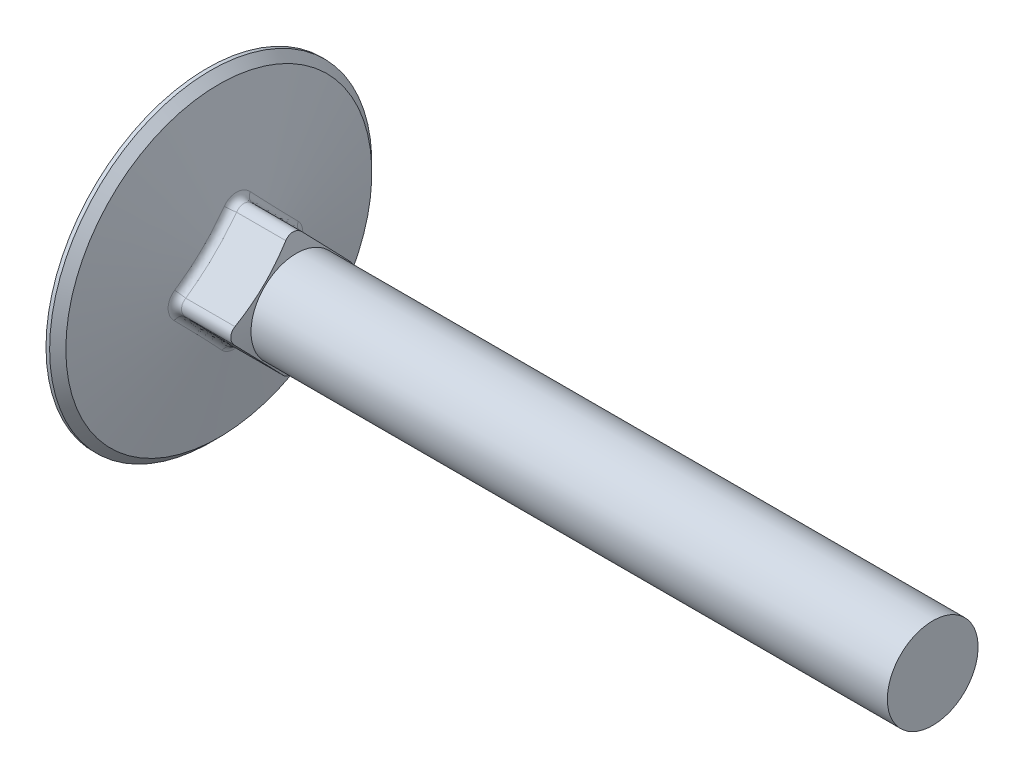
ISO-10303-21;
HEADER;
FILE_DESCRIPTION(('STEP AP214'),'2;1');
FILE_NAME('part.step','',(''),(''),'','','');
FILE_SCHEMA(('AUTOMOTIVE_DESIGN { 1 0 10303 214 1 1 1 1 }'));
ENDSEC;
DATA;
#1=APPLICATION_CONTEXT('core data for automotive mechanical design processes');
#2=APPLICATION_PROTOCOL_DEFINITION('international standard','automotive_design',2000,#1);
#3=PRODUCT_CONTEXT('',#1,'mechanical');
#4=PRODUCT('Part','Part','',(#3));
#5=PRODUCT_RELATED_PRODUCT_CATEGORY('part','',(#4));
#6=PRODUCT_DEFINITION_FORMATION('','',#4);
#7=PRODUCT_DEFINITION_CONTEXT('part definition',#1,'design');
#8=PRODUCT_DEFINITION('design','',#6,#7);
#9=PRODUCT_DEFINITION_SHAPE('','',#8);
#10=(LENGTH_UNIT() NAMED_UNIT(*) SI_UNIT(.MILLI.,.METRE.));
#11=(NAMED_UNIT(*) PLANE_ANGLE_UNIT() SI_UNIT($,.RADIAN.));
#12=(NAMED_UNIT(*) SI_UNIT($,.STERADIAN.) SOLID_ANGLE_UNIT());
#13=UNCERTAINTY_MEASURE_WITH_UNIT(LENGTH_MEASURE(1.E-05),#10,'distance_accuracy_value','');
#14=(GEOMETRIC_REPRESENTATION_CONTEXT(3) GLOBAL_UNCERTAINTY_ASSIGNED_CONTEXT((#13)) GLOBAL_UNIT_ASSIGNED_CONTEXT((#10,
#11,#12)) REPRESENTATION_CONTEXT('',''));
#15=CARTESIAN_POINT('',(0.,0.,0.));
#16=DIRECTION('',(0.,0.,1.));
#17=DIRECTION('',(1.,0.,0.));
#18=AXIS2_PLACEMENT_3D('',#15,#16,#17);
#19=CARTESIAN_POINT('',(9.3726,5.243670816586,-0.0915286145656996));
#20=DIRECTION('',(-1.,0.,0.));
#21=DIRECTION('',(0.,0.,1.));
#22=AXIS2_PLACEMENT_3D('',#19,#20,#21);
#23=CYLINDRICAL_SURFACE('',#22,1.1938);
#24=DIRECTION('',(-1.,0.,0.));
#25=VECTOR('',#24,1.);
#26=CARTESIAN_POINT('',(9.3726,6.07295397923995,-0.950276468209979));
#27=LINE('',#26,#25);
#28=CARTESIAN_POINT('',(9.00166387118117,6.07295397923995,-0.950276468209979));
#29=VERTEX_POINT('',#28);
#30=CARTESIAN_POINT('',(3.8367498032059,6.07295397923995,-0.950276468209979));
#31=VERTEX_POINT('',#30);
#32=EDGE_CURVE('E138',#29,#31,#27,.T.);
#33=ORIENTED_EDGE('',*,*,#32,.T.);
#34=CARTESIAN_POINT('',(3.14842317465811,5.98515884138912,1.64060891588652));
#35=CARTESIAN_POINT('',(3.23579340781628,5.68907704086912,1.02050014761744));
#36=CARTESIAN_POINT('',(3.9213564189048,5.7777751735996,0.976128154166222));
#37=CARTESIAN_POINT('',(3.13225878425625,6.08462851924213,1.59242887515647));
#38=CARTESIAN_POINT('',(3.22351509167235,5.75566724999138,0.993537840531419));
#39=CARTESIAN_POINT('',(3.90519202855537,5.83799349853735,0.946071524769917));
#40=CARTESIAN_POINT('',(3.11705833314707,6.17990989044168,1.53566783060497));
#41=CARTESIAN_POINT('',(3.21181574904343,5.82014632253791,0.96025192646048));
#42=CARTESIAN_POINT('',(3.88999157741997,5.895684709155,0.910782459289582));
#43=CARTESIAN_POINT('',(3.08879086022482,6.35947602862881,1.40692391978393));
#44=CARTESIAN_POINT('',(3.18991995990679,5.9422355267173,0.882518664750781));
#45=CARTESIAN_POINT('',(3.86172410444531,6.00441866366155,0.830929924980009));
#46=CARTESIAN_POINT('',(3.07572284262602,6.44376592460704,1.33494819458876));
#47=CARTESIAN_POINT('',(3.17970650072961,5.99993272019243,0.838096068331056));
#48=CARTESIAN_POINT('',(3.84865608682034,6.05546450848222,0.786370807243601));
#49=CARTESIAN_POINT('',(3.05209182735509,6.59764489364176,1.17886555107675));
#50=CARTESIAN_POINT('',(3.1611574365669,6.10562199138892,0.740113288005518));
#51=CARTESIAN_POINT('',(3.82502507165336,6.14865685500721,0.689879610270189));
#52=CARTESIAN_POINT('',(3.04149367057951,6.66743853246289,1.09496034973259));
#53=CARTESIAN_POINT('',(3.15278217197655,6.15382132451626,0.686702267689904));
#54=CARTESIAN_POINT('',(3.81442691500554,6.19092718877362,0.638070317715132));
#55=CARTESIAN_POINT('',(3.0226976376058,6.79186343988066,0.916606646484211));
#56=CARTESIAN_POINT('',(3.13788633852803,6.23994437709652,0.572024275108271));
#57=CARTESIAN_POINT('',(3.79563088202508,6.26628421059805,0.528037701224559));
#58=CARTESIAN_POINT('',(3.01449896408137,6.84649974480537,0.822161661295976));
#59=CARTESIAN_POINT('',(3.13135371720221,6.2779363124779,0.510737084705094));
#60=CARTESIAN_POINT('',(3.78743220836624,6.29937394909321,0.469816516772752));
#61=CARTESIAN_POINT('',(3.00060746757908,6.93902598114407,0.625331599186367));
#62=CARTESIAN_POINT('',(3.12026797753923,6.34236670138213,0.382236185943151));
#63=CARTESIAN_POINT('',(3.77354071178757,6.35540715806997,0.348545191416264));
#64=CARTESIAN_POINT('',(2.99491579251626,6.97690824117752,0.522942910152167));
#65=CARTESIAN_POINT('',(3.11570708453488,6.36885042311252,0.314980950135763));
#66=CARTESIAN_POINT('',(3.76784903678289,6.37834598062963,0.285492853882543));
#67=CARTESIAN_POINT('',(2.98612159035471,7.03474620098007,0.313215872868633));
#68=CARTESIAN_POINT('',(3.10865702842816,6.40932454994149,0.176779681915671));
#69=CARTESIAN_POINT('',(3.75905483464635,6.41336057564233,0.156378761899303));
#70=CARTESIAN_POINT('',(2.98301898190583,7.05470246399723,0.205877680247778));
#71=CARTESIAN_POINT('',(3.10616221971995,6.42334818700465,0.105783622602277));
#72=CARTESIAN_POINT('',(3.75595222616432,6.42543668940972,0.0903171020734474));
#73=CARTESIAN_POINT('',(2.97945399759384,7.07602848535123,-0.010097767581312));
#74=CARTESIAN_POINT('',(3.10329736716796,6.43838758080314,-0.0371978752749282));
#75=CARTESIAN_POINT('',(3.75238724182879,6.43832526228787,-0.0425923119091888));
#76=CARTESIAN_POINT('',(2.97897868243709,7.07748937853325,-0.118726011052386));
#77=CARTESIAN_POINT('',(3.10291465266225,6.43947995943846,-0.109232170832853));
#78=CARTESIAN_POINT('',(3.75191192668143,6.43919295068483,-0.109434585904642));
#79=CARTESIAN_POINT('',(2.9806394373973,7.06201724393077,-0.334672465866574));
#80=CARTESIAN_POINT('',(3.10424972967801,6.4288037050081,-0.252273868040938));
#81=CARTESIAN_POINT('',(3.75357268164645,6.42978126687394,-0.242323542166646));
#82=CARTESIAN_POINT('',(2.98277580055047,7.04508215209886,-0.441990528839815));
#83=CARTESIAN_POINT('',(3.10596881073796,6.41702618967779,-0.323337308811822));
#84=CARTESIAN_POINT('',(3.75570904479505,6.41950064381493,-0.308370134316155));
#85=CARTESIAN_POINT('',(2.98962805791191,6.99334919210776,-0.652051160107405));
#86=CARTESIAN_POINT('',(3.11146827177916,6.38105588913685,-0.461999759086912));
#87=CARTESIAN_POINT('',(3.76256130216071,6.38811491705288,-0.437681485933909));
#88=CARTESIAN_POINT('',(2.99433974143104,6.95858048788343,-0.754800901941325));
#89=CARTESIAN_POINT('',(3.11524960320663,6.35685624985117,-0.529655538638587));
#90=CARTESIAN_POINT('',(3.7672729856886,6.36702748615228,-0.50095060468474));
#91=CARTESIAN_POINT('',(3.00626297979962,6.87232668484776,-0.952845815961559));
#92=CARTESIAN_POINT('',(3.12478323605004,6.29697481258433,-0.659363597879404));
#93=CARTESIAN_POINT('',(3.77919622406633,6.31472433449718,-0.622956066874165));
#94=CARTESIAN_POINT('',(3.01347234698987,6.82085621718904,-1.04814742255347));
#95=CARTESIAN_POINT('',(3.13054118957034,6.26125837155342,-0.72146178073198));
#96=CARTESIAN_POINT('',(3.78640559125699,6.28351747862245,-0.681696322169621));
#97=CARTESIAN_POINT('',(3.03359867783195,6.6794949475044,-1.26402165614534));
#98=CARTESIAN_POINT('',(3.14654704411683,6.16347814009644,-0.861032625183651));
#99=CARTESIAN_POINT('',(3.80653192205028,6.19781992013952,-0.81485180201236));
#100=CARTESIAN_POINT('',(3.04764493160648,6.58244662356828,-1.38002105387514));
#101=CARTESIAN_POINT('',(3.15768302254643,6.0964979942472,-0.935063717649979));
#102=CARTESIAN_POINT('',(3.8205781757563,6.13899370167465,-0.886486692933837));
#103=CARTESIAN_POINT('',(3.07571043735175,6.39333643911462,-1.55896777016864));
#104=CARTESIAN_POINT('',(3.17969644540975,5.96708776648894,-1.0469518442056));
#105=CARTESIAN_POINT('',(3.84864368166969,6.02438320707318,-0.997192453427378));
#106=CARTESIAN_POINT('',(3.08875399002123,6.30674619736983,-1.6278318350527));
#107=CARTESIAN_POINT('',(3.1898909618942,5.90798417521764,-1.08925528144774));
#108=CARTESIAN_POINT('',(3.86168723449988,5.97191044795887,-1.03986479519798));
#109=CARTESIAN_POINT('',(3.11700926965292,6.12286532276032,-1.75021371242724));
#110=CARTESIAN_POINT('',(3.21177812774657,5.78330001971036,-1.16267083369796));
#111=CARTESIAN_POINT('',(3.88994251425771,5.86049765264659,-1.11586324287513));
#112=CARTESIAN_POINT('',(3.13222843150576,6.02553826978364,-1.80367692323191));
#113=CARTESIAN_POINT('',(3.2234921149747,5.7176149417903,-1.19372020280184));
#114=CARTESIAN_POINT('',(3.90516167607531,5.80153560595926,-1.14915608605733));
#115=CARTESIAN_POINT('',(3.14842317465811,5.92425641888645,-1.84848853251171));
#116=CARTESIAN_POINT('',(3.23579340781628,5.64999646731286,-1.21842441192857));
#117=CARTESIAN_POINT('',(3.9213564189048,5.74018912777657,-1.17717496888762));
#118=(BOUNDED_SURFACE() B_SPLINE_SURFACE(3,2,((#34,#35,#36),(#37,#38,#39),(#40,#41,#42),(#43,
#44,#45),(#46,#47,#48),(#49,#50,#51),(#52,#53,#54),(#55,#56,#57),(#58,#59,#60),(#61,#62,#63),
(#64,#65,#66),(#67,#68,#69),(#70,#71,#72),(#73,#74,#75),(#76,#77,#78),(#79,#80,#81),(#82,#83,
#84),(#85,#86,#87),(#88,#89,#90),(#91,#92,#93),(#94,#95,#96),(#97,#98,#99),(#100,#101,#102),
(#103,#104,#105),(#106,#107,#108),(#109,#110,#111),(#112,#113,#114),(#115,#116,#117)),
.UNSPECIFIED.,.F.,.F.,.F.) B_SPLINE_SURFACE_WITH_KNOTS((4,2,2,2,2,2,2,2,2,2,2,2,2,4),(3,3),(0.,
0.338160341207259,0.67616231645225,1.00901029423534,1.34174754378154,1.67463699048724,
2.00751597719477,2.33875408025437,2.6700293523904,3.00076459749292,3.33121088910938,
3.79008253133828,4.12757259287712,4.46624485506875),(0.,1.),
.UNSPECIFIED.) GEOMETRIC_REPRESENTATION_ITEM() RATIONAL_B_SPLINE_SURFACE(((1.,0.750813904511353,
1.),(1.,0.752924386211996,1.),(1.,0.754871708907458,1.),(1.,0.758442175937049,1.),(1.,
0.760065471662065,1.),(1.,0.76296968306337,1.),(1.,0.764255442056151,1.),(1.,0.766517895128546,
1.),(1.,0.767494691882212,1.),(1.,0.769141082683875,1.),(1.,0.769810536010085,1.),(1.,
0.770842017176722,1.),(1.,0.771204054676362,1.),(1.,0.771619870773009,1.),(1.,0.771675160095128,
1.),(1.,0.771481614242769,1.),(1.,0.771232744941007,1.),(1.,0.770431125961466,1.),(1.,
0.769878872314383,1.),(1.,0.768472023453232,1.),(1.,0.767617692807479,1.),(1.,0.765210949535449,
1.),(1.,0.763516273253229,1.),(1.,0.76006694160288,1.),(1.,0.758446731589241,1.),(1.,
0.754878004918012,1.),(1.,0.752928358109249,1.),(1.,0.750813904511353,1.))) REPRESENTATION_ITEM('') SURFACE());
#119=CARTESIAN_POINT('',(3.9213564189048,5.74018912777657,-1.17717496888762));
#120=CARTESIAN_POINT('',(3.90516167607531,5.80153560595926,-1.14915608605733));
#121=CARTESIAN_POINT('',(3.88994251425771,5.86049765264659,-1.11586324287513));
#122=CARTESIAN_POINT('',(3.86168723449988,5.97191044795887,-1.03986479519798));
#123=CARTESIAN_POINT('',(3.84864368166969,6.02438320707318,-0.997192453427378));
#124=CARTESIAN_POINT('',(3.8205781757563,6.13899370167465,-0.886486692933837));
#125=CARTESIAN_POINT('',(3.80653192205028,6.19781992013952,-0.81485180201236));
#126=CARTESIAN_POINT('',(3.78640559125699,6.28351747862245,-0.681696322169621));
#127=CARTESIAN_POINT('',(3.77919622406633,6.31472433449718,-0.622956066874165));
#128=CARTESIAN_POINT('',(3.7672729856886,6.36702748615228,-0.50095060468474));
#129=CARTESIAN_POINT('',(3.76256130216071,6.38811491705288,-0.437681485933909));
#130=CARTESIAN_POINT('',(3.75570904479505,6.41950064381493,-0.308370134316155));
#131=CARTESIAN_POINT('',(3.75357268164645,6.42978126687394,-0.242323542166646));
#132=CARTESIAN_POINT('',(3.75191192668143,6.43919295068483,-0.109434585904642));
#133=CARTESIAN_POINT('',(3.75238724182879,6.43832526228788,-0.0425923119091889));
#134=CARTESIAN_POINT('',(3.75595222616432,6.42543668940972,0.0903171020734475));
#135=CARTESIAN_POINT('',(3.75905483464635,6.41336057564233,0.156378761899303));
#136=CARTESIAN_POINT('',(3.76784903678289,6.37834598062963,0.285492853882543));
#137=CARTESIAN_POINT('',(3.77354071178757,6.35540715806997,0.348545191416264));
#138=CARTESIAN_POINT('',(3.78743220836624,6.29937394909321,0.469816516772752));
#139=CARTESIAN_POINT('',(3.79563088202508,6.26628421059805,0.528037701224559));
#140=CARTESIAN_POINT('',(3.81442691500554,6.19092718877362,0.638070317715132));
#141=CARTESIAN_POINT('',(3.82502507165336,6.14865685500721,0.689879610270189));
#142=CARTESIAN_POINT('',(3.84865608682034,6.05546450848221,0.786370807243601));
#143=CARTESIAN_POINT('',(3.86172410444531,6.00441866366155,0.830929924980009));
#144=CARTESIAN_POINT('',(3.88999157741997,5.895684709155,0.910782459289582));
#145=CARTESIAN_POINT('',(3.90519202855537,5.83799349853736,0.946071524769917));
#146=CARTESIAN_POINT('',(3.9213564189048,5.7777751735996,0.976128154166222));
#147=B_SPLINE_CURVE_WITH_KNOTS('',3,(#119,#120,#121,#122,#123,#124,#125,#126,#127,#128,#129,
#130,#131,#132,#133,#134,#135,#136,#137,#138,#139,#140,#141,#142,#143,#144,#145,#146),
.UNSPECIFIED.,.F.,.F.,(4,2,2,2,2,2,2,2,2,2,2,2,2,4),(0.,0.338672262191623,0.676162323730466,
1.13503396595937,1.46548025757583,1.79621550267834,2.12749077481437,2.45872887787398,
2.79160786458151,3.12449731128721,3.4572345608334,3.7900825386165,4.12808451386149,
4.46624485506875),.UNSPECIFIED.);
#148=CARTESIAN_POINT('',(3.8367498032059,6.10241867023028,0.737754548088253));
#149=VERTEX_POINT('',#148);
#150=EDGE_CURVE('E11',#31,#149,#147,.T.);
#151=ORIENTED_EDGE('',*,*,#150,.T.);
#152=DIRECTION('',(-1.,0.,0.));
#153=VECTOR('',#152,1.);
#154=CARTESIAN_POINT('',(9.3726,6.10241867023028,0.737754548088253));
#155=LINE('',#154,#153);
#156=CARTESIAN_POINT('',(9.00166387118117,6.10241867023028,0.737754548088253));
#157=VERTEX_POINT('',#156);
#158=EDGE_CURVE('E139',#157,#149,#155,.T.);
#159=ORIENTED_EDGE('',*,*,#158,.F.);
#160=CARTESIAN_POINT('',(9.00171042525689,6.07274682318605,-0.950476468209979));
#161=CARTESIAN_POINT('',(8.996384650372,6.09644535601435,-0.927601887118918));
#162=CARTESIAN_POINT('',(8.99130101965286,6.11921424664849,-0.903729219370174));
#163=CARTESIAN_POINT('',(8.98163772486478,6.16274564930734,-0.854122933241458));
#164=CARTESIAN_POINT('',(8.97705808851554,6.18350805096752,-0.828389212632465));
#165=CARTESIAN_POINT('',(8.9641149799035,6.24251801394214,-0.748661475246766));
#166=CARTESIAN_POINT('',(8.9565355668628,6.27754084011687,-0.692090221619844));
#167=CARTESIAN_POINT('',(8.94363835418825,6.33779758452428,-0.57367815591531));
#168=CARTESIAN_POINT('',(8.93832276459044,6.36302193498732,-0.511832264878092));
#169=CARTESIAN_POINT('',(8.93006795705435,6.40283438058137,-0.384670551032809));
#170=CARTESIAN_POINT('',(8.92712778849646,6.41742673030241,-0.319356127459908));
#171=CARTESIAN_POINT('',(8.92370288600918,6.43539796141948,-0.187929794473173));
#172=CARTESIAN_POINT('',(8.92318957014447,6.43890720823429,-0.121836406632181));
#173=CARTESIAN_POINT('',(8.92455089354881,6.43497169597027,0.0100084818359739));
#174=CARTESIAN_POINT('',(8.92642580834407,6.42752567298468,0.0757599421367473));
#175=CARTESIAN_POINT('',(8.93250970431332,6.40199352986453,0.204689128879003));
#176=CARTESIAN_POINT('',(8.93670657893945,6.3839625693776,0.267878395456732));
#177=CARTESIAN_POINT('',(8.9473440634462,6.33787691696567,0.39028557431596));
#178=CARTESIAN_POINT('',(8.95378417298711,6.30982446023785,0.449504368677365));
#179=CARTESIAN_POINT('',(8.9668859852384,6.25282193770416,0.548120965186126));
#180=CARTESIAN_POINT('',(8.97308385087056,6.22587527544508,0.588755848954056));
#181=CARTESIAN_POINT('',(8.98658428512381,6.16738446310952,0.666279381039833));
#182=CARTESIAN_POINT('',(8.99388531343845,6.13584672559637,0.703173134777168));
#183=CARTESIAN_POINT('',(9.00170882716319,6.10222548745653,0.737954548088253));
#184=B_SPLINE_CURVE_WITH_KNOTS('',3,(#160,#161,#162,#163,#164,#165,#166,#167,#168,#169,#170,
#171,#172,#173,#174,#175,#176,#177,#178,#179,#180,#181,#182,#183),.UNSPECIFIED.,.F.,.F.,(4,2,2,
2,2,2,2,2,2,2,2,4),(0.,0.100036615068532,0.200078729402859,0.399944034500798,0.600004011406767,
0.799983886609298,0.997602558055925,1.19524403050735,1.39186459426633,1.58844133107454,
1.73553615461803,1.88242746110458),.UNSPECIFIED.);
#185=EDGE_CURVE('E131',#29,#157,#184,.T.);
#186=ORIENTED_EDGE('',*,*,#185,.F.);
#187=EDGE_LOOP('',(#33,#151,#159,#186));
#188=FACE_BOUND('',#187,.T.);
#189=ADVANCED_FACE('F35',(#188),#23,.T.);
#190=CARTESIAN_POINT('',(9.3726,6.10241867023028,0.737754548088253));
#191=DIRECTION('',(0.,-0.71933980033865,-0.694658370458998));
#192=DIRECTION('',(0.,0.694658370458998,-0.71933980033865));
#193=AXIS2_PLACEMENT_3D('',#190,#191,#192);
#194=PLANE('',#193);
#195=ORIENTED_EDGE('',*,*,#158,.T.);
#196=CARTESIAN_POINT('',(2.06339952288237,-3.1575326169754,11.3571432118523));
#197=CARTESIAN_POINT('',(2.12782915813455,-3.68008118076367,10.8678296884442));
#198=CARTESIAN_POINT('',(2.83633276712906,-3.76418517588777,10.9549219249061));
#199=CARTESIAN_POINT('',(2.11154747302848,-2.96341608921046,11.1539902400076));
#200=CARTESIAN_POINT('',(2.17716072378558,-3.48515868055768,10.665981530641));
#201=CARTESIAN_POINT('',(2.88448071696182,-3.56843908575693,10.7522209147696));
#202=CARTESIAN_POINT('',(2.15927873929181,-2.76935723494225,10.9507836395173));
#203=CARTESIAN_POINT('',(2.22617220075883,-3.29009478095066,10.4639869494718));
#204=CARTESIAN_POINT('',(2.93221198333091,-3.37264369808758,10.5494688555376));
#205=CARTESIAN_POINT('',(2.25369925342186,-2.38137813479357,10.544256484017));
#206=CARTESIAN_POINT('',(2.32329178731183,-2.89993147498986,10.0599610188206));
#207=CARTESIAN_POINT('',(3.02663249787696,-2.98092950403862,10.1438369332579));
#208=CARTESIAN_POINT('',(2.30038848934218,-2.18745789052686,10.3409359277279));
#209=CARTESIAN_POINT('',(2.37139184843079,-2.70487136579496,9.857970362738));
#210=CARTESIAN_POINT('',(3.07332173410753,-2.78501069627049,9.94095706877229));
#211=CARTESIAN_POINT('',(2.4385861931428,-1.60591436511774,9.73076640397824));
#212=CARTESIAN_POINT('',(2.5138982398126,-2.12024144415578,9.25256835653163));
#213=CARTESIAN_POINT('',(3.21151943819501,-2.19700600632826,9.33206038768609));
#214=CARTESIAN_POINT('',(2.52821657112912,-1.21854061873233,9.32374340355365));
#215=CARTESIAN_POINT('',(2.60675571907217,-1.73027472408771,8.84874599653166));
#216=CARTESIAN_POINT('',(3.3011498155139,-1.80470444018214,8.92582022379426));
#217=CARTESIAN_POINT('',(2.69979633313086,-0.444801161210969,8.50940925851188));
#218=CARTESIAN_POINT('',(2.78547138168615,-0.950195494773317,8.04095030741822));
#219=CARTESIAN_POINT('',(3.47272957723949,-1.01935959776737,8.1125718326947));
#220=CARTESIAN_POINT('',(2.78174713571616,-0.0584352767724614,8.10209818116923));
#221=CARTESIAN_POINT('',(2.87127674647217,-0.5604768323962,7.6373848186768));
#222=CARTESIAN_POINT('',(3.55468038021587,-0.626316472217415,7.70556376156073));
#223=CARTESIAN_POINT('',(2.93359096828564,0.713168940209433,7.28746647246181));
#224=CARTESIAN_POINT('',(3.03134925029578,0.219187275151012,6.8300190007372));
#225=CARTESIAN_POINT('',(3.70652421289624,0.161006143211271,6.89026732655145));
#226=CARTESIAN_POINT('',(3.00348181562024,1.09840705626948,6.88014585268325));
#227=CARTESIAN_POINT('',(3.10561588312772,0.608801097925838,6.42656207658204));
#228=CARTESIAN_POINT('',(3.77641505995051,0.555285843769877,6.48197874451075));
#229=CARTESIAN_POINT('',(3.09650287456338,1.69155646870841,6.25316810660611));
#230=CARTESIAN_POINT('',(3.20523912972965,1.20999906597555,5.80400335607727));
#231=CARTESIAN_POINT('',(3.86943611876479,1.16426243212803,5.85136502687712));
#232=CARTESIAN_POINT('',(3.12638454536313,1.89983035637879,6.03304878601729));
#233=CARTESIAN_POINT('',(3.23736686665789,1.42090203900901,5.58560693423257));
#234=CARTESIAN_POINT('',(3.899317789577,1.37845704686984,5.62956001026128));
#235=CARTESIAN_POINT('',(3.17911485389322,2.31627564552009,5.59348426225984));
#236=CARTESIAN_POINT('',(3.29423411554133,1.84246896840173,5.1490615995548));
#237=CARTESIAN_POINT('',(3.95204809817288,1.80727001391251,5.18551118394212));
#238=CARTESIAN_POINT('',(3.20196354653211,2.52444704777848,5.37403905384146));
#239=CARTESIAN_POINT('',(3.31900932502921,2.05322674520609,4.93081553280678));
#240=CARTESIAN_POINT('',(3.97489679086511,2.02188836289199,4.96326737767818));
#241=CARTESIAN_POINT('',(3.23923869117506,2.94090042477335,4.93620375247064));
#242=CARTESIAN_POINT('',(3.35950071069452,2.47433195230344,4.49474832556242));
#243=CARTESIAN_POINT('',(4.01217193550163,2.45137694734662,4.51851892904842));
#244=CARTESIAN_POINT('',(3.25366938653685,3.14918229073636,4.71781318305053));
#245=CARTESIAN_POINT('',(3.37526139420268,2.68486503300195,4.27673493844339));
#246=CARTESIAN_POINT('',(4.02660263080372,2.66624700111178,4.29601447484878));
#247=CARTESIAN_POINT('',(3.27304707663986,3.56637278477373,4.28211094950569));
#248=CARTESIAN_POINT('',(3.39641957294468,3.10558515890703,3.8410664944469));
#249=CARTESIAN_POINT('',(4.04598032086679,3.09619389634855,3.85079143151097));
#250=CARTESIAN_POINT('',(3.27799429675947,3.77528139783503,4.06479925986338));
#251=CARTESIAN_POINT('',(3.40184507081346,3.31604273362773,3.62313129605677));
#252=CARTESIAN_POINT('',(4.05092754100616,3.31127073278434,3.62807284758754));
#253=CARTESIAN_POINT('',(3.27799429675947,4.19407851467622,3.63112215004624));
#254=CARTESIAN_POINT('',(3.40184507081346,3.73665240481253,3.18757723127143));
#255=CARTESIAN_POINT('',(4.05092754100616,3.74142440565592,3.18263567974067));
#256=CARTESIAN_POINT('',(3.27304707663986,4.4039670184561,3.41475672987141));
#257=CARTESIAN_POINT('',(3.39641957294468,3.94710997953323,2.9696420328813));
#258=CARTESIAN_POINT('',(4.04598032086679,3.95650124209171,2.95991709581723));
#259=CARTESIAN_POINT('',(3.25366938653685,4.82484409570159,2.98261458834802));
#260=CARTESIAN_POINT('',(3.37526139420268,4.36783010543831,2.53397358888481));
#261=CARTESIAN_POINT('',(4.02660263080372,4.38644813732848,2.51469405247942));
#262=CARTESIAN_POINT('',(3.23923869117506,5.03583269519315,2.76683788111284));
#263=CARTESIAN_POINT('',(3.35950071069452,4.57836318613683,2.31596020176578));
#264=CARTESIAN_POINT('',(4.01217193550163,4.60131819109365,2.29218959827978));
#265=CARTESIAN_POINT('',(3.20196354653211,5.45886726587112,2.33535796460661));
#266=CARTESIAN_POINT('',(3.31900932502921,4.99946839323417,1.87989299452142));
#267=CARTESIAN_POINT('',(3.97489679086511,5.03080677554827,1.84744114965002));
#268=CARTESIAN_POINT('',(3.17911485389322,5.67091371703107,2.1196548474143));
#269=CARTESIAN_POINT('',(3.29423411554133,5.21022617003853,1.6616469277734));
#270=CARTESIAN_POINT('',(3.95204809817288,5.24542512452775,1.62519734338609));
#271=CARTESIAN_POINT('',(3.12638454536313,6.09567673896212,1.68812266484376));
#272=CARTESIAN_POINT('',(3.23736686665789,5.63179309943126,1.22510159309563));
#273=CARTESIAN_POINT('',(3.899317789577,5.67423809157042,1.18114851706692));
#274=CARTESIAN_POINT('',(3.09650287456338,6.30839331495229,1.47229359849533));
#275=CARTESIAN_POINT('',(3.20523912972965,5.84269607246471,1.00670517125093));
#276=CARTESIAN_POINT('',(3.86943611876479,5.88843270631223,0.959343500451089));
#277=CARTESIAN_POINT('',(3.00348181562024,6.91428850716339,0.85762430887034));
#278=CARTESIAN_POINT('',(3.10561588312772,6.44389404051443,0.384146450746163));
#279=CARTESIAN_POINT('',(3.77641505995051,6.49740929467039,0.328729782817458));
#280=CARTESIAN_POINT('',(2.93359096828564,7.3079163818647,0.458405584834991));
#281=CARTESIAN_POINT('',(3.03134925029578,6.83350786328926,-0.0193104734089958));
#282=CARTESIAN_POINT('',(3.70652421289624,6.89168899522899,-0.0795587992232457));
#283=CARTESIAN_POINT('',(2.78174713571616,8.09512324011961,-0.341158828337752));
#284=CARTESIAN_POINT('',(2.87127674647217,7.61317197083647,-0.826676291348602));
#285=CARTESIAN_POINT('',(3.55468038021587,7.67901161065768,-0.894855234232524));
#286=CARTESIAN_POINT('',(2.69979633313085,8.48870221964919,-0.741504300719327));
#287=CARTESIAN_POINT('',(2.78547138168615,8.00289063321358,-1.23024178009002));
#288=CARTESIAN_POINT('',(3.47272957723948,8.07205473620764,-1.3018633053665));
#289=CARTESIAN_POINT('',(2.52821657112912,9.27553717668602,-1.54319226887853));
#290=CARTESIAN_POINT('',(2.60675571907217,8.78296986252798,-2.03803746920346));
#291=CARTESIAN_POINT('',(3.3011498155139,8.85739957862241,-2.11511169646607));
#292=CARTESIAN_POINT('',(2.4385861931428,9.66879308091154,-1.94453493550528));
#293=CARTESIAN_POINT('',(2.5138982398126,9.17293658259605,-2.44185982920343));
#294=CARTESIAN_POINT('',(3.211519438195,9.24970114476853,-2.52135186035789));
#295=CARTESIAN_POINT('',(2.30038848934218,10.2582953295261,-2.54701880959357));
#296=CARTESIAN_POINT('',(2.37139184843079,9.75756650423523,-3.0472618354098));
#297=CARTESIAN_POINT('',(3.07332173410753,9.83770583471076,-3.13024854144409));
#298=CARTESIAN_POINT('',(2.25369925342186,10.4547243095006,-2.74791670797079));
#299=CARTESIAN_POINT('',(2.32329178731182,9.95262661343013,-3.24925249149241));
#300=CARTESIAN_POINT('',(3.02663249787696,10.0336246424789,-3.33312840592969));
#301=CARTESIAN_POINT('',(2.1592787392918,10.8474635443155,-3.14984705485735));
#302=CARTESIAN_POINT('',(2.22617220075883,10.3427899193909,-3.65327842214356));
#303=CARTESIAN_POINT('',(2.93221198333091,10.4253388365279,-3.73876032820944));
#304=CARTESIAN_POINT('',(2.11154747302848,11.0437738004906,-3.35087950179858));
#305=CARTESIAN_POINT('',(2.17716072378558,10.5378538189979,-3.85527300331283));
#306=CARTESIAN_POINT('',(2.88448071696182,10.6211342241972,-3.94151238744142));
#307=CARTESIAN_POINT('',(2.06339952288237,11.2400284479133,-3.55196771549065));
#308=CARTESIAN_POINT('',(2.12782915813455,10.7327763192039,-4.05712116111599));
#309=CARTESIAN_POINT('',(2.83633276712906,10.816880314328,-4.14421339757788));
#310=(BOUNDED_SURFACE() B_SPLINE_SURFACE(3,2,((#196,#197,#198),(#199,#200,#201),(#202,#203,
#204),(#205,#206,#207),(#208,#209,#210),(#211,#212,#213),(#214,#215,#216),(#217,#218,#219),
(#220,#221,#222),(#223,#224,#225),(#226,#227,#228),(#229,#230,#231),(#232,#233,#234),(#235,#236,
#237),(#238,#239,#240),(#241,#242,#243),(#244,#245,#246),(#247,#248,#249),(#250,#251,#252),
(#253,#254,#255),(#256,#257,#258),(#259,#260,#261),(#262,#263,#264),(#265,#266,#267),(#268,#269,
#270),(#271,#272,#273),(#274,#275,#276),(#277,#278,#279),(#280,#281,#282),(#283,#284,#285),
(#286,#287,#288),(#289,#290,#291),(#292,#293,#294),(#295,#296,#297),(#298,#299,#300),(#301,#302,
#303),(#304,#305,#306),(#307,#308,#309)),.UNSPECIFIED.,.F.,.F.,
.F.) B_SPLINE_SURFACE_WITH_KNOTS((4,2,2,2,2,2,2,2,2,2,2,2,2,2,2,2,2,2,4),(3,3),(0.,
0.857613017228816,1.71523586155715,3.43062433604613,5.14569531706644,6.8610763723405,
7.7903831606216,8.71968269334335,9.64851337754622,10.5773219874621,11.5061305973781,
12.4349612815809,13.3642608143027,14.2935676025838,16.0089486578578,17.7240196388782,
19.4394081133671,20.2970309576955,21.1546439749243),(0.,1.),
.UNSPECIFIED.) GEOMETRIC_REPRESENTATION_ITEM() RATIONAL_B_SPLINE_SURFACE(((1.,0.738558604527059,
1.),(1.,0.739197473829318,1.),(1.,0.739869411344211,1.),(1.,0.741287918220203,1.),(1.,
0.742034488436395,1.),(1.,0.74439899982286,1.),(1.,0.746141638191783,1.),(1.,0.750004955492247,
1.),(1.,0.75212556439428,1.),(1.,0.756689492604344,1.),(1.,0.759132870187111,1.),(1.,
0.762826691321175,1.),(1.,0.76411070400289,1.),(1.,0.766509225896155,1.),(1.,0.767623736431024,
1.),(1.,0.769513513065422,1.),(1.,0.770288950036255,1.),(1.,0.771344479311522,1.),(1.,
0.771624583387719,1.),(1.,0.771624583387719,1.),(1.,0.771344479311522,1.),(1.,0.770288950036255,
1.),(1.,0.769513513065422,1.),(1.,0.767623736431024,1.),(1.,0.766509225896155,1.),(1.,
0.76411070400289,1.),(1.,0.762826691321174,1.),(1.,0.759132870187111,1.),(1.,0.756689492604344,
1.),(1.,0.75212556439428,1.),(1.,0.750004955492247,1.),(1.,0.746141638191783,1.),(1.,
0.74439899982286,1.),(1.,0.742034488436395,1.),(1.,0.741287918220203,1.),(1.,0.739869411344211,
1.),(1.,0.739197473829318,1.),(1.,0.738558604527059,1.))) REPRESENTATION_ITEM('') SURFACE());
#311=CARTESIAN_POINT('',(2.83633276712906,10.816880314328,-4.14421339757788));
#312=CARTESIAN_POINT('',(2.88448071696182,10.6211342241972,-3.94151238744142));
#313=CARTESIAN_POINT('',(2.93221198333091,10.4253388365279,-3.73876032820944));
#314=CARTESIAN_POINT('',(3.02663249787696,10.0336246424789,-3.33312840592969));
#315=CARTESIAN_POINT('',(3.07332173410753,9.83770583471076,-3.13024854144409));
#316=CARTESIAN_POINT('',(3.211519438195,9.24970114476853,-2.52135186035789));
#317=CARTESIAN_POINT('',(3.3011498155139,8.85739957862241,-2.11511169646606));
#318=CARTESIAN_POINT('',(3.47272957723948,8.07205473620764,-1.3018633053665));
#319=CARTESIAN_POINT('',(3.55468038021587,7.67901161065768,-0.894855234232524));
#320=CARTESIAN_POINT('',(3.70652421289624,6.89168899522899,-0.079558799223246));
#321=CARTESIAN_POINT('',(3.77641505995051,6.49740929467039,0.328729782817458));
#322=CARTESIAN_POINT('',(3.86943611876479,5.88843270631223,0.959343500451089));
#323=CARTESIAN_POINT('',(3.899317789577,5.67423809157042,1.18114851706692));
#324=CARTESIAN_POINT('',(3.95204809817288,5.24542512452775,1.62519734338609));
#325=CARTESIAN_POINT('',(3.97489679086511,5.03080677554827,1.84744114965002));
#326=CARTESIAN_POINT('',(4.01217193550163,4.60131819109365,2.29218959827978));
#327=CARTESIAN_POINT('',(4.02660263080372,4.38644813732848,2.51469405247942));
#328=CARTESIAN_POINT('',(4.04598032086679,3.95650124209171,2.95991709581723));
#329=CARTESIAN_POINT('',(4.05092754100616,3.74142440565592,3.18263567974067));
#330=CARTESIAN_POINT('',(4.05092754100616,3.31127073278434,3.62807284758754));
#331=CARTESIAN_POINT('',(4.04598032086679,3.09619389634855,3.85079143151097));
#332=CARTESIAN_POINT('',(4.02660263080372,2.66624700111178,4.29601447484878));
#333=CARTESIAN_POINT('',(4.01217193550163,2.45137694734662,4.51851892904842));
#334=CARTESIAN_POINT('',(3.97489679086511,2.02188836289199,4.96326737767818));
#335=CARTESIAN_POINT('',(3.95204809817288,1.80727001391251,5.18551118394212));
#336=CARTESIAN_POINT('',(3.899317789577,1.37845704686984,5.62956001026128));
#337=CARTESIAN_POINT('',(3.86943611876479,1.16426243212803,5.85136502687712));
#338=CARTESIAN_POINT('',(3.77641505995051,0.555285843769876,6.48197874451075));
#339=CARTESIAN_POINT('',(3.70652421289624,0.161006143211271,6.89026732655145));
#340=CARTESIAN_POINT('',(3.55468038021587,-0.626316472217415,7.70556376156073));
#341=CARTESIAN_POINT('',(3.47272957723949,-1.01935959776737,8.1125718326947));
#342=CARTESIAN_POINT('',(3.3011498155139,-1.80470444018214,8.92582022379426));
#343=CARTESIAN_POINT('',(3.21151943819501,-2.19700600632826,9.33206038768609));
#344=CARTESIAN_POINT('',(3.07332173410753,-2.78501069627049,9.94095706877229));
#345=CARTESIAN_POINT('',(3.02663249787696,-2.98092950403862,10.1438369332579));
#346=CARTESIAN_POINT('',(2.93221198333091,-3.37264369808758,10.5494688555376));
#347=CARTESIAN_POINT('',(2.88448071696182,-3.56843908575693,10.7522209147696));
#348=CARTESIAN_POINT('',(2.83633276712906,-3.76418517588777,10.9549219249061));
#349=B_SPLINE_CURVE_WITH_KNOTS('',3,(#311,#312,#313,#314,#315,#316,#317,#318,#319,#320,#321,
#322,#323,#324,#325,#326,#327,#328,#329,#330,#331,#332,#333,#334,#335,#336,#337,#338,#339,#340,
#341,#342,#343,#344,#345,#346,#347,#348),.UNSPECIFIED.,.F.,.F.,(4,2,2,2,2,2,2,2,2,2,2,2,2,2,2,2,
2,2,4),(0.,0.857613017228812,1.71523586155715,3.43062433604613,5.14569531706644,6.8610763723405,
7.79038316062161,8.71968269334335,9.64851337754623,10.5773219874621,11.5061305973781,
12.4349612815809,13.3642608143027,14.2935676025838,16.0089486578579,17.7240196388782,
19.4394081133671,20.2970309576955,21.1546439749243),.UNSPECIFIED.);
#350=CARTESIAN_POINT('',(3.8367498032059,0.950276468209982,6.07295397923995));
#351=VERTEX_POINT('',#350);
#352=EDGE_CURVE('E419',#149,#351,#349,.T.);
#353=ORIENTED_EDGE('',*,*,#352,.T.);
#354=DIRECTION('',(-1.,0.,0.));
#355=VECTOR('',#354,1.);
#356=CARTESIAN_POINT('',(9.3726,0.950276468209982,6.07295397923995));
#357=LINE('',#356,#355);
#358=CARTESIAN_POINT('',(9.00166387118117,0.950276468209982,6.07295397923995));
#359=VERTEX_POINT('',#358);
#360=EDGE_CURVE('E165',#359,#351,#357,.T.);
#361=ORIENTED_EDGE('',*,*,#360,.F.);
#362=CARTESIAN_POINT('',(7.07950791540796,12.130090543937,-5.50408239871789));
#363=CARTESIAN_POINT('',(7.16815027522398,11.8828913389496,-5.24810012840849));
#364=CARTESIAN_POINT('',(7.25633669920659,11.6356123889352,-4.99203527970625));
#365=CARTESIAN_POINT('',(7.43147234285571,11.1408377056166,-4.47968109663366));
#366=CARTESIAN_POINT('',(7.51842153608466,10.8933419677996,-4.2233917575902));
#367=CARTESIAN_POINT('',(7.69079439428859,10.397969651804,-3.71041870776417));
#368=CARTESIAN_POINT('',(7.77621731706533,10.1500929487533,-3.45373486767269));
#369=CARTESIAN_POINT('',(7.94500722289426,9.65400342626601,-2.94001912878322));
#370=CARTESIAN_POINT('',(8.02837422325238,9.40579060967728,-2.68298723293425));
#371=CARTESIAN_POINT('',(8.1939409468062,8.9041771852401,-2.16355132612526));
#372=CARTESIAN_POINT('',(8.27608786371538,8.65076813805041,-1.90113857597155));
#373=CARTESIAN_POINT('',(8.43649968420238,8.14334749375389,-1.37568911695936));
#374=CARTESIAN_POINT('',(8.51476448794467,7.88933588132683,-1.11265239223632));
#375=CARTESIAN_POINT('',(8.6658868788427,7.38047979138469,-0.585716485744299));
#376=CARTESIAN_POINT('',(8.73874338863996,7.1256351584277,-0.321817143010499));
#377=CARTESIAN_POINT('',(8.87676871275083,6.61493798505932,0.207025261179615));
#378=CARTESIAN_POINT('',(8.94193789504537,6.35908549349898,0.471968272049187));
#379=CARTESIAN_POINT('',(9.04390320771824,5.92089902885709,0.925723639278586));
#380=CARTESIAN_POINT('',(9.08343255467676,5.73887442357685,1.11421563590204));
#381=CARTESIAN_POINT('',(9.15547148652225,5.37416031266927,1.49188815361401));
#382=CARTESIAN_POINT('',(9.18798162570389,5.19147086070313,1.68106861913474));
#383=CARTESIAN_POINT('',(9.24429903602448,4.82558255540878,2.05995705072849));
#384=CARTESIAN_POINT('',(9.26811331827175,4.64238423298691,2.24966446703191));
#385=CARTESIAN_POINT('',(9.30548907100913,4.27548111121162,2.62960377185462));
#386=CARTESIAN_POINT('',(9.3190511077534,4.09177634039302,2.81983563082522));
#387=CARTESIAN_POINT('',(9.33478993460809,3.72530736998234,3.19932535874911));
#388=CARTESIAN_POINT('',(9.33703935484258,3.54254471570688,3.38858162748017));
#389=CARTESIAN_POINT('',(9.3301567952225,3.17711899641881,3.76699103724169));
#390=CARTESIAN_POINT('',(9.32102440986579,2.99445593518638,3.95614417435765));
#391=CARTESIAN_POINT('',(9.29212722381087,2.62949018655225,4.33407727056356));
#392=CARTESIAN_POINT('',(9.27235908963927,2.44718763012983,4.52285709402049));
#393=CARTESIAN_POINT('',(9.22360169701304,2.08318090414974,4.89979709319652));
#394=CARTESIAN_POINT('',(9.19461207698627,1.9014767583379,5.08795724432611));
#395=CARTESIAN_POINT('',(9.15021032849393,1.65581470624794,5.34234774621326));
#396=CARTESIAN_POINT('',(9.13811207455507,1.59155757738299,5.40888795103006));
#397=CARTESIAN_POINT('',(9.11303551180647,1.46313833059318,5.54186997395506));
#398=CARTESIAN_POINT('',(9.10005737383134,1.39897619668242,5.60831180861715));
#399=CARTESIAN_POINT('',(9.07326968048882,1.27064709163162,5.74120048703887));
#400=CARTESIAN_POINT('',(9.05945902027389,1.20648023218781,5.80764721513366));
#401=CARTESIAN_POINT('',(9.0310864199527,1.07822389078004,5.94046054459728));
#402=CARTESIAN_POINT('',(9.01652444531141,1.01413441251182,6.00682714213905));
#403=CARTESIAN_POINT('',(8.95982584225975,0.770492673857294,6.25912554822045));
#404=CARTESIAN_POINT('',(8.91533191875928,0.591203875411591,6.44478453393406));
#405=CARTESIAN_POINT('',(8.82212718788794,0.2331536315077,6.81555641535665));
#406=CARTESIAN_POINT('',(8.77341617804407,0.0543922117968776,7.00066928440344));
#407=CARTESIAN_POINT('',(8.67268928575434,-0.302722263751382,7.37047214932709));
#408=CARTESIAN_POINT('',(8.62067263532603,-0.481075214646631,7.55516203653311));
#409=CARTESIAN_POINT('',(8.51405398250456,-0.837408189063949,7.9241556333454));
#410=CARTESIAN_POINT('',(8.45945195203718,-1.01538820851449,8.10845933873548));
#411=CARTESIAN_POINT('',(8.34861731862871,-1.36971454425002,8.47537500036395));
#412=CARTESIAN_POINT('',(8.29239988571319,-1.54606315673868,8.65798933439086));
#413=CARTESIAN_POINT('',(8.17835206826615,-1.89850939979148,9.02295810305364));
#414=CARTESIAN_POINT('',(8.12052167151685,-2.07460702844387,9.20531253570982));
#415=CARTESIAN_POINT('',(8.00359806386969,-2.42648029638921,9.56968797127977));
#416=CARTESIAN_POINT('',(7.94450568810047,-2.60225606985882,9.75170911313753));
#417=CARTESIAN_POINT('',(7.82525114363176,-2.95362867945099,10.1155661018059));
#418=CARTESIAN_POINT('',(7.76508899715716,-3.12922551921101,10.2974019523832));
#419=CARTESIAN_POINT('',(7.70450519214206,-3.30475139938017,10.4791643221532));
#420=B_SPLINE_CURVE_WITH_KNOTS('',3,(#362,#363,#364,#365,#366,#367,#368,#369,#370,#371,#372,
#373,#374,#375,#376,#377,#378,#379,#380,#381,#382,#383,#384,#385,#386,#387,#388,#389,#390,#391,
#392,#393,#394,#395,#396,#397,#398,#399,#400,#401,#402,#403,#404,#405,#406,#407,#408,#409,#410,
#411,#412,#413,#414,#415,#416,#417,#418,#419),.UNSPECIFIED.,.F.,.F.,(4,2,2,2,2,2,2,2,2,2,2,2,2,
2,2,2,2,2,2,2,2,2,2,2,2,2,2,2,4),(0.,1.10019535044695,2.20041417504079,3.30115420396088,
4.40188496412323,5.52366450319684,6.64547287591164,7.76750412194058,8.88948163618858,
9.68440783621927,10.4792712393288,11.2734923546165,12.0676696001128,12.8567414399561,
13.6458413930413,14.4351888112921,15.224567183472,15.5044338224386,15.7842462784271,
16.0644386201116,16.3446438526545,17.1303018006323,17.9159974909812,18.7018763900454,
19.4877638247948,20.2677990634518,21.0478402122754,21.8273802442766,22.6069040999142),.UNSPECIFIED.);
#421=EDGE_CURVE('E140',#157,#359,#420,.T.);
#422=ORIENTED_EDGE('',*,*,#421,.F.);
#423=EDGE_LOOP('',(#195,#353,#361,#422));
#424=FACE_BOUND('',#423,.T.);
#425=ADVANCED_FACE('F221',(#424),#194,.F.);
#426=CARTESIAN_POINT('',(9.3726,0.0915286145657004,5.243670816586));
#427=DIRECTION('',(-1.,0.,0.));
#428=DIRECTION('',(0.,0.,1.));
#429=AXIS2_PLACEMENT_3D('',#426,#427,#428);
#430=CYLINDRICAL_SURFACE('',#429,1.1938);
#431=ORIENTED_EDGE('',*,*,#360,.T.);
#432=CARTESIAN_POINT('',(3.14842317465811,-1.64060891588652,5.98515884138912));
#433=CARTESIAN_POINT('',(3.23579340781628,-1.02050014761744,5.68907704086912));
#434=CARTESIAN_POINT('',(3.9213564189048,-0.976128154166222,5.7777751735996));
#435=CARTESIAN_POINT('',(3.13225878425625,-1.59242887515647,6.08462851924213));
#436=CARTESIAN_POINT('',(3.22351509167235,-0.99353784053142,5.75566724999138));
#437=CARTESIAN_POINT('',(3.90519202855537,-0.946071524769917,5.83799349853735));
#438=CARTESIAN_POINT('',(3.11705833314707,-1.53566783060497,6.17990989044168));
#439=CARTESIAN_POINT('',(3.21181574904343,-0.960251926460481,5.82014632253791));
#440=CARTESIAN_POINT('',(3.88999157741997,-0.910782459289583,5.895684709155));
#441=CARTESIAN_POINT('',(3.08879086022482,-1.40692391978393,6.35947602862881));
#442=CARTESIAN_POINT('',(3.18991995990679,-0.882518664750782,5.9422355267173));
#443=CARTESIAN_POINT('',(3.86172410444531,-0.830929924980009,6.00441866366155));
#444=CARTESIAN_POINT('',(3.07572284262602,-1.33494819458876,6.44376592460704));
#445=CARTESIAN_POINT('',(3.17970650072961,-0.838096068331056,5.99993272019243));
#446=CARTESIAN_POINT('',(3.84865608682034,-0.786370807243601,6.05546450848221));
#447=CARTESIAN_POINT('',(3.05209182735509,-1.17886555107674,6.59764489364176));
#448=CARTESIAN_POINT('',(3.1611574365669,-0.740113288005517,6.10562199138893));
#449=CARTESIAN_POINT('',(3.82502507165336,-0.689879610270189,6.14865685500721));
#450=CARTESIAN_POINT('',(3.04149367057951,-1.09496034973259,6.66743853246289));
#451=CARTESIAN_POINT('',(3.15278217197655,-0.686702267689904,6.15382132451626));
#452=CARTESIAN_POINT('',(3.81442691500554,-0.638070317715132,6.19092718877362));
#453=CARTESIAN_POINT('',(3.0226976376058,-0.91660664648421,6.79186343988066));
#454=CARTESIAN_POINT('',(3.13788633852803,-0.57202427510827,6.23994437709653));
#455=CARTESIAN_POINT('',(3.79563088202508,-0.528037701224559,6.26628421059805));
#456=CARTESIAN_POINT('',(3.01449896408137,-0.822161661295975,6.84649974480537));
#457=CARTESIAN_POINT('',(3.13135371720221,-0.510737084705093,6.2779363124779));
#458=CARTESIAN_POINT('',(3.78743220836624,-0.469816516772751,6.29937394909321));
#459=CARTESIAN_POINT('',(3.00060746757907,-0.625331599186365,6.93902598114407));
#460=CARTESIAN_POINT('',(3.12026797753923,-0.382236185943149,6.34236670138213));
#461=CARTESIAN_POINT('',(3.77354071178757,-0.348545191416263,6.35540715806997));
#462=CARTESIAN_POINT('',(2.99491579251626,-0.522942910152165,6.97690824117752));
#463=CARTESIAN_POINT('',(3.11570708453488,-0.314980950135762,6.36885042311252));
#464=CARTESIAN_POINT('',(3.76784903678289,-0.285492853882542,6.37834598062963));
#465=CARTESIAN_POINT('',(2.98612159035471,-0.31321587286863,7.03474620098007));
#466=CARTESIAN_POINT('',(3.10865702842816,-0.176779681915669,6.40932454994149));
#467=CARTESIAN_POINT('',(3.75905483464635,-0.156378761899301,6.41336057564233));
#468=CARTESIAN_POINT('',(2.98301898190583,-0.205877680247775,7.05470246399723));
#469=CARTESIAN_POINT('',(3.10616221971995,-0.105783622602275,6.42334818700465));
#470=CARTESIAN_POINT('',(3.75595222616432,-0.0903171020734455,6.42543668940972));
#471=CARTESIAN_POINT('',(2.97945399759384,0.0100977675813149,7.07602848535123));
#472=CARTESIAN_POINT('',(3.10329736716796,0.0371978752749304,6.43838758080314));
#473=CARTESIAN_POINT('',(3.75238724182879,0.042592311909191,6.43832526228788));
#474=CARTESIAN_POINT('',(2.97897868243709,0.11872601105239,7.07748937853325));
#475=CARTESIAN_POINT('',(3.10291465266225,0.109232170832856,6.43947995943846));
#476=CARTESIAN_POINT('',(3.75191192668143,0.109434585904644,6.43919295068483));
#477=CARTESIAN_POINT('',(2.9806394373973,0.334672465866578,7.06201724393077));
#478=CARTESIAN_POINT('',(3.10424972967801,0.252273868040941,6.4288037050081));
#479=CARTESIAN_POINT('',(3.75357268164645,0.242323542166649,6.42978126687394));
#480=CARTESIAN_POINT('',(2.98277580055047,0.441990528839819,7.04508215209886));
#481=CARTESIAN_POINT('',(3.10596881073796,0.323337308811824,6.41702618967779));
#482=CARTESIAN_POINT('',(3.75570904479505,0.308370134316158,6.41950064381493));
#483=CARTESIAN_POINT('',(2.98962805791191,0.652051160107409,6.99334919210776));
#484=CARTESIAN_POINT('',(3.11146827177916,0.461999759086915,6.38105588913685));
#485=CARTESIAN_POINT('',(3.76256130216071,0.437681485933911,6.38811491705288));
#486=CARTESIAN_POINT('',(2.99433974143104,0.754800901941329,6.95858048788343));
#487=CARTESIAN_POINT('',(3.11524960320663,0.52965553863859,6.35685624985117));
#488=CARTESIAN_POINT('',(3.7672729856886,0.500950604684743,6.36702748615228));
#489=CARTESIAN_POINT('',(3.00626297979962,0.952845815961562,6.87232668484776));
#490=CARTESIAN_POINT('',(3.12478323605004,0.659363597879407,6.29697481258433));
#491=CARTESIAN_POINT('',(3.77919622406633,0.622956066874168,6.31472433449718));
#492=CARTESIAN_POINT('',(3.01347234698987,1.04814742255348,6.82085621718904));
#493=CARTESIAN_POINT('',(3.13054118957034,0.721461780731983,6.26125837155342));
#494=CARTESIAN_POINT('',(3.78640559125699,0.681696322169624,6.28351747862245));
#495=CARTESIAN_POINT('',(3.03359867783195,1.26402165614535,6.6794949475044));
#496=CARTESIAN_POINT('',(3.14654704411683,0.861032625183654,6.16347814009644));
#497=CARTESIAN_POINT('',(3.80653192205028,0.814851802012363,6.19781992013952));
#498=CARTESIAN_POINT('',(3.04764493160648,1.38002105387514,6.58244662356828));
#499=CARTESIAN_POINT('',(3.15768302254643,0.93506371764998,6.0964979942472));
#500=CARTESIAN_POINT('',(3.8205781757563,0.886486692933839,6.13899370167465));
#501=CARTESIAN_POINT('',(3.07571043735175,1.55896777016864,6.39333643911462));
#502=CARTESIAN_POINT('',(3.17969644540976,1.0469518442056,5.96708776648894));
#503=CARTESIAN_POINT('',(3.84864368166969,0.99719245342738,6.02438320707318));
#504=CARTESIAN_POINT('',(3.08875399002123,1.6278318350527,6.30674619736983));
#505=CARTESIAN_POINT('',(3.1898909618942,1.08925528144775,5.90798417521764));
#506=CARTESIAN_POINT('',(3.86168723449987,1.03986479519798,5.97191044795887));
#507=CARTESIAN_POINT('',(3.11700926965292,1.75021371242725,6.12286532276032));
#508=CARTESIAN_POINT('',(3.21177812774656,1.16267083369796,5.78330001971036));
#509=CARTESIAN_POINT('',(3.88994251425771,1.11586324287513,5.86049765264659));
#510=CARTESIAN_POINT('',(3.13222843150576,1.80367692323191,6.02553826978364));
#511=CARTESIAN_POINT('',(3.2234921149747,1.19372020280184,5.7176149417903));
#512=CARTESIAN_POINT('',(3.90516167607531,1.14915608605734,5.80153560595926));
#513=CARTESIAN_POINT('',(3.14842317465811,1.84848853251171,5.92425641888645));
#514=CARTESIAN_POINT('',(3.23579340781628,1.21842441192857,5.64999646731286));
#515=CARTESIAN_POINT('',(3.9213564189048,1.17717496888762,5.74018912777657));
#516=(BOUNDED_SURFACE() B_SPLINE_SURFACE(3,2,((#432,#433,#434),(#435,#436,#437),(#438,#439,
#440),(#441,#442,#443),(#444,#445,#446),(#447,#448,#449),(#450,#451,#452),(#453,#454,#455),
(#456,#457,#458),(#459,#460,#461),(#462,#463,#464),(#465,#466,#467),(#468,#469,#470),(#471,#472,
#473),(#474,#475,#476),(#477,#478,#479),(#480,#481,#482),(#483,#484,#485),(#486,#487,#488),
(#489,#490,#491),(#492,#493,#494),(#495,#496,#497),(#498,#499,#500),(#501,#502,#503),(#504,#505,
#506),(#507,#508,#509),(#510,#511,#512),(#513,#514,#515)),.UNSPECIFIED.,.F.,.F.,
.F.) B_SPLINE_SURFACE_WITH_KNOTS((4,2,2,2,2,2,2,2,2,2,2,2,2,4),(3,3),(0.,0.338160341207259,
0.676162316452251,1.00901029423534,1.34174754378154,1.67463699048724,2.00751597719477,
2.33875408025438,2.67002935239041,3.00076459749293,3.33121088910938,3.79008253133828,
4.12757259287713,4.46624485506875),(0.,1.),
.UNSPECIFIED.) GEOMETRIC_REPRESENTATION_ITEM() RATIONAL_B_SPLINE_SURFACE(((1.,0.750813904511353,
1.),(1.,0.752924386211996,1.),(1.,0.754871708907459,1.),(1.,0.758442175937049,1.),(1.,
0.760065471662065,1.),(1.,0.762969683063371,1.),(1.,0.764255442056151,1.),(1.,0.766517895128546,
1.),(1.,0.767494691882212,1.),(1.,0.769141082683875,1.),(1.,0.769810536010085,1.),(1.,
0.770842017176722,1.),(1.,0.771204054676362,1.),(1.,0.771619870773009,1.),(1.,0.771675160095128,
1.),(1.,0.771481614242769,1.),(1.,0.771232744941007,1.),(1.,0.770431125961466,1.),(1.,
0.769878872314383,1.),(1.,0.768472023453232,1.),(1.,0.767617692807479,1.),(1.,0.765210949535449,
1.),(1.,0.763516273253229,1.),(1.,0.76006694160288,1.),(1.,0.758446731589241,1.),(1.,
0.754878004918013,1.),(1.,0.752928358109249,1.),(1.,0.750813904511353,1.))) REPRESENTATION_ITEM('') SURFACE());
#517=CARTESIAN_POINT('',(3.9213564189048,1.17717496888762,5.74018912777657));
#518=CARTESIAN_POINT('',(3.90516167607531,1.14915608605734,5.80153560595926));
#519=CARTESIAN_POINT('',(3.88994251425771,1.11586324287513,5.86049765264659));
#520=CARTESIAN_POINT('',(3.86168723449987,1.03986479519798,5.97191044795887));
#521=CARTESIAN_POINT('',(3.84864368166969,0.99719245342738,6.02438320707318));
#522=CARTESIAN_POINT('',(3.8205781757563,0.886486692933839,6.13899370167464));
#523=CARTESIAN_POINT('',(3.80653192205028,0.814851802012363,6.19781992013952));
#524=CARTESIAN_POINT('',(3.78640559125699,0.681696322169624,6.28351747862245));
#525=CARTESIAN_POINT('',(3.77919622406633,0.622956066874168,6.31472433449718));
#526=CARTESIAN_POINT('',(3.7672729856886,0.500950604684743,6.36702748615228));
#527=CARTESIAN_POINT('',(3.76256130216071,0.437681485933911,6.38811491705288));
#528=CARTESIAN_POINT('',(3.75570904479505,0.308370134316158,6.41950064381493));
#529=CARTESIAN_POINT('',(3.75357268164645,0.242323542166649,6.42978126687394));
#530=CARTESIAN_POINT('',(3.75191192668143,0.109434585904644,6.43919295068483));
#531=CARTESIAN_POINT('',(3.75238724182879,0.0425923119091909,6.43832526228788));
#532=CARTESIAN_POINT('',(3.75595222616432,-0.0903171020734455,6.42543668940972));
#533=CARTESIAN_POINT('',(3.75905483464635,-0.156378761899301,6.41336057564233));
#534=CARTESIAN_POINT('',(3.76784903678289,-0.285492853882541,6.37834598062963));
#535=CARTESIAN_POINT('',(3.77354071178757,-0.348545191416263,6.35540715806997));
#536=CARTESIAN_POINT('',(3.78743220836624,-0.469816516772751,6.29937394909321));
#537=CARTESIAN_POINT('',(3.79563088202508,-0.528037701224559,6.26628421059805));
#538=CARTESIAN_POINT('',(3.81442691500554,-0.638070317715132,6.19092718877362));
#539=CARTESIAN_POINT('',(3.82502507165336,-0.689879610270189,6.14865685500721));
#540=CARTESIAN_POINT('',(3.84865608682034,-0.786370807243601,6.05546450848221));
#541=CARTESIAN_POINT('',(3.86172410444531,-0.830929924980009,6.00441866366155));
#542=CARTESIAN_POINT('',(3.88999157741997,-0.910782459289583,5.895684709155));
#543=CARTESIAN_POINT('',(3.90519202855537,-0.946071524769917,5.83799349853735));
#544=CARTESIAN_POINT('',(3.9213564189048,-0.976128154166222,5.7777751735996));
#545=B_SPLINE_CURVE_WITH_KNOTS('',3,(#517,#518,#519,#520,#521,#522,#523,#524,#525,#526,#527,
#528,#529,#530,#531,#532,#533,#534,#535,#536,#537,#538,#539,#540,#541,#542,#543,#544),
.UNSPECIFIED.,.F.,.F.,(4,2,2,2,2,2,2,2,2,2,2,2,2,4),(0.,0.338672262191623,0.676162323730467,
1.13503396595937,1.46548025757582,1.79621550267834,2.12749077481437,2.45872887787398,
2.79160786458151,3.12449731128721,3.45723456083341,3.7900825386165,4.12808451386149,
4.46624485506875),.UNSPECIFIED.);
#546=CARTESIAN_POINT('',(3.8367498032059,-0.737754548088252,6.10241867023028));
#547=VERTEX_POINT('',#546);
#548=EDGE_CURVE('E423',#351,#547,#545,.T.);
#549=ORIENTED_EDGE('',*,*,#548,.T.);
#550=DIRECTION('',(-1.,0.,0.));
#551=VECTOR('',#550,1.);
#552=CARTESIAN_POINT('',(9.3726,-0.737754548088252,6.10241867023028));
#553=LINE('',#552,#551);
#554=CARTESIAN_POINT('',(9.00166387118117,-0.737754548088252,6.10241867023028));
#555=VERTEX_POINT('',#554);
#556=EDGE_CURVE('E162',#555,#547,#553,.T.);
#557=ORIENTED_EDGE('',*,*,#556,.F.);
#558=CARTESIAN_POINT('',(9.00170881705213,0.950469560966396,6.07275397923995));
#559=CARTESIAN_POINT('',(8.99638309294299,0.927594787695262,6.09645231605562));
#560=CARTESIAN_POINT('',(8.99129951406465,0.90372193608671,6.11922100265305));
#561=CARTESIAN_POINT('',(8.98163632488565,0.854115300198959,6.1627519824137));
#562=CARTESIAN_POINT('',(8.97705674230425,0.828381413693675,6.1835141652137));
#563=CARTESIAN_POINT('',(8.96411379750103,0.748653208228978,6.24252345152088));
#564=CARTESIAN_POINT('',(8.95653449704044,0.692081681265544,6.27754579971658));
#565=CARTESIAN_POINT('',(8.94363751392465,0.57366915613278,6.33780154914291));
#566=CARTESIAN_POINT('',(8.93832204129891,0.511823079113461,6.36302538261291));
#567=CARTESIAN_POINT('',(8.93006746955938,0.384661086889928,6.40283677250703));
#568=CARTESIAN_POINT('',(8.92712741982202,0.319346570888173,6.41742858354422));
#569=CARTESIAN_POINT('',(8.92370275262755,0.187920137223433,6.43539874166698));
#570=CARTESIAN_POINT('',(8.92318955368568,0.121826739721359,6.43890745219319));
#571=CARTESIAN_POINT('',(8.92455110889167,-0.0100180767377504,6.43497087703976));
#572=CARTESIAN_POINT('',(8.92642613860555,-0.0757694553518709,6.42752432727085));
#573=CARTESIAN_POINT('',(8.93251026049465,-0.204698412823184,6.40199115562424));
#574=CARTESIAN_POINT('',(8.93670724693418,-0.267887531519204,6.38395968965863));
#575=CARTESIAN_POINT('',(8.94734495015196,-0.390294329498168,6.33787306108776));
#576=CARTESIAN_POINT('',(8.95378516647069,-0.449512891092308,6.30982013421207));
#577=CARTESIAN_POINT('',(8.96688697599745,-0.548127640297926,6.25281762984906));
#578=CARTESIAN_POINT('',(8.97308469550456,-0.58876102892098,6.22587160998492));
#579=CARTESIAN_POINT('',(8.98658476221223,-0.666281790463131,6.16738240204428));
#580=CARTESIAN_POINT('',(8.9938855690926,-0.703174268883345,6.13584562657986));
#581=CARTESIAN_POINT('',(9.00170882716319,-0.737954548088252,6.10222548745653));
#582=B_SPLINE_CURVE_WITH_KNOTS('',3,(#558,#559,#560,#561,#562,#563,#564,#565,#566,#567,#568,
#569,#570,#571,#572,#573,#574,#575,#576,#577,#578,#579,#580,#581),.UNSPECIFIED.,.F.,.F.,(4,2,2,
2,2,2,2,2,2,2,2,4),(0.,0.100036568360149,0.200078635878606,0.399943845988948,0.600003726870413,
0.799983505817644,0.997602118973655,1.19524353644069,1.39186411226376,1.58844085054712,
1.73553089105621,1.88241740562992),.UNSPECIFIED.);
#583=EDGE_CURVE('E404',#359,#555,#582,.T.);
#584=ORIENTED_EDGE('',*,*,#583,.F.);
#585=EDGE_LOOP('',(#431,#549,#557,#584));
#586=FACE_BOUND('',#585,.T.);
#587=ADVANCED_FACE('F321',(#586),#430,.T.);
#588=CARTESIAN_POINT('',(9.3726,-6.07295397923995,0.950276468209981));
#589=DIRECTION('',(0.,0.694658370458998,-0.71933980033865));
#590=DIRECTION('',(0.,0.71933980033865,0.694658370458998));
#591=AXIS2_PLACEMENT_3D('',#588,#589,#590);
#592=PLANE('',#591);
#593=ORIENTED_EDGE('',*,*,#556,.T.);
#594=CARTESIAN_POINT('',(2.06339952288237,-11.3571432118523,-3.1575326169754));
#595=CARTESIAN_POINT('',(2.12782915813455,-10.8678296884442,-3.68008118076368));
#596=CARTESIAN_POINT('',(2.83633276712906,-10.9549219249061,-3.76418517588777));
#597=CARTESIAN_POINT('',(2.11154747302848,-11.1539902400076,-2.96341608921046));
#598=CARTESIAN_POINT('',(2.17716072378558,-10.665981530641,-3.48515868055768));
#599=CARTESIAN_POINT('',(2.88448071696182,-10.7522209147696,-3.56843908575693));
#600=CARTESIAN_POINT('',(2.15927873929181,-10.9507836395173,-2.76935723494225));
#601=CARTESIAN_POINT('',(2.22617220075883,-10.4639869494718,-3.29009478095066));
#602=CARTESIAN_POINT('',(2.93221198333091,-10.5494688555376,-3.37264369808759));
#603=CARTESIAN_POINT('',(2.25369925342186,-10.544256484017,-2.38137813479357));
#604=CARTESIAN_POINT('',(2.32329178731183,-10.0599610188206,-2.89993147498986));
#605=CARTESIAN_POINT('',(3.02663249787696,-10.1438369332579,-2.98092950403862));
#606=CARTESIAN_POINT('',(2.30038848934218,-10.3409359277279,-2.18745789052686));
#607=CARTESIAN_POINT('',(2.37139184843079,-9.857970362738,-2.70487136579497));
#608=CARTESIAN_POINT('',(3.07332173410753,-9.94095706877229,-2.78501069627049));
#609=CARTESIAN_POINT('',(2.4385861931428,-9.73076640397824,-1.60591436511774));
#610=CARTESIAN_POINT('',(2.5138982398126,-9.25256835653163,-2.12024144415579));
#611=CARTESIAN_POINT('',(3.21151943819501,-9.33206038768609,-2.19700600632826));
#612=CARTESIAN_POINT('',(2.52821657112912,-9.32374340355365,-1.21854061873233));
#613=CARTESIAN_POINT('',(2.60675571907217,-8.84874599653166,-1.73027472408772));
#614=CARTESIAN_POINT('',(3.3011498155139,-8.92582022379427,-1.80470444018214));
#615=CARTESIAN_POINT('',(2.69979633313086,-8.50940925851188,-0.44480116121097));
#616=CARTESIAN_POINT('',(2.78547138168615,-8.04095030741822,-0.950195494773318));
#617=CARTESIAN_POINT('',(3.47272957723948,-8.1125718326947,-1.01935959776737));
#618=CARTESIAN_POINT('',(2.78174713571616,-8.10209818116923,-0.0584352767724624));
#619=CARTESIAN_POINT('',(2.87127674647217,-7.6373848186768,-0.560476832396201));
#620=CARTESIAN_POINT('',(3.55468038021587,-7.70556376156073,-0.626316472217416));
#621=CARTESIAN_POINT('',(2.93359096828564,-7.2874664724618,0.713168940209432));
#622=CARTESIAN_POINT('',(3.03134925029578,-6.8300190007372,0.219187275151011));
#623=CARTESIAN_POINT('',(3.70652421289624,-6.89026732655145,0.16100614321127));
#624=CARTESIAN_POINT('',(3.00348181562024,-6.88014585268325,1.09840705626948));
#625=CARTESIAN_POINT('',(3.10561588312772,-6.42656207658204,0.608801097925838));
#626=CARTESIAN_POINT('',(3.77641505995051,-6.48197874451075,0.555285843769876));
#627=CARTESIAN_POINT('',(3.09650287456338,-6.25316810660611,1.69155646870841));
#628=CARTESIAN_POINT('',(3.20523912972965,-5.80400335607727,1.20999906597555));
#629=CARTESIAN_POINT('',(3.86943611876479,-5.85136502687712,1.16426243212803));
#630=CARTESIAN_POINT('',(3.12638454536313,-6.03304878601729,1.89983035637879));
#631=CARTESIAN_POINT('',(3.23736686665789,-5.58560693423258,1.42090203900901));
#632=CARTESIAN_POINT('',(3.899317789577,-5.62956001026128,1.37845704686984));
#633=CARTESIAN_POINT('',(3.17911485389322,-5.59348426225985,2.31627564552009));
#634=CARTESIAN_POINT('',(3.29423411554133,-5.1490615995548,1.84246896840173));
#635=CARTESIAN_POINT('',(3.95204809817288,-5.18551118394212,1.80727001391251));
#636=CARTESIAN_POINT('',(3.20196354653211,-5.37403905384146,2.52444704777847));
#637=CARTESIAN_POINT('',(3.31900932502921,-4.93081553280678,2.05322674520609));
#638=CARTESIAN_POINT('',(3.97489679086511,-4.96326737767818,2.02188836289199));
#639=CARTESIAN_POINT('',(3.23923869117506,-4.93620375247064,2.94090042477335));
#640=CARTESIAN_POINT('',(3.35950071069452,-4.49474832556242,2.47433195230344));
#641=CARTESIAN_POINT('',(4.01217193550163,-4.51851892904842,2.45137694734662));
#642=CARTESIAN_POINT('',(3.25366938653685,-4.71781318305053,3.14918229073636));
#643=CARTESIAN_POINT('',(3.37526139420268,-4.2767349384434,2.68486503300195));
#644=CARTESIAN_POINT('',(4.02660263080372,-4.29601447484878,2.66624700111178));
#645=CARTESIAN_POINT('',(3.27304707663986,-4.28211094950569,3.56637278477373));
#646=CARTESIAN_POINT('',(3.39641957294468,-3.8410664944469,3.10558515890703));
#647=CARTESIAN_POINT('',(4.04598032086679,-3.85079143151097,3.09619389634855));
#648=CARTESIAN_POINT('',(3.27799429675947,-4.06479925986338,3.77528139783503));
#649=CARTESIAN_POINT('',(3.40184507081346,-3.62313129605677,3.31604273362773));
#650=CARTESIAN_POINT('',(4.05092754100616,-3.62807284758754,3.31127073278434));
#651=CARTESIAN_POINT('',(3.27799429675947,-3.63112215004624,4.19407851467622));
#652=CARTESIAN_POINT('',(3.40184507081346,-3.18757723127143,3.73665240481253));
#653=CARTESIAN_POINT('',(4.05092754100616,-3.18263567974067,3.74142440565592));
#654=CARTESIAN_POINT('',(3.27304707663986,-3.41475672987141,4.4039670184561));
#655=CARTESIAN_POINT('',(3.39641957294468,-2.9696420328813,3.94710997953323));
#656=CARTESIAN_POINT('',(4.04598032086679,-2.95991709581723,3.95650124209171));
#657=CARTESIAN_POINT('',(3.25366938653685,-2.98261458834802,4.82484409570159));
#658=CARTESIAN_POINT('',(3.37526139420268,-2.53397358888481,4.36783010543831));
#659=CARTESIAN_POINT('',(4.02660263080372,-2.51469405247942,4.38644813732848));
#660=CARTESIAN_POINT('',(3.23923869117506,-2.76683788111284,5.03583269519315));
#661=CARTESIAN_POINT('',(3.35950071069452,-2.31596020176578,4.57836318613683));
#662=CARTESIAN_POINT('',(4.01217193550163,-2.29218959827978,4.60131819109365));
#663=CARTESIAN_POINT('',(3.20196354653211,-2.33535796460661,5.45886726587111));
#664=CARTESIAN_POINT('',(3.31900932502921,-1.87989299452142,4.99946839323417));
#665=CARTESIAN_POINT('',(3.97489679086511,-1.84744114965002,5.03080677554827));
#666=CARTESIAN_POINT('',(3.17911485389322,-2.1196548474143,5.67091371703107));
#667=CARTESIAN_POINT('',(3.29423411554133,-1.6616469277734,5.21022617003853));
#668=CARTESIAN_POINT('',(3.95204809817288,-1.62519734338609,5.24542512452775));
#669=CARTESIAN_POINT('',(3.12638454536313,-1.68812266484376,6.09567673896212));
#670=CARTESIAN_POINT('',(3.23736686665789,-1.22510159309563,5.63179309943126));
#671=CARTESIAN_POINT('',(3.899317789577,-1.18114851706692,5.67423809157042));
#672=CARTESIAN_POINT('',(3.09650287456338,-1.47229359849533,6.30839331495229));
#673=CARTESIAN_POINT('',(3.20523912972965,-1.00670517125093,5.84269607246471));
#674=CARTESIAN_POINT('',(3.86943611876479,-0.959343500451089,5.88843270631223));
#675=CARTESIAN_POINT('',(3.00348181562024,-0.85762430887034,6.91428850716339));
#676=CARTESIAN_POINT('',(3.10561588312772,-0.384146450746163,6.44389404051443));
#677=CARTESIAN_POINT('',(3.77641505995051,-0.328729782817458,6.49740929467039));
#678=CARTESIAN_POINT('',(2.93359096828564,-0.45840558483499,7.3079163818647));
#679=CARTESIAN_POINT('',(3.03134925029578,0.0193104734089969,6.83350786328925));
#680=CARTESIAN_POINT('',(3.70652421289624,0.0795587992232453,6.89168899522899));
#681=CARTESIAN_POINT('',(2.78174713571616,0.341158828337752,8.09512324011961));
#682=CARTESIAN_POINT('',(2.87127674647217,0.826676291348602,7.61317197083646));
#683=CARTESIAN_POINT('',(3.55468038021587,0.894855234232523,7.67901161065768));
#684=CARTESIAN_POINT('',(2.69979633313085,0.741504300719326,8.48870221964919));
#685=CARTESIAN_POINT('',(2.78547138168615,1.23024178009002,8.00289063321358));
#686=CARTESIAN_POINT('',(3.47272957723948,1.30186330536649,8.07205473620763));
#687=CARTESIAN_POINT('',(2.52821657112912,1.54319226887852,9.27553717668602));
#688=CARTESIAN_POINT('',(2.60675571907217,2.03803746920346,8.78296986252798));
#689=CARTESIAN_POINT('',(3.30114981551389,2.11511169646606,8.8573995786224));
#690=CARTESIAN_POINT('',(2.4385861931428,1.94453493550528,9.66879308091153));
#691=CARTESIAN_POINT('',(2.5138982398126,2.44185982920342,9.17293658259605));
#692=CARTESIAN_POINT('',(3.21151943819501,2.52135186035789,9.24970114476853));
#693=CARTESIAN_POINT('',(2.30038848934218,2.54701880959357,10.2582953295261));
#694=CARTESIAN_POINT('',(2.37139184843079,3.0472618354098,9.75756650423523));
#695=CARTESIAN_POINT('',(3.07332173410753,3.13024854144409,9.83770583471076));
#696=CARTESIAN_POINT('',(2.25369925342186,2.74791670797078,10.4547243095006));
#697=CARTESIAN_POINT('',(2.32329178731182,3.24925249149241,9.95262661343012));
#698=CARTESIAN_POINT('',(3.02663249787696,3.33312840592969,10.0336246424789));
#699=CARTESIAN_POINT('',(2.1592787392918,3.14984705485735,10.8474635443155));
#700=CARTESIAN_POINT('',(2.22617220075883,3.65327842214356,10.3427899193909));
#701=CARTESIAN_POINT('',(2.9322119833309,3.73876032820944,10.4253388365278));
#702=CARTESIAN_POINT('',(2.11154747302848,3.35087950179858,11.0437738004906));
#703=CARTESIAN_POINT('',(2.17716072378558,3.85527300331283,10.5378538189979));
#704=CARTESIAN_POINT('',(2.88448071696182,3.94151238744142,10.6211342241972));
#705=CARTESIAN_POINT('',(2.06339952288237,3.55196771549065,11.2400284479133));
#706=CARTESIAN_POINT('',(2.12782915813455,4.05712116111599,10.7327763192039));
#707=CARTESIAN_POINT('',(2.83633276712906,4.14421339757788,10.816880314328));
#708=(BOUNDED_SURFACE() B_SPLINE_SURFACE(3,2,((#594,#595,#596),(#597,#598,#599),(#600,#601,
#602),(#603,#604,#605),(#606,#607,#608),(#609,#610,#611),(#612,#613,#614),(#615,#616,#617),
(#618,#619,#620),(#621,#622,#623),(#624,#625,#626),(#627,#628,#629),(#630,#631,#632),(#633,#634,
#635),(#636,#637,#638),(#639,#640,#641),(#642,#643,#644),(#645,#646,#647),(#648,#649,#650),
(#651,#652,#653),(#654,#655,#656),(#657,#658,#659),(#660,#661,#662),(#663,#664,#665),(#666,#667,
#668),(#669,#670,#671),(#672,#673,#674),(#675,#676,#677),(#678,#679,#680),(#681,#682,#683),
(#684,#685,#686),(#687,#688,#689),(#690,#691,#692),(#693,#694,#695),(#696,#697,#698),(#699,#700,
#701),(#702,#703,#704),(#705,#706,#707)),.UNSPECIFIED.,.F.,.F.,
.F.) B_SPLINE_SURFACE_WITH_KNOTS((4,2,2,2,2,2,2,2,2,2,2,2,2,2,2,2,2,2,4),(3,3),(0.,
0.857613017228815,1.71523586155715,3.43062433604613,5.14569531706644,6.8610763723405,
7.7903831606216,8.71968269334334,9.64851337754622,10.5773219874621,11.5061305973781,
12.4349612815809,13.3642608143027,14.2935676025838,16.0089486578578,17.7240196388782,
19.4394081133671,20.2970309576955,21.1546439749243),(0.,1.),
.UNSPECIFIED.) GEOMETRIC_REPRESENTATION_ITEM() RATIONAL_B_SPLINE_SURFACE(((1.,0.738558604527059,
1.),(1.,0.739197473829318,1.),(1.,0.739869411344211,1.),(1.,0.741287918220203,1.),(1.,
0.742034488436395,1.),(1.,0.74439899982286,1.),(1.,0.746141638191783,1.),(1.,0.750004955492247,
1.),(1.,0.75212556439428,1.),(1.,0.756689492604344,1.),(1.,0.759132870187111,1.),(1.,
0.762826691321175,1.),(1.,0.76411070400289,1.),(1.,0.766509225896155,1.),(1.,0.767623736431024,
1.),(1.,0.769513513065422,1.),(1.,0.770288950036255,1.),(1.,0.771344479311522,1.),(1.,
0.771624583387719,1.),(1.,0.771624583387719,1.),(1.,0.771344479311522,1.),(1.,0.770288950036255,
1.),(1.,0.769513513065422,1.),(1.,0.767623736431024,1.),(1.,0.766509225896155,1.),(1.,
0.76411070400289,1.),(1.,0.762826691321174,1.),(1.,0.759132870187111,1.),(1.,0.756689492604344,
1.),(1.,0.75212556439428,1.),(1.,0.750004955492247,1.),(1.,0.746141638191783,1.),(1.,
0.744398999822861,1.),(1.,0.742034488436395,1.),(1.,0.741287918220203,1.),(1.,0.739869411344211,
1.),(1.,0.739197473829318,1.),(1.,0.738558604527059,1.))) REPRESENTATION_ITEM('') SURFACE());
#709=CARTESIAN_POINT('',(2.83633276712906,4.14421339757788,10.816880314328));
#710=CARTESIAN_POINT('',(2.88448071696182,3.94151238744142,10.6211342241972));
#711=CARTESIAN_POINT('',(2.9322119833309,3.73876032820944,10.4253388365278));
#712=CARTESIAN_POINT('',(3.02663249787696,3.33312840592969,10.0336246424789));
#713=CARTESIAN_POINT('',(3.07332173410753,3.13024854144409,9.83770583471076));
#714=CARTESIAN_POINT('',(3.21151943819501,2.52135186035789,9.24970114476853));
#715=CARTESIAN_POINT('',(3.3011498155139,2.11511169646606,8.85739957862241));
#716=CARTESIAN_POINT('',(3.47272957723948,1.30186330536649,8.07205473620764));
#717=CARTESIAN_POINT('',(3.55468038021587,0.894855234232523,7.67901161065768));
#718=CARTESIAN_POINT('',(3.70652421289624,0.0795587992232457,6.89168899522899));
#719=CARTESIAN_POINT('',(3.77641505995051,-0.328729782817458,6.49740929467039));
#720=CARTESIAN_POINT('',(3.86943611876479,-0.959343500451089,5.88843270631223));
#721=CARTESIAN_POINT('',(3.899317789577,-1.18114851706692,5.67423809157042));
#722=CARTESIAN_POINT('',(3.95204809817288,-1.62519734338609,5.24542512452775));
#723=CARTESIAN_POINT('',(3.97489679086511,-1.84744114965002,5.03080677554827));
#724=CARTESIAN_POINT('',(4.01217193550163,-2.29218959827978,4.60131819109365));
#725=CARTESIAN_POINT('',(4.02660263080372,-2.51469405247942,4.38644813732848));
#726=CARTESIAN_POINT('',(4.04598032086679,-2.95991709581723,3.95650124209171));
#727=CARTESIAN_POINT('',(4.05092754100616,-3.18263567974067,3.74142440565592));
#728=CARTESIAN_POINT('',(4.05092754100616,-3.62807284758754,3.31127073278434));
#729=CARTESIAN_POINT('',(4.04598032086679,-3.85079143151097,3.09619389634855));
#730=CARTESIAN_POINT('',(4.02660263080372,-4.29601447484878,2.66624700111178));
#731=CARTESIAN_POINT('',(4.01217193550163,-4.51851892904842,2.45137694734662));
#732=CARTESIAN_POINT('',(3.97489679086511,-4.96326737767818,2.02188836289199));
#733=CARTESIAN_POINT('',(3.95204809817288,-5.18551118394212,1.80727001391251));
#734=CARTESIAN_POINT('',(3.899317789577,-5.62956001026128,1.37845704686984));
#735=CARTESIAN_POINT('',(3.86943611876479,-5.85136502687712,1.16426243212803));
#736=CARTESIAN_POINT('',(3.77641505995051,-6.48197874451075,0.555285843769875));
#737=CARTESIAN_POINT('',(3.70652421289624,-6.89026732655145,0.161006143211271));
#738=CARTESIAN_POINT('',(3.55468038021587,-7.70556376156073,-0.626316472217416));
#739=CARTESIAN_POINT('',(3.47272957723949,-8.1125718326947,-1.01935959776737));
#740=CARTESIAN_POINT('',(3.3011498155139,-8.92582022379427,-1.80470444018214));
#741=CARTESIAN_POINT('',(3.21151943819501,-9.33206038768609,-2.19700600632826));
#742=CARTESIAN_POINT('',(3.07332173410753,-9.94095706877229,-2.78501069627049));
#743=CARTESIAN_POINT('',(3.02663249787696,-10.1438369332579,-2.98092950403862));
#744=CARTESIAN_POINT('',(2.93221198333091,-10.5494688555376,-3.37264369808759));
#745=CARTESIAN_POINT('',(2.88448071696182,-10.7522209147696,-3.56843908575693));
#746=CARTESIAN_POINT('',(2.83633276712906,-10.9549219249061,-3.76418517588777));
#747=B_SPLINE_CURVE_WITH_KNOTS('',3,(#709,#710,#711,#712,#713,#714,#715,#716,#717,#718,#719,
#720,#721,#722,#723,#724,#725,#726,#727,#728,#729,#730,#731,#732,#733,#734,#735,#736,#737,#738,
#739,#740,#741,#742,#743,#744,#745,#746),.UNSPECIFIED.,.F.,.F.,(4,2,2,2,2,2,2,2,2,2,2,2,2,2,2,2,
2,2,4),(0.,0.857613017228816,1.71523586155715,3.43062433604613,5.14569531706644,6.8610763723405,
7.79038316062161,8.71968269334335,9.64851337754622,10.5773219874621,11.5061305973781,
12.4349612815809,13.3642608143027,14.2935676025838,16.0089486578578,17.7240196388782,
19.4394081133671,20.2970309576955,21.1546439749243),.UNSPECIFIED.);
#748=CARTESIAN_POINT('',(3.8367498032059,-6.07295397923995,0.950276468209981));
#749=VERTEX_POINT('',#748);
#750=EDGE_CURVE('E449',#547,#749,#747,.T.);
#751=ORIENTED_EDGE('',*,*,#750,.T.);
#752=DIRECTION('',(-1.,0.,0.));
#753=VECTOR('',#752,1.);
#754=CARTESIAN_POINT('',(9.3726,-6.07295397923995,0.950276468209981));
#755=LINE('',#754,#753);
#756=CARTESIAN_POINT('',(9.00166387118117,-6.07295397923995,0.95027646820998));
#757=VERTEX_POINT('',#756);
#758=EDGE_CURVE('E159',#757,#749,#755,.T.);
#759=ORIENTED_EDGE('',*,*,#758,.F.);
#760=CARTESIAN_POINT('',(7.07950791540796,5.50408239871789,12.1300905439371));
#761=CARTESIAN_POINT('',(7.16815017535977,5.24810041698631,11.882891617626));
#762=CARTESIAN_POINT('',(7.25633650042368,4.99203585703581,11.6356129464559));
#763=CARTESIAN_POINT('',(7.43147194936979,4.47968225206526,11.1408388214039));
#764=CARTESIAN_POINT('',(7.51842104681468,4.22339320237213,10.8933433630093));
#765=CARTESIAN_POINT('',(7.69079371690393,3.71042073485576,10.3979716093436));
#766=CARTESIAN_POINT('',(7.77621654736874,3.45373718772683,10.1500951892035));
#767=CARTESIAN_POINT('',(7.94500627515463,2.94002203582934,9.65400623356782));
#768=CARTESIAN_POINT('',(8.02837318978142,2.68299043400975,9.40579370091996));
#769=CARTESIAN_POINT('',(8.1939397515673,2.16355511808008,8.90418084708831));
#770=CARTESIAN_POINT('',(8.27608659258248,1.90114266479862,8.65077208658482));
#771=CARTESIAN_POINT('',(8.43649827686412,1.3756938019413,8.14335201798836));
#772=CARTESIAN_POINT('',(8.51476302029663,1.11265737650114,7.88934069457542));
#773=CARTESIAN_POINT('',(8.66588531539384,0.58572207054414,7.38048518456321));
#774=CARTESIAN_POINT('',(8.73874178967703,0.321823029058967,7.12564084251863));
#775=CARTESIAN_POINT('',(8.87676708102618,-0.207018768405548,6.61494425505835));
#776=CARTESIAN_POINT('',(8.94193626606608,-0.471961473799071,6.35909205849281));
#777=CARTESIAN_POINT('',(9.04390172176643,-0.925716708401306,5.92090572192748));
#778=CARTESIAN_POINT('',(9.08343118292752,-1.11420888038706,5.73888094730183));
#779=CARTESIAN_POINT('',(9.15547034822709,-1.49188174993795,5.37416649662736));
#780=CARTESIAN_POINT('',(9.18798060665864,-1.68106239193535,5.19147687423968));
#781=CARTESIAN_POINT('',(9.24429825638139,-2.05995117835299,4.82558822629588));
#782=CARTESIAN_POINT('',(9.26811265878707,-2.24965877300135,4.64238973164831));
#783=CARTESIAN_POINT('',(9.3054886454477,-2.62959843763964,4.27548626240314));
#784=CARTESIAN_POINT('',(9.31905079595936,-2.81983047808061,4.09178131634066));
#785=CARTESIAN_POINT('',(9.33478983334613,-3.19932056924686,3.72531199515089));
#786=CARTESIAN_POINT('',(9.33703935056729,-3.38857701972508,3.54254916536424));
#787=CARTESIAN_POINT('',(9.33015696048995,-3.76698679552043,3.17712309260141));
#788=CARTESIAN_POINT('',(9.32102464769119,-3.95614011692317,2.99445985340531));
#789=CARTESIAN_POINT('',(9.2921275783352,-4.33407358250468,2.62949374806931));
#790=CARTESIAN_POINT('',(9.27235948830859,-4.52285359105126,2.44719101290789));
#791=CARTESIAN_POINT('',(9.2236021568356,-4.8997939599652,2.08318392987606));
#792=CARTESIAN_POINT('',(9.19461255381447,-5.08795429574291,1.9014796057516));
#793=CARTESIAN_POINT('',(9.15021078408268,-5.34234521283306,1.65581715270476));
#794=CARTESIAN_POINT('',(9.13811249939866,-5.40888564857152,1.59155980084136));
#795=CARTESIAN_POINT('',(9.11303586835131,-5.54186813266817,1.46314010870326));
#796=CARTESIAN_POINT('',(9.10005769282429,-5.60831019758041,1.39897775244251));
#797=CARTESIAN_POINT('',(9.0732699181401,-5.74119933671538,1.2706482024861));
#798=CARTESIAN_POINT('',(9.05945921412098,-5.80764629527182,1.20648112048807));
#799=CARTESIAN_POINT('',(9.03108652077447,-5.94046008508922,1.07822433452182));
#800=CARTESIAN_POINT('',(9.01652449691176,-6.0068269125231,1.01413463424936));
#801=CARTESIAN_POINT('',(8.95982584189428,-6.25912554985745,0.770492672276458));
#802=CARTESIAN_POINT('',(8.9153319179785,-6.44478453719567,0.591203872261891));
#803=CARTESIAN_POINT('',(8.82212718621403,-6.81555642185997,0.233153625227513));
#804=CARTESIAN_POINT('',(8.7734161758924,-7.00066929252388,0.0543922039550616));
#805=CARTESIAN_POINT('',(8.67268928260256,-7.37047216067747,-0.302722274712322));
#806=CARTESIAN_POINT('',(8.62067263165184,-7.55516204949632,-0.481075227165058));
#807=CARTESIAN_POINT('',(8.51405397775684,-7.92415564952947,-0.837408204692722));
#808=CARTESIAN_POINT('',(8.45945194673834,-8.10845935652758,-1.01538822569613));
#809=CARTESIAN_POINT('',(8.34861731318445,-8.47537501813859,-1.36971456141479));
#810=CARTESIAN_POINT('',(8.29239988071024,-8.65798935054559,-1.54606317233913));
#811=CARTESIAN_POINT('',(8.1783520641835,-9.02295811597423,-1.89850941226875));
#812=CARTESIAN_POINT('',(8.1205216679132,-9.20531254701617,-2.07460703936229));
#813=CARTESIAN_POINT('',(8.00359806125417,-9.56968797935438,-2.42648030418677));
#814=CARTESIAN_POINT('',(7.94450568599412,-9.75170911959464,-2.60225607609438));
#815=CARTESIAN_POINT('',(7.8252511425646,-10.1155661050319,-2.95362868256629));
#816=CARTESIAN_POINT('',(7.76508899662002,-10.2974019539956,-3.12922552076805));
#817=CARTESIAN_POINT('',(7.70450519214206,-10.4791643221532,-3.30475139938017));
#818=B_SPLINE_CURVE_WITH_KNOTS('',3,(#760,#761,#762,#763,#764,#765,#766,#767,#768,#769,#770,
#771,#772,#773,#774,#775,#776,#777,#778,#779,#780,#781,#782,#783,#784,#785,#786,#787,#788,#789,
#790,#791,#792,#793,#794,#795,#796,#797,#798,#799,#800,#801,#802,#803,#804,#805,#806,#807,#808,
#809,#810,#811,#812,#813,#814,#815,#816,#817),.UNSPECIFIED.,.F.,.F.,(4,2,2,2,2,2,2,2,2,2,2,2,2,
2,2,2,2,2,2,2,2,2,2,2,2,2,2,2,4),(0.,1.10019411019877,2.20041169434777,3.30115047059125,
4.40187997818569,5.52365825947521,6.64546537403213,7.7674953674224,8.88947162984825,
9.68439860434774,10.4792627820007,11.2734846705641,12.0676626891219,12.8567352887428,
13.6458360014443,14.4351841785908,15.2245633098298,15.5044309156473,15.7842443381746,
16.0644376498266,16.344643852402,17.1303018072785,17.915997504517,18.7018764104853,
19.487763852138,20.2677990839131,21.0478402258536,21.8273802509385,22.6069040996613),.UNSPECIFIED.);
#819=EDGE_CURVE('E399',#555,#757,#818,.T.);
#820=ORIENTED_EDGE('',*,*,#819,.F.);
#821=EDGE_LOOP('',(#593,#751,#759,#820));
#822=FACE_BOUND('',#821,.T.);
#823=ADVANCED_FACE('F280',(#822),#592,.F.);
#824=CARTESIAN_POINT('',(9.3726,-5.243670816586,0.0915286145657));
#825=DIRECTION('',(-1.,0.,0.));
#826=DIRECTION('',(0.,0.,1.));
#827=AXIS2_PLACEMENT_3D('',#824,#825,#826);
#828=CYLINDRICAL_SURFACE('',#827,1.1938);
#829=ORIENTED_EDGE('',*,*,#758,.T.);
#830=CARTESIAN_POINT('',(3.14842317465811,-5.98515884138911,-1.64060891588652));
#831=CARTESIAN_POINT('',(3.23579340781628,-5.68907704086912,-1.02050014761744));
#832=CARTESIAN_POINT('',(3.9213564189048,-5.7777751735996,-0.976128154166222));
#833=CARTESIAN_POINT('',(3.13225878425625,-6.08462851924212,-1.59242887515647));
#834=CARTESIAN_POINT('',(3.22351509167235,-5.75566724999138,-0.993537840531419));
#835=CARTESIAN_POINT('',(3.90519202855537,-5.83799349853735,-0.946071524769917));
#836=CARTESIAN_POINT('',(3.11705833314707,-6.17990989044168,-1.53566783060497));
#837=CARTESIAN_POINT('',(3.21181574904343,-5.82014632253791,-0.960251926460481));
#838=CARTESIAN_POINT('',(3.88999157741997,-5.895684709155,-0.910782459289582));
#839=CARTESIAN_POINT('',(3.08879086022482,-6.3594760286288,-1.40692391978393));
#840=CARTESIAN_POINT('',(3.18991995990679,-5.9422355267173,-0.882518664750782));
#841=CARTESIAN_POINT('',(3.86172410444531,-6.00441866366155,-0.830929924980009));
#842=CARTESIAN_POINT('',(3.07572284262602,-6.44376592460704,-1.33494819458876));
#843=CARTESIAN_POINT('',(3.17970650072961,-5.99993272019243,-0.838096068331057));
#844=CARTESIAN_POINT('',(3.84865608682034,-6.05546450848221,-0.786370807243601));
#845=CARTESIAN_POINT('',(3.05209182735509,-6.59764489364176,-1.17886555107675));
#846=CARTESIAN_POINT('',(3.1611574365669,-6.10562199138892,-0.740113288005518));
#847=CARTESIAN_POINT('',(3.82502507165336,-6.14865685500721,-0.689879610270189));
#848=CARTESIAN_POINT('',(3.04149367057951,-6.66743853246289,-1.09496034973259));
#849=CARTESIAN_POINT('',(3.15278217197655,-6.15382132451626,-0.686702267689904));
#850=CARTESIAN_POINT('',(3.81442691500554,-6.19092718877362,-0.638070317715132));
#851=CARTESIAN_POINT('',(3.0226976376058,-6.79186343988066,-0.91660664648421));
#852=CARTESIAN_POINT('',(3.13788633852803,-6.23994437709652,-0.57202427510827));
#853=CARTESIAN_POINT('',(3.79563088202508,-6.26628421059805,-0.528037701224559));
#854=CARTESIAN_POINT('',(3.01449896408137,-6.84649974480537,-0.822161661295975));
#855=CARTESIAN_POINT('',(3.13135371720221,-6.2779363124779,-0.510737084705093));
#856=CARTESIAN_POINT('',(3.78743220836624,-6.29937394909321,-0.469816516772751));
#857=CARTESIAN_POINT('',(3.00060746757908,-6.93902598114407,-0.625331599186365));
#858=CARTESIAN_POINT('',(3.12026797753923,-6.34236670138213,-0.382236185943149));
#859=CARTESIAN_POINT('',(3.77354071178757,-6.35540715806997,-0.348545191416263));
#860=CARTESIAN_POINT('',(2.99491579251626,-6.97690824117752,-0.522942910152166));
#861=CARTESIAN_POINT('',(3.11570708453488,-6.36885042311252,-0.314980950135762));
#862=CARTESIAN_POINT('',(3.76784903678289,-6.37834598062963,-0.285492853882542));
#863=CARTESIAN_POINT('',(2.98612159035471,-7.03474620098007,-0.313215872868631));
#864=CARTESIAN_POINT('',(3.10865702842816,-6.40932454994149,-0.17677968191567));
#865=CARTESIAN_POINT('',(3.75905483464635,-6.41336057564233,-0.156378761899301));
#866=CARTESIAN_POINT('',(2.98301898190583,-7.05470246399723,-0.205877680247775));
#867=CARTESIAN_POINT('',(3.10616221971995,-6.42334818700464,-0.105783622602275));
#868=CARTESIAN_POINT('',(3.75595222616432,-6.42543668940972,-0.0903171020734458));
#869=CARTESIAN_POINT('',(2.97945399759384,-7.07602848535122,0.0100977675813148));
#870=CARTESIAN_POINT('',(3.10329736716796,-6.43838758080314,0.0371978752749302));
#871=CARTESIAN_POINT('',(3.75238724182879,-6.43832526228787,0.0425923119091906));
#872=CARTESIAN_POINT('',(2.97897868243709,-7.07748937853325,0.118726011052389));
#873=CARTESIAN_POINT('',(3.10291465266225,-6.43947995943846,0.109232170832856));
#874=CARTESIAN_POINT('',(3.75191192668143,-6.43919295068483,0.109434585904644));
#875=CARTESIAN_POINT('',(2.9806394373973,-7.06201724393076,0.334672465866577));
#876=CARTESIAN_POINT('',(3.10424972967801,-6.4288037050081,0.25227386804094));
#877=CARTESIAN_POINT('',(3.75357268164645,-6.42978126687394,0.242323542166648));
#878=CARTESIAN_POINT('',(2.98277580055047,-7.04508215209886,0.441990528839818));
#879=CARTESIAN_POINT('',(3.10596881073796,-6.41702618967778,0.323337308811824));
#880=CARTESIAN_POINT('',(3.75570904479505,-6.41950064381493,0.308370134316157));
#881=CARTESIAN_POINT('',(2.98962805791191,-6.99334919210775,0.652051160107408));
#882=CARTESIAN_POINT('',(3.11146827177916,-6.38105588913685,0.461999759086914));
#883=CARTESIAN_POINT('',(3.76256130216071,-6.38811491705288,0.437681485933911));
#884=CARTESIAN_POINT('',(2.99433974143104,-6.95858048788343,0.754800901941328));
#885=CARTESIAN_POINT('',(3.11524960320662,-6.35685624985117,0.529655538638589));
#886=CARTESIAN_POINT('',(3.7672729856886,-6.36702748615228,0.500950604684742));
#887=CARTESIAN_POINT('',(3.00626297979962,-6.87232668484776,0.952845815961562));
#888=CARTESIAN_POINT('',(3.12478323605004,-6.29697481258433,0.659363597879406));
#889=CARTESIAN_POINT('',(3.77919622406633,-6.31472433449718,0.622956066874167));
#890=CARTESIAN_POINT('',(3.01347234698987,-6.82085621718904,1.04814742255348));
#891=CARTESIAN_POINT('',(3.13054118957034,-6.26125837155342,0.721461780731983));
#892=CARTESIAN_POINT('',(3.78640559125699,-6.28351747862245,0.681696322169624));
#893=CARTESIAN_POINT('',(3.03359867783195,-6.6794949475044,1.26402165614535));
#894=CARTESIAN_POINT('',(3.14654704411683,-6.16347814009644,0.861032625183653));
#895=CARTESIAN_POINT('',(3.80653192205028,-6.19781992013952,0.814851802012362));
#896=CARTESIAN_POINT('',(3.04764493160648,-6.58244662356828,1.38002105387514));
#897=CARTESIAN_POINT('',(3.15768302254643,-6.0964979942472,0.935063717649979));
#898=CARTESIAN_POINT('',(3.8205781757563,-6.13899370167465,0.886486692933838));
#899=CARTESIAN_POINT('',(3.07571043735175,-6.39333643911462,1.55896777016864));
#900=CARTESIAN_POINT('',(3.17969644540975,-5.96708776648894,1.0469518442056));
#901=CARTESIAN_POINT('',(3.84864368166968,-6.02438320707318,0.997192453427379));
#902=CARTESIAN_POINT('',(3.08875399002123,-6.30674619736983,1.6278318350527));
#903=CARTESIAN_POINT('',(3.1898909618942,-5.90798417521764,1.08925528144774));
#904=CARTESIAN_POINT('',(3.86168723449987,-5.97191044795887,1.03986479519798));
#905=CARTESIAN_POINT('',(3.11700926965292,-6.12286532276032,1.75021371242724));
#906=CARTESIAN_POINT('',(3.21177812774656,-5.78330001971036,1.16267083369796));
#907=CARTESIAN_POINT('',(3.88994251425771,-5.86049765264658,1.11586324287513));
#908=CARTESIAN_POINT('',(3.13222843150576,-6.02553826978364,1.80367692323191));
#909=CARTESIAN_POINT('',(3.2234921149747,-5.7176149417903,1.19372020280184));
#910=CARTESIAN_POINT('',(3.90516167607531,-5.80153560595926,1.14915608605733));
#911=CARTESIAN_POINT('',(3.14842317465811,-5.92425641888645,1.84848853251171));
#912=CARTESIAN_POINT('',(3.23579340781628,-5.64999646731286,1.21842441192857));
#913=CARTESIAN_POINT('',(3.9213564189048,-5.74018912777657,1.17717496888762));
#914=(BOUNDED_SURFACE() B_SPLINE_SURFACE(3,2,((#830,#831,#832),(#833,#834,#835),(#836,#837,
#838),(#839,#840,#841),(#842,#843,#844),(#845,#846,#847),(#848,#849,#850),(#851,#852,#853),
(#854,#855,#856),(#857,#858,#859),(#860,#861,#862),(#863,#864,#865),(#866,#867,#868),(#869,#870,
#871),(#872,#873,#874),(#875,#876,#877),(#878,#879,#880),(#881,#882,#883),(#884,#885,#886),
(#887,#888,#889),(#890,#891,#892),(#893,#894,#895),(#896,#897,#898),(#899,#900,#901),(#902,#903,
#904),(#905,#906,#907),(#908,#909,#910),(#911,#912,#913)),.UNSPECIFIED.,.F.,.F.,
.F.) B_SPLINE_SURFACE_WITH_KNOTS((4,2,2,2,2,2,2,2,2,2,2,2,2,4),(3,3),(0.,0.338160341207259,
0.676162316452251,1.00901029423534,1.34174754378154,1.67463699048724,2.00751597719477,
2.33875408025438,2.67002935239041,3.00076459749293,3.33121088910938,3.79008253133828,
4.12757259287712,4.46624485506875),(0.,1.),
.UNSPECIFIED.) GEOMETRIC_REPRESENTATION_ITEM() RATIONAL_B_SPLINE_SURFACE(((1.,0.750813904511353,
1.),(1.,0.752924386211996,1.),(1.,0.754871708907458,1.),(1.,0.758442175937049,1.),(1.,
0.760065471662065,1.),(1.,0.76296968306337,1.),(1.,0.764255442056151,1.),(1.,0.766517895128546,
1.),(1.,0.767494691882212,1.),(1.,0.769141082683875,1.),(1.,0.769810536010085,1.),(1.,
0.770842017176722,1.),(1.,0.771204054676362,1.),(1.,0.771619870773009,1.),(1.,0.771675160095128,
1.),(1.,0.771481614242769,1.),(1.,0.771232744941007,1.),(1.,0.770431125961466,1.),(1.,
0.769878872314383,1.),(1.,0.768472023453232,1.),(1.,0.767617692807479,1.),(1.,0.765210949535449,
1.),(1.,0.763516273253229,1.),(1.,0.76006694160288,1.),(1.,0.758446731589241,1.),(1.,
0.754878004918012,1.),(1.,0.752928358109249,1.),(1.,0.750813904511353,1.))) REPRESENTATION_ITEM('') SURFACE());
#915=CARTESIAN_POINT('',(3.9213564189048,-5.74018912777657,1.17717496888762));
#916=CARTESIAN_POINT('',(3.90516167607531,-5.80153560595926,1.14915608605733));
#917=CARTESIAN_POINT('',(3.88994251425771,-5.86049765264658,1.11586324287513));
#918=CARTESIAN_POINT('',(3.86168723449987,-5.97191044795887,1.03986479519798));
#919=CARTESIAN_POINT('',(3.84864368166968,-6.02438320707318,0.997192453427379));
#920=CARTESIAN_POINT('',(3.8205781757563,-6.13899370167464,0.886486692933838));
#921=CARTESIAN_POINT('',(3.80653192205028,-6.19781992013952,0.814851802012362));
#922=CARTESIAN_POINT('',(3.78640559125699,-6.28351747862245,0.681696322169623));
#923=CARTESIAN_POINT('',(3.77919622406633,-6.31472433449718,0.622956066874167));
#924=CARTESIAN_POINT('',(3.7672729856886,-6.36702748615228,0.500950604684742));
#925=CARTESIAN_POINT('',(3.76256130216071,-6.38811491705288,0.437681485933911));
#926=CARTESIAN_POINT('',(3.75570904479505,-6.41950064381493,0.308370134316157));
#927=CARTESIAN_POINT('',(3.75357268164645,-6.42978126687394,0.242323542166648));
#928=CARTESIAN_POINT('',(3.75191192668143,-6.43919295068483,0.109434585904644));
#929=CARTESIAN_POINT('',(3.75238724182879,-6.43832526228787,0.0425923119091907));
#930=CARTESIAN_POINT('',(3.75595222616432,-6.42543668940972,-0.0903171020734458));
#931=CARTESIAN_POINT('',(3.75905483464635,-6.41336057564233,-0.156378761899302));
#932=CARTESIAN_POINT('',(3.76784903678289,-6.37834598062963,-0.285492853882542));
#933=CARTESIAN_POINT('',(3.77354071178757,-6.35540715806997,-0.348545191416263));
#934=CARTESIAN_POINT('',(3.78743220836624,-6.29937394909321,-0.469816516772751));
#935=CARTESIAN_POINT('',(3.79563088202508,-6.26628421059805,-0.528037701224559));
#936=CARTESIAN_POINT('',(3.81442691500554,-6.19092718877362,-0.638070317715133));
#937=CARTESIAN_POINT('',(3.82502507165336,-6.14865685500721,-0.689879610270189));
#938=CARTESIAN_POINT('',(3.84865608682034,-6.05546450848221,-0.786370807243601));
#939=CARTESIAN_POINT('',(3.86172410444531,-6.00441866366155,-0.830929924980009));
#940=CARTESIAN_POINT('',(3.88999157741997,-5.895684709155,-0.910782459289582));
#941=CARTESIAN_POINT('',(3.90519202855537,-5.83799349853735,-0.946071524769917));
#942=CARTESIAN_POINT('',(3.9213564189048,-5.7777751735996,-0.976128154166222));
#943=B_SPLINE_CURVE_WITH_KNOTS('',3,(#915,#916,#917,#918,#919,#920,#921,#922,#923,#924,#925,
#926,#927,#928,#929,#930,#931,#932,#933,#934,#935,#936,#937,#938,#939,#940,#941,#942),
.UNSPECIFIED.,.F.,.F.,(4,2,2,2,2,2,2,2,2,2,2,2,2,4),(0.,0.338672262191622,0.676162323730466,
1.13503396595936,1.46548025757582,1.79621550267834,2.12749077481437,2.45872887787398,
2.7916078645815,3.1244973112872,3.4572345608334,3.7900825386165,4.12808451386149,
4.46624485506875),.UNSPECIFIED.);
#944=CARTESIAN_POINT('',(3.8367498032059,-6.10241867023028,-0.737754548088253));
#945=VERTEX_POINT('',#944);
#946=EDGE_CURVE('E454',#749,#945,#943,.T.);
#947=ORIENTED_EDGE('',*,*,#946,.T.);
#948=DIRECTION('',(-1.,0.,0.));
#949=VECTOR('',#948,1.);
#950=CARTESIAN_POINT('',(9.3726,-6.10241867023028,-0.737754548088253));
#951=LINE('',#950,#949);
#952=CARTESIAN_POINT('',(9.00166387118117,-6.10241867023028,-0.737754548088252));
#953=VERTEX_POINT('',#952);
#954=EDGE_CURVE('E156',#953,#945,#951,.T.);
#955=ORIENTED_EDGE('',*,*,#954,.F.);
#956=CARTESIAN_POINT('',(9.00171042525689,-6.07274682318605,0.950476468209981));
#957=CARTESIAN_POINT('',(8.996384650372,-6.09644535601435,0.927601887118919));
#958=CARTESIAN_POINT('',(8.99130101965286,-6.11921424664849,0.903729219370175));
#959=CARTESIAN_POINT('',(8.98163772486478,-6.16274564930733,0.854122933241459));
#960=CARTESIAN_POINT('',(8.97705808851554,-6.18350805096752,0.828389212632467));
#961=CARTESIAN_POINT('',(8.9641149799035,-6.24251801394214,0.748661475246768));
#962=CARTESIAN_POINT('',(8.9565355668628,-6.27754084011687,0.692090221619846));
#963=CARTESIAN_POINT('',(8.94363835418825,-6.33779758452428,0.573678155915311));
#964=CARTESIAN_POINT('',(8.93832276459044,-6.36302193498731,0.511832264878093));
#965=CARTESIAN_POINT('',(8.93006795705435,-6.40283438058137,0.384670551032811));
#966=CARTESIAN_POINT('',(8.92712778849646,-6.41742673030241,0.31935612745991));
#967=CARTESIAN_POINT('',(8.92370288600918,-6.43539796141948,0.187929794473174));
#968=CARTESIAN_POINT('',(8.92318957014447,-6.43890720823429,0.121836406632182));
#969=CARTESIAN_POINT('',(8.92455089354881,-6.43497169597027,-0.0100084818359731));
#970=CARTESIAN_POINT('',(8.92642580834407,-6.42752567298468,-0.0757599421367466));
#971=CARTESIAN_POINT('',(8.93250970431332,-6.40199352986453,-0.204689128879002));
#972=CARTESIAN_POINT('',(8.93670657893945,-6.3839625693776,-0.267878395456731));
#973=CARTESIAN_POINT('',(8.9473440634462,-6.33787691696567,-0.390285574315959));
#974=CARTESIAN_POINT('',(8.95378417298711,-6.30982446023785,-0.449504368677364));
#975=CARTESIAN_POINT('',(8.9668859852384,-6.25282193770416,-0.548120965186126));
#976=CARTESIAN_POINT('',(8.97308385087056,-6.22587527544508,-0.588755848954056));
#977=CARTESIAN_POINT('',(8.98658428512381,-6.16738446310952,-0.666279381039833));
#978=CARTESIAN_POINT('',(8.99388531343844,-6.13584672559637,-0.703173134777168));
#979=CARTESIAN_POINT('',(9.00170882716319,-6.10222548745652,-0.737954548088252));
#980=B_SPLINE_CURVE_WITH_KNOTS('',3,(#956,#957,#958,#959,#960,#961,#962,#963,#964,#965,#966,
#967,#968,#969,#970,#971,#972,#973,#974,#975,#976,#977,#978,#979),.UNSPECIFIED.,.F.,.F.,(4,2,2,
2,2,2,2,2,2,2,2,4),(0.,0.100036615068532,0.200078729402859,0.399944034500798,0.600004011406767,
0.799983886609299,0.997602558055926,1.19524403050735,1.39186459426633,1.58844133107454,
1.73553615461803,1.88242746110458),.UNSPECIFIED.);
#981=EDGE_CURVE('E394',#757,#953,#980,.T.);
#982=ORIENTED_EDGE('',*,*,#981,.F.);
#983=EDGE_LOOP('',(#829,#947,#955,#982));
#984=FACE_BOUND('',#983,.T.);
#985=ADVANCED_FACE('F257',(#984),#828,.T.);
#986=CARTESIAN_POINT('',(9.3726,-0.95027646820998,-6.07295397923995));
#987=DIRECTION('',(0.,0.71933980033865,0.694658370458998));
#988=DIRECTION('',(0.,-0.694658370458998,0.71933980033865));
#989=AXIS2_PLACEMENT_3D('',#986,#987,#988);
#990=PLANE('',#989);
#991=ORIENTED_EDGE('',*,*,#954,.T.);
#992=CARTESIAN_POINT('',(2.06339952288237,3.1575326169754,-11.3571432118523));
#993=CARTESIAN_POINT('',(2.12782915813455,3.68008118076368,-10.8678296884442));
#994=CARTESIAN_POINT('',(2.83633276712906,3.76418517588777,-10.9549219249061));
#995=CARTESIAN_POINT('',(2.11154747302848,2.96341608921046,-11.1539902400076));
#996=CARTESIAN_POINT('',(2.17716072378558,3.48515868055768,-10.665981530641));
#997=CARTESIAN_POINT('',(2.88448071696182,3.56843908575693,-10.7522209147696));
#998=CARTESIAN_POINT('',(2.15927873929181,2.76935723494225,-10.9507836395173));
#999=CARTESIAN_POINT('',(2.22617220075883,3.29009478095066,-10.4639869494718));
#1000=CARTESIAN_POINT('',(2.93221198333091,3.37264369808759,-10.5494688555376));
#1001=CARTESIAN_POINT('',(2.25369925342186,2.38137813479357,-10.544256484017));
#1002=CARTESIAN_POINT('',(2.32329178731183,2.89993147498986,-10.0599610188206));
#1003=CARTESIAN_POINT('',(3.02663249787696,2.98092950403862,-10.1438369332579));
#1004=CARTESIAN_POINT('',(2.30038848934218,2.18745789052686,-10.3409359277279));
#1005=CARTESIAN_POINT('',(2.3713918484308,2.70487136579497,-9.857970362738));
#1006=CARTESIAN_POINT('',(3.07332173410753,2.78501069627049,-9.94095706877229));
#1007=CARTESIAN_POINT('',(2.4385861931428,1.60591436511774,-9.73076640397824));
#1008=CARTESIAN_POINT('',(2.5138982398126,2.12024144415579,-9.25256835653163));
#1009=CARTESIAN_POINT('',(3.21151943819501,2.19700600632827,-9.33206038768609));
#1010=CARTESIAN_POINT('',(2.52821657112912,1.21854061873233,-9.32374340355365));
#1011=CARTESIAN_POINT('',(2.60675571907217,1.73027472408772,-8.84874599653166));
#1012=CARTESIAN_POINT('',(3.3011498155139,1.80470444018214,-8.92582022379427));
#1013=CARTESIAN_POINT('',(2.69979633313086,0.44480116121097,-8.50940925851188));
#1014=CARTESIAN_POINT('',(2.78547138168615,0.950195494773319,-8.04095030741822));
#1015=CARTESIAN_POINT('',(3.47272957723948,1.01935959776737,-8.1125718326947));
#1016=CARTESIAN_POINT('',(2.78174713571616,0.0584352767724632,-8.10209818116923));
#1017=CARTESIAN_POINT('',(2.87127674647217,0.560476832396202,-7.6373848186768));
#1018=CARTESIAN_POINT('',(3.55468038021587,0.626316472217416,-7.70556376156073));
#1019=CARTESIAN_POINT('',(2.93359096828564,-0.713168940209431,-7.2874664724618));
#1020=CARTESIAN_POINT('',(3.03134925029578,-0.21918727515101,-6.8300190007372));
#1021=CARTESIAN_POINT('',(3.70652421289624,-0.16100614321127,-6.89026732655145));
#1022=CARTESIAN_POINT('',(3.00348181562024,-1.09840705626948,-6.88014585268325));
#1023=CARTESIAN_POINT('',(3.10561588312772,-0.608801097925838,-6.42656207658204));
#1024=CARTESIAN_POINT('',(3.77641505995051,-0.555285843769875,-6.48197874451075));
#1025=CARTESIAN_POINT('',(3.09650287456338,-1.69155646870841,-6.25316810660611));
#1026=CARTESIAN_POINT('',(3.20523912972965,-1.20999906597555,-5.80400335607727));
#1027=CARTESIAN_POINT('',(3.86943611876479,-1.16426243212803,-5.85136502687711));
#1028=CARTESIAN_POINT('',(3.12638454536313,-1.89983035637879,-6.03304878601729));
#1029=CARTESIAN_POINT('',(3.23736686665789,-1.42090203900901,-5.58560693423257));
#1030=CARTESIAN_POINT('',(3.899317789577,-1.37845704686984,-5.62956001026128));
#1031=CARTESIAN_POINT('',(3.17911485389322,-2.31627564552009,-5.59348426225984));
#1032=CARTESIAN_POINT('',(3.29423411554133,-1.84246896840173,-5.1490615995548));
#1033=CARTESIAN_POINT('',(3.95204809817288,-1.80727001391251,-5.18551118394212));
#1034=CARTESIAN_POINT('',(3.20196354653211,-2.52444704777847,-5.37403905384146));
#1035=CARTESIAN_POINT('',(3.31900932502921,-2.05322674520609,-4.93081553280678));
#1036=CARTESIAN_POINT('',(3.97489679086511,-2.02188836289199,-4.96326737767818));
#1037=CARTESIAN_POINT('',(3.23923869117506,-2.94090042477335,-4.93620375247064));
#1038=CARTESIAN_POINT('',(3.35950071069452,-2.47433195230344,-4.49474832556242));
#1039=CARTESIAN_POINT('',(4.01217193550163,-2.45137694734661,-4.51851892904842));
#1040=CARTESIAN_POINT('',(3.25366938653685,-3.14918229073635,-4.71781318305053));
#1041=CARTESIAN_POINT('',(3.37526139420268,-2.68486503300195,-4.27673493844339));
#1042=CARTESIAN_POINT('',(4.02660263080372,-2.66624700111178,-4.29601447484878));
#1043=CARTESIAN_POINT('',(3.27304707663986,-3.56637278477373,-4.28211094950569));
#1044=CARTESIAN_POINT('',(3.39641957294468,-3.10558515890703,-3.8410664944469));
#1045=CARTESIAN_POINT('',(4.04598032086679,-3.09619389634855,-3.85079143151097));
#1046=CARTESIAN_POINT('',(3.27799429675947,-3.77528139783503,-4.06479925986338));
#1047=CARTESIAN_POINT('',(3.40184507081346,-3.31604273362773,-3.62313129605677));
#1048=CARTESIAN_POINT('',(4.05092754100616,-3.31127073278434,-3.62807284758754));
#1049=CARTESIAN_POINT('',(3.27799429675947,-4.19407851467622,-3.63112215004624));
#1050=CARTESIAN_POINT('',(3.40184507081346,-3.73665240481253,-3.18757723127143));
#1051=CARTESIAN_POINT('',(4.05092754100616,-3.74142440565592,-3.18263567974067));
#1052=CARTESIAN_POINT('',(3.27304707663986,-4.4039670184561,-3.41475672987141));
#1053=CARTESIAN_POINT('',(3.39641957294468,-3.94710997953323,-2.9696420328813));
#1054=CARTESIAN_POINT('',(4.04598032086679,-3.95650124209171,-2.95991709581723));
#1055=CARTESIAN_POINT('',(3.25366938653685,-4.82484409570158,-2.98261458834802));
#1056=CARTESIAN_POINT('',(3.37526139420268,-4.36783010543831,-2.53397358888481));
#1057=CARTESIAN_POINT('',(4.02660263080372,-4.38644813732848,-2.51469405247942));
#1058=CARTESIAN_POINT('',(3.23923869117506,-5.03583269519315,-2.76683788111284));
#1059=CARTESIAN_POINT('',(3.35950071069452,-4.57836318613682,-2.31596020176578));
#1060=CARTESIAN_POINT('',(4.01217193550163,-4.60131819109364,-2.29218959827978));
#1061=CARTESIAN_POINT('',(3.20196354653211,-5.45886726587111,-2.33535796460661));
#1062=CARTESIAN_POINT('',(3.31900932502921,-4.99946839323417,-1.87989299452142));
#1063=CARTESIAN_POINT('',(3.97489679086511,-5.03080677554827,-1.84744114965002));
#1064=CARTESIAN_POINT('',(3.17911485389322,-5.67091371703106,-2.1196548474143));
#1065=CARTESIAN_POINT('',(3.29423411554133,-5.21022617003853,-1.6616469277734));
#1066=CARTESIAN_POINT('',(3.95204809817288,-5.24542512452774,-1.62519734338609));
#1067=CARTESIAN_POINT('',(3.12638454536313,-6.09567673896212,-1.68812266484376));
#1068=CARTESIAN_POINT('',(3.23736686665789,-5.63179309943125,-1.22510159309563));
#1069=CARTESIAN_POINT('',(3.899317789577,-5.67423809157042,-1.18114851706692));
#1070=CARTESIAN_POINT('',(3.09650287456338,-6.30839331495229,-1.47229359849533));
#1071=CARTESIAN_POINT('',(3.20523912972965,-5.84269607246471,-1.00670517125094));
#1072=CARTESIAN_POINT('',(3.86943611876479,-5.88843270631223,-0.95934350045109));
#1073=CARTESIAN_POINT('',(3.00348181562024,-6.91428850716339,-0.857624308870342));
#1074=CARTESIAN_POINT('',(3.10561588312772,-6.44389404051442,-0.384146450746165));
#1075=CARTESIAN_POINT('',(3.77641505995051,-6.49740929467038,-0.32872978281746));
#1076=CARTESIAN_POINT('',(2.93359096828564,-7.3079163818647,-0.458405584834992));
#1077=CARTESIAN_POINT('',(3.03134925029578,-6.83350786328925,0.0193104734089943));
#1078=CARTESIAN_POINT('',(3.70652421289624,-6.89168899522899,0.0795587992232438));
#1079=CARTESIAN_POINT('',(2.78174713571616,-8.0951232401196,0.34115882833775));
#1080=CARTESIAN_POINT('',(2.87127674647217,-7.61317197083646,0.8266762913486));
#1081=CARTESIAN_POINT('',(3.55468038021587,-7.67901161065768,0.894855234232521));
#1082=CARTESIAN_POINT('',(2.69979633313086,-8.48870221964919,0.741504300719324));
#1083=CARTESIAN_POINT('',(2.78547138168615,-8.00289063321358,1.23024178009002));
#1084=CARTESIAN_POINT('',(3.47272957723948,-8.07205473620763,1.30186330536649));
#1085=CARTESIAN_POINT('',(2.52821657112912,-9.27553717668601,1.54319226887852));
#1086=CARTESIAN_POINT('',(2.60675571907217,-8.78296986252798,2.03803746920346));
#1087=CARTESIAN_POINT('',(3.3011498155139,-8.8573995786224,2.11511169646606));
#1088=CARTESIAN_POINT('',(2.4385861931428,-9.66879308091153,1.94453493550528));
#1089=CARTESIAN_POINT('',(2.5138982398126,-9.17293658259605,2.44185982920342));
#1090=CARTESIAN_POINT('',(3.21151943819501,-9.24970114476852,2.52135186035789));
#1091=CARTESIAN_POINT('',(2.30038848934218,-10.2582953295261,2.54701880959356));
#1092=CARTESIAN_POINT('',(2.37139184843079,-9.75756650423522,3.0472618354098));
#1093=CARTESIAN_POINT('',(3.07332173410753,-9.83770583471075,3.13024854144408));
#1094=CARTESIAN_POINT('',(2.25369925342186,-10.4547243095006,2.74791670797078));
#1095=CARTESIAN_POINT('',(2.32329178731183,-9.95262661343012,3.2492524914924));
#1096=CARTESIAN_POINT('',(3.02663249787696,-10.0336246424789,3.33312840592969));
#1097=CARTESIAN_POINT('',(2.15927873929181,-10.8474635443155,3.14984705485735));
#1098=CARTESIAN_POINT('',(2.22617220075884,-10.3427899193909,3.65327842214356));
#1099=CARTESIAN_POINT('',(2.93221198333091,-10.4253388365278,3.73876032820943));
#1100=CARTESIAN_POINT('',(2.11154747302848,-11.0437738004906,3.35087950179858));
#1101=CARTESIAN_POINT('',(2.17716072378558,-10.5378538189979,3.85527300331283));
#1102=CARTESIAN_POINT('',(2.88448071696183,-10.6211342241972,3.94151238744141));
#1103=CARTESIAN_POINT('',(2.06339952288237,-11.2400284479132,3.55196771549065));
#1104=CARTESIAN_POINT('',(2.12782915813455,-10.7327763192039,4.05712116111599));
#1105=CARTESIAN_POINT('',(2.83633276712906,-10.816880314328,4.14421339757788));
#1106=(BOUNDED_SURFACE() B_SPLINE_SURFACE(3,2,((#992,#993,#994),(#995,#996,#997),(#998,#999,
#1000),(#1001,#1002,#1003),(#1004,#1005,#1006),(#1007,#1008,#1009),(#1010,#1011,#1012),(#1013,
#1014,#1015),(#1016,#1017,#1018),(#1019,#1020,#1021),(#1022,#1023,#1024),(#1025,#1026,#1027),
(#1028,#1029,#1030),(#1031,#1032,#1033),(#1034,#1035,#1036),(#1037,#1038,#1039),(#1040,#1041,
#1042),(#1043,#1044,#1045),(#1046,#1047,#1048),(#1049,#1050,#1051),(#1052,#1053,#1054),(#1055,
#1056,#1057),(#1058,#1059,#1060),(#1061,#1062,#1063),(#1064,#1065,#1066),(#1067,#1068,#1069),
(#1070,#1071,#1072),(#1073,#1074,#1075),(#1076,#1077,#1078),(#1079,#1080,#1081),(#1082,#1083,
#1084),(#1085,#1086,#1087),(#1088,#1089,#1090),(#1091,#1092,#1093),(#1094,#1095,#1096),(#1097,
#1098,#1099),(#1100,#1101,#1102),(#1103,#1104,#1105)),.UNSPECIFIED.,.F.,.F.,
.F.) B_SPLINE_SURFACE_WITH_KNOTS((4,2,2,2,2,2,2,2,2,2,2,2,2,2,2,2,2,2,4),(3,3),(0.,
0.857613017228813,1.71523586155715,3.43062433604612,5.14569531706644,6.86107637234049,
7.7903831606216,8.71968269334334,9.64851337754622,10.5773219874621,11.5061305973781,
12.4349612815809,13.3642608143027,14.2935676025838,16.0089486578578,17.7240196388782,
19.4394081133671,20.2970309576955,21.1546439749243),(0.,1.),
.UNSPECIFIED.) GEOMETRIC_REPRESENTATION_ITEM() RATIONAL_B_SPLINE_SURFACE(((1.,0.738558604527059,
1.),(1.,0.739197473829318,1.),(1.,0.739869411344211,1.),(1.,0.741287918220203,1.),(1.,
0.742034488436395,1.),(1.,0.74439899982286,1.),(1.,0.746141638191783,1.),(1.,0.750004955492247,
1.),(1.,0.75212556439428,1.),(1.,0.756689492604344,1.),(1.,0.759132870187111,1.),(1.,
0.762826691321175,1.),(1.,0.76411070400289,1.),(1.,0.766509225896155,1.),(1.,0.767623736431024,
1.),(1.,0.769513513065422,1.),(1.,0.770288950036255,1.),(1.,0.771344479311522,1.),(1.,
0.771624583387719,1.),(1.,0.771624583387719,1.),(1.,0.771344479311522,1.),(1.,0.770288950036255,
1.),(1.,0.769513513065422,1.),(1.,0.767623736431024,1.),(1.,0.766509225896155,1.),(1.,
0.76411070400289,1.),(1.,0.762826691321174,1.),(1.,0.75913287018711,1.),(1.,0.756689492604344,
1.),(1.,0.75212556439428,1.),(1.,0.750004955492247,1.),(1.,0.746141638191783,1.),(1.,
0.744398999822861,1.),(1.,0.742034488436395,1.),(1.,0.741287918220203,1.),(1.,0.739869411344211,
1.),(1.,0.739197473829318,1.),(1.,0.738558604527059,1.))) REPRESENTATION_ITEM('') SURFACE());
#1107=CARTESIAN_POINT('',(2.83633276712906,-10.816880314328,4.14421339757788));
#1108=CARTESIAN_POINT('',(2.88448071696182,-10.6211342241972,3.94151238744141));
#1109=CARTESIAN_POINT('',(2.93221198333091,-10.4253388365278,3.73876032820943));
#1110=CARTESIAN_POINT('',(3.02663249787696,-10.0336246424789,3.33312840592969));
#1111=CARTESIAN_POINT('',(3.07332173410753,-9.83770583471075,3.13024854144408));
#1112=CARTESIAN_POINT('',(3.21151943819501,-9.24970114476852,2.52135186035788));
#1113=CARTESIAN_POINT('',(3.3011498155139,-8.8573995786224,2.11511169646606));
#1114=CARTESIAN_POINT('',(3.47272957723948,-8.07205473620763,1.30186330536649));
#1115=CARTESIAN_POINT('',(3.55468038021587,-7.67901161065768,0.894855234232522));
#1116=CARTESIAN_POINT('',(3.70652421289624,-6.89168899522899,0.0795587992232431));
#1117=CARTESIAN_POINT('',(3.77641505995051,-6.49740929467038,-0.32872978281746));
#1118=CARTESIAN_POINT('',(3.86943611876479,-5.88843270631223,-0.95934350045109));
#1119=CARTESIAN_POINT('',(3.899317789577,-5.67423809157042,-1.18114851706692));
#1120=CARTESIAN_POINT('',(3.95204809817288,-5.24542512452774,-1.62519734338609));
#1121=CARTESIAN_POINT('',(3.97489679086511,-5.03080677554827,-1.84744114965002));
#1122=CARTESIAN_POINT('',(4.01217193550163,-4.60131819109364,-2.29218959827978));
#1123=CARTESIAN_POINT('',(4.02660263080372,-4.38644813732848,-2.51469405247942));
#1124=CARTESIAN_POINT('',(4.04598032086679,-3.95650124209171,-2.95991709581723));
#1125=CARTESIAN_POINT('',(4.05092754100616,-3.74142440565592,-3.18263567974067));
#1126=CARTESIAN_POINT('',(4.05092754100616,-3.31127073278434,-3.62807284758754));
#1127=CARTESIAN_POINT('',(4.04598032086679,-3.09619389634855,-3.85079143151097));
#1128=CARTESIAN_POINT('',(4.02660263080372,-2.66624700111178,-4.29601447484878));
#1129=CARTESIAN_POINT('',(4.01217193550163,-2.45137694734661,-4.51851892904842));
#1130=CARTESIAN_POINT('',(3.97489679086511,-2.02188836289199,-4.96326737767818));
#1131=CARTESIAN_POINT('',(3.95204809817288,-1.80727001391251,-5.18551118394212));
#1132=CARTESIAN_POINT('',(3.899317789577,-1.37845704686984,-5.62956001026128));
#1133=CARTESIAN_POINT('',(3.86943611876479,-1.16426243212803,-5.85136502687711));
#1134=CARTESIAN_POINT('',(3.77641505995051,-0.555285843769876,-6.48197874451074));
#1135=CARTESIAN_POINT('',(3.70652421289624,-0.161006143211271,-6.89026732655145));
#1136=CARTESIAN_POINT('',(3.55468038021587,0.626316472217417,-7.70556376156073));
#1137=CARTESIAN_POINT('',(3.47272957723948,1.01935959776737,-8.1125718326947));
#1138=CARTESIAN_POINT('',(3.3011498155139,1.80470444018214,-8.92582022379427));
#1139=CARTESIAN_POINT('',(3.21151943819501,2.19700600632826,-9.33206038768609));
#1140=CARTESIAN_POINT('',(3.07332173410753,2.78501069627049,-9.94095706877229));
#1141=CARTESIAN_POINT('',(3.02663249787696,2.98092950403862,-10.1438369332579));
#1142=CARTESIAN_POINT('',(2.93221198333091,3.37264369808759,-10.5494688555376));
#1143=CARTESIAN_POINT('',(2.88448071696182,3.56843908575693,-10.7522209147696));
#1144=CARTESIAN_POINT('',(2.83633276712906,3.76418517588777,-10.9549219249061));
#1145=B_SPLINE_CURVE_WITH_KNOTS('',3,(#1107,#1108,#1109,#1110,#1111,#1112,#1113,#1114,#1115,
#1116,#1117,#1118,#1119,#1120,#1121,#1122,#1123,#1124,#1125,#1126,#1127,#1128,#1129,#1130,#1131,
#1132,#1133,#1134,#1135,#1136,#1137,#1138,#1139,#1140,#1141,#1142,#1143,#1144),.UNSPECIFIED.,
.F.,.F.,(4,2,2,2,2,2,2,2,2,2,2,2,2,2,2,2,2,2,4),(0.,0.857613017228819,1.71523586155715,
3.43062433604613,5.14569531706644,6.8610763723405,7.79038316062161,8.71968269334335,
9.64851337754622,10.5773219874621,11.5061305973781,12.4349612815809,13.3642608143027,
14.2935676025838,16.0089486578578,17.7240196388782,19.4394081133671,20.2970309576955,
21.1546439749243),.UNSPECIFIED.);
#1146=CARTESIAN_POINT('',(3.8367498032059,-0.95027646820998,-6.07295397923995));
#1147=VERTEX_POINT('',#1146);
#1148=EDGE_CURVE('E444',#945,#1147,#1145,.T.);
#1149=ORIENTED_EDGE('',*,*,#1148,.T.);
#1150=DIRECTION('',(-1.,0.,0.));
#1151=VECTOR('',#1150,1.);
#1152=CARTESIAN_POINT('',(9.3726,-0.95027646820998,-6.07295397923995));
#1153=LINE('',#1152,#1151);
#1154=CARTESIAN_POINT('',(9.00166387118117,-0.95027646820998,-6.07295397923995));
#1155=VERTEX_POINT('',#1154);
#1156=EDGE_CURVE('E145',#1155,#1147,#1153,.T.);
#1157=ORIENTED_EDGE('',*,*,#1156,.F.);
#1158=CARTESIAN_POINT('',(7.07950791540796,-12.130090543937,5.50408239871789));
#1159=CARTESIAN_POINT('',(7.16815027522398,-11.8828913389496,5.24810012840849));
#1160=CARTESIAN_POINT('',(7.25633669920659,-11.6356123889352,4.99203527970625));
#1161=CARTESIAN_POINT('',(7.43147234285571,-11.1408377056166,4.47968109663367));
#1162=CARTESIAN_POINT('',(7.51842153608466,-10.8933419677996,4.2233917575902));
#1163=CARTESIAN_POINT('',(7.69079439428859,-10.397969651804,3.71041870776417));
#1164=CARTESIAN_POINT('',(7.77621731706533,-10.1500929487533,3.45373486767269));
#1165=CARTESIAN_POINT('',(7.94500722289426,-9.65400342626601,2.94001912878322));
#1166=CARTESIAN_POINT('',(8.02837422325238,-9.40579060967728,2.68298723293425));
#1167=CARTESIAN_POINT('',(8.1939409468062,-8.9041771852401,2.16355132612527));
#1168=CARTESIAN_POINT('',(8.27608786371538,-8.65076813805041,1.90113857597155));
#1169=CARTESIAN_POINT('',(8.43649968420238,-8.14334749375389,1.37568911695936));
#1170=CARTESIAN_POINT('',(8.51476448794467,-7.88933588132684,1.11265239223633));
#1171=CARTESIAN_POINT('',(8.6658868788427,-7.38047979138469,0.5857164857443));
#1172=CARTESIAN_POINT('',(8.73874338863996,-7.1256351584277,0.321817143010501));
#1173=CARTESIAN_POINT('',(8.87676871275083,-6.61493798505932,-0.207025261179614));
#1174=CARTESIAN_POINT('',(8.94193789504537,-6.35908549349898,-0.471968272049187));
#1175=CARTESIAN_POINT('',(9.04390320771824,-5.92089902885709,-0.925723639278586));
#1176=CARTESIAN_POINT('',(9.08343255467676,-5.73887442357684,-1.11421563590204));
#1177=CARTESIAN_POINT('',(9.15547148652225,-5.37416031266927,-1.49188815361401));
#1178=CARTESIAN_POINT('',(9.18798162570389,-5.19147086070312,-1.68106861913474));
#1179=CARTESIAN_POINT('',(9.24429903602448,-4.82558255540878,-2.05995705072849));
#1180=CARTESIAN_POINT('',(9.26811331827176,-4.64238423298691,-2.24966446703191));
#1181=CARTESIAN_POINT('',(9.30548907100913,-4.27548111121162,-2.62960377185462));
#1182=CARTESIAN_POINT('',(9.3190511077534,-4.09177634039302,-2.81983563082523));
#1183=CARTESIAN_POINT('',(9.33478993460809,-3.72530736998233,-3.19932535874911));
#1184=CARTESIAN_POINT('',(9.33703935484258,-3.54254471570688,-3.38858162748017));
#1185=CARTESIAN_POINT('',(9.3301567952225,-3.1771189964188,-3.76699103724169));
#1186=CARTESIAN_POINT('',(9.32102440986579,-2.99445593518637,-3.95614417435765));
#1187=CARTESIAN_POINT('',(9.29212722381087,-2.62949018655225,-4.33407727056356));
#1188=CARTESIAN_POINT('',(9.27235908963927,-2.44718763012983,-4.52285709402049));
#1189=CARTESIAN_POINT('',(9.22360169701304,-2.08318090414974,-4.89979709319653));
#1190=CARTESIAN_POINT('',(9.19461207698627,-1.9014767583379,-5.08795724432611));
#1191=CARTESIAN_POINT('',(9.15021032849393,-1.65581470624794,-5.34234774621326));
#1192=CARTESIAN_POINT('',(9.13811207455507,-1.59155757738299,-5.40888795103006));
#1193=CARTESIAN_POINT('',(9.11303551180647,-1.46313833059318,-5.54186997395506));
#1194=CARTESIAN_POINT('',(9.10005737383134,-1.39897619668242,-5.60831180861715));
#1195=CARTESIAN_POINT('',(9.07326968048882,-1.27064709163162,-5.74120048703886));
#1196=CARTESIAN_POINT('',(9.05945902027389,-1.20648023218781,-5.80764721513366));
#1197=CARTESIAN_POINT('',(9.0310864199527,-1.07822389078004,-5.94046054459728));
#1198=CARTESIAN_POINT('',(9.01652444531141,-1.01413441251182,-6.00682714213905));
#1199=CARTESIAN_POINT('',(8.95982584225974,-0.770492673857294,-6.25912554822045));
#1200=CARTESIAN_POINT('',(8.91533191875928,-0.591203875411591,-6.44478453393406));
#1201=CARTESIAN_POINT('',(8.82212718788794,-0.233153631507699,-6.81555641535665));
#1202=CARTESIAN_POINT('',(8.77341617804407,-0.0543922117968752,-7.00066928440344));
#1203=CARTESIAN_POINT('',(8.67268928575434,0.302722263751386,-7.37047214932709));
#1204=CARTESIAN_POINT('',(8.62067263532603,0.481075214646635,-7.55516203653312));
#1205=CARTESIAN_POINT('',(8.51405398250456,0.837408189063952,-7.92415563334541));
#1206=CARTESIAN_POINT('',(8.45945195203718,1.0153882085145,-8.10845933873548));
#1207=CARTESIAN_POINT('',(8.34861731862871,1.36971454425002,-8.47537500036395));
#1208=CARTESIAN_POINT('',(8.29239988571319,1.54606315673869,-8.65798933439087));
#1209=CARTESIAN_POINT('',(8.17835206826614,1.89850939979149,-9.02295810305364));
#1210=CARTESIAN_POINT('',(8.12052167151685,2.07460702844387,-9.20531253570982));
#1211=CARTESIAN_POINT('',(8.00359806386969,2.42648029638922,-9.56968797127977));
#1212=CARTESIAN_POINT('',(7.94450568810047,2.60225606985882,-9.75170911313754));
#1213=CARTESIAN_POINT('',(7.82525114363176,2.95362867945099,-10.1155661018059));
#1214=CARTESIAN_POINT('',(7.76508899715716,3.12922551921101,-10.2974019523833));
#1215=CARTESIAN_POINT('',(7.70450519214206,3.30475139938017,-10.4791643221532));
#1216=B_SPLINE_CURVE_WITH_KNOTS('',3,(#1158,#1159,#1160,#1161,#1162,#1163,#1164,#1165,#1166,
#1167,#1168,#1169,#1170,#1171,#1172,#1173,#1174,#1175,#1176,#1177,#1178,#1179,#1180,#1181,#1182,
#1183,#1184,#1185,#1186,#1187,#1188,#1189,#1190,#1191,#1192,#1193,#1194,#1195,#1196,#1197,#1198,
#1199,#1200,#1201,#1202,#1203,#1204,#1205,#1206,#1207,#1208,#1209,#1210,#1211,#1212,#1213,#1214,
#1215),.UNSPECIFIED.,.F.,.F.,(4,2,2,2,2,2,2,2,2,2,2,2,2,2,2,2,2,2,2,2,2,2,2,2,2,2,2,2,4),(0.,
1.10019535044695,2.20041417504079,3.30115420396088,4.40188496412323,5.52366450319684,
6.64547287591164,7.76750412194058,8.88948163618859,9.68440783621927,10.4792712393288,
11.2734923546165,12.0676696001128,12.8567414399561,13.6458413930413,14.4351888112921,
15.224567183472,15.5044338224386,15.7842462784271,16.0644386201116,16.3446438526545,
17.1303018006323,17.9159974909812,18.7018763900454,19.4877638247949,20.2677990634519,
21.0478402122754,21.8273802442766,22.6069040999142),.UNSPECIFIED.);
#1217=EDGE_CURVE('E389',#953,#1155,#1216,.T.);
#1218=ORIENTED_EDGE('',*,*,#1217,.F.);
#1219=EDGE_LOOP('',(#991,#1149,#1157,#1218));
#1220=FACE_BOUND('',#1219,.T.);
#1221=ADVANCED_FACE('F300',(#1220),#990,.F.);
#1222=CARTESIAN_POINT('',(9.3726,-0.0915286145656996,-5.243670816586));
#1223=DIRECTION('',(-1.,0.,0.));
#1224=DIRECTION('',(0.,0.,1.));
#1225=AXIS2_PLACEMENT_3D('',#1222,#1223,#1224);
#1226=CYLINDRICAL_SURFACE('',#1225,1.1938);
#1227=ORIENTED_EDGE('',*,*,#1156,.T.);
#1228=CARTESIAN_POINT('',(3.14842317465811,1.64060891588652,-5.98515884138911));
#1229=CARTESIAN_POINT('',(3.23579340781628,1.02050014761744,-5.68907704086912));
#1230=CARTESIAN_POINT('',(3.9213564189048,0.976128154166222,-5.7777751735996));
#1231=CARTESIAN_POINT('',(3.13225878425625,1.59242887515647,-6.08462851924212));
#1232=CARTESIAN_POINT('',(3.22351509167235,0.993537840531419,-5.75566724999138));
#1233=CARTESIAN_POINT('',(3.90519202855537,0.946071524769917,-5.83799349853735));
#1234=CARTESIAN_POINT('',(3.11705833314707,1.53566783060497,-6.17990989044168));
#1235=CARTESIAN_POINT('',(3.21181574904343,0.960251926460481,-5.82014632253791));
#1236=CARTESIAN_POINT('',(3.88999157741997,0.910782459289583,-5.895684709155));
#1237=CARTESIAN_POINT('',(3.08879086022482,1.40692391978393,-6.3594760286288));
#1238=CARTESIAN_POINT('',(3.18991995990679,0.882518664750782,-5.9422355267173));
#1239=CARTESIAN_POINT('',(3.86172410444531,0.830929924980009,-6.00441866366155));
#1240=CARTESIAN_POINT('',(3.07572284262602,1.33494819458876,-6.44376592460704));
#1241=CARTESIAN_POINT('',(3.17970650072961,0.838096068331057,-5.99993272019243));
#1242=CARTESIAN_POINT('',(3.84865608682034,0.786370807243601,-6.05546450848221));
#1243=CARTESIAN_POINT('',(3.05209182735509,1.17886555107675,-6.59764489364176));
#1244=CARTESIAN_POINT('',(3.1611574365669,0.740113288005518,-6.10562199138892));
#1245=CARTESIAN_POINT('',(3.82502507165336,0.68987961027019,-6.14865685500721));
#1246=CARTESIAN_POINT('',(3.04149367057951,1.09496034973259,-6.66743853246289));
#1247=CARTESIAN_POINT('',(3.15278217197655,0.686702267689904,-6.15382132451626));
#1248=CARTESIAN_POINT('',(3.81442691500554,0.638070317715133,-6.19092718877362));
#1249=CARTESIAN_POINT('',(3.0226976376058,0.916606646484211,-6.79186343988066));
#1250=CARTESIAN_POINT('',(3.13788633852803,0.572024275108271,-6.23994437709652));
#1251=CARTESIAN_POINT('',(3.79563088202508,0.528037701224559,-6.26628421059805));
#1252=CARTESIAN_POINT('',(3.01449896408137,0.822161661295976,-6.84649974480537));
#1253=CARTESIAN_POINT('',(3.13135371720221,0.510737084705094,-6.2779363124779));
#1254=CARTESIAN_POINT('',(3.78743220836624,0.469816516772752,-6.29937394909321));
#1255=CARTESIAN_POINT('',(3.00060746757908,0.625331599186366,-6.93902598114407));
#1256=CARTESIAN_POINT('',(3.12026797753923,0.38223618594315,-6.34236670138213));
#1257=CARTESIAN_POINT('',(3.77354071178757,0.348545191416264,-6.35540715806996));
#1258=CARTESIAN_POINT('',(2.99491579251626,0.522942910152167,-6.97690824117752));
#1259=CARTESIAN_POINT('',(3.11570708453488,0.314980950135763,-6.36885042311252));
#1260=CARTESIAN_POINT('',(3.76784903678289,0.285492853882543,-6.37834598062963));
#1261=CARTESIAN_POINT('',(2.98612159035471,0.313215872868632,-7.03474620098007));
#1262=CARTESIAN_POINT('',(3.10865702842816,0.17677968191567,-6.40932454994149));
#1263=CARTESIAN_POINT('',(3.75905483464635,0.156378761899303,-6.41336057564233));
#1264=CARTESIAN_POINT('',(2.98301898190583,0.205877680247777,-7.05470246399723));
#1265=CARTESIAN_POINT('',(3.10616221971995,0.105783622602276,-6.42334818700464));
#1266=CARTESIAN_POINT('',(3.75595222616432,0.0903171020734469,-6.42543668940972));
#1267=CARTESIAN_POINT('',(2.97945399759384,-0.0100977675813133,-7.07602848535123));
#1268=CARTESIAN_POINT('',(3.10329736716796,-0.0371978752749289,-6.43838758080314));
#1269=CARTESIAN_POINT('',(3.75238724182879,-0.0425923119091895,-6.43832526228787));
#1270=CARTESIAN_POINT('',(2.97897868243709,-0.118726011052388,-7.07748937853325));
#1271=CARTESIAN_POINT('',(3.10291465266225,-0.109232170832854,-6.43947995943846));
#1272=CARTESIAN_POINT('',(3.75191192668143,-0.109434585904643,-6.43919295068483));
#1273=CARTESIAN_POINT('',(2.9806394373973,-0.334672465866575,-7.06201724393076));
#1274=CARTESIAN_POINT('',(3.10424972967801,-0.252273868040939,-6.4288037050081));
#1275=CARTESIAN_POINT('',(3.75357268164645,-0.242323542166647,-6.42978126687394));
#1276=CARTESIAN_POINT('',(2.98277580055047,-0.441990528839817,-7.04508215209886));
#1277=CARTESIAN_POINT('',(3.10596881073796,-0.323337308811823,-6.41702618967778));
#1278=CARTESIAN_POINT('',(3.75570904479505,-0.308370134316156,-6.41950064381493));
#1279=CARTESIAN_POINT('',(2.98962805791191,-0.652051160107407,-6.99334919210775));
#1280=CARTESIAN_POINT('',(3.11146827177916,-0.461999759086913,-6.38105588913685));
#1281=CARTESIAN_POINT('',(3.76256130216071,-0.43768148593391,-6.38811491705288));
#1282=CARTESIAN_POINT('',(2.99433974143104,-0.754800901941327,-6.95858048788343));
#1283=CARTESIAN_POINT('',(3.11524960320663,-0.529655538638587,-6.35685624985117));
#1284=CARTESIAN_POINT('',(3.7672729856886,-0.500950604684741,-6.36702748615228));
#1285=CARTESIAN_POINT('',(3.00626297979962,-0.95284581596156,-6.87232668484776));
#1286=CARTESIAN_POINT('',(3.12478323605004,-0.659363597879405,-6.29697481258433));
#1287=CARTESIAN_POINT('',(3.77919622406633,-0.622956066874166,-6.31472433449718));
#1288=CARTESIAN_POINT('',(3.01347234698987,-1.04814742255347,-6.82085621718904));
#1289=CARTESIAN_POINT('',(3.13054118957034,-0.721461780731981,-6.26125837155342));
#1290=CARTESIAN_POINT('',(3.78640559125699,-0.681696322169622,-6.28351747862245));
#1291=CARTESIAN_POINT('',(3.03359867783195,-1.26402165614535,-6.6794949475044));
#1292=CARTESIAN_POINT('',(3.14654704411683,-0.861032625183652,-6.16347814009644));
#1293=CARTESIAN_POINT('',(3.80653192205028,-0.814851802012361,-6.19781992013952));
#1294=CARTESIAN_POINT('',(3.04764493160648,-1.38002105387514,-6.58244662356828));
#1295=CARTESIAN_POINT('',(3.15768302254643,-0.935063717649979,-6.0964979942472));
#1296=CARTESIAN_POINT('',(3.8205781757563,-0.886486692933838,-6.13899370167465));
#1297=CARTESIAN_POINT('',(3.07571043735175,-1.55896777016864,-6.39333643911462));
#1298=CARTESIAN_POINT('',(3.17969644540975,-1.0469518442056,-5.96708776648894));
#1299=CARTESIAN_POINT('',(3.84864368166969,-0.997192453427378,-6.02438320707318));
#1300=CARTESIAN_POINT('',(3.08875399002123,-1.6278318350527,-6.30674619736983));
#1301=CARTESIAN_POINT('',(3.1898909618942,-1.08925528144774,-5.90798417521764));
#1302=CARTESIAN_POINT('',(3.86168723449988,-1.03986479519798,-5.97191044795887));
#1303=CARTESIAN_POINT('',(3.11700926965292,-1.75021371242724,-6.12286532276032));
#1304=CARTESIAN_POINT('',(3.21177812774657,-1.16267083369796,-5.78330001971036));
#1305=CARTESIAN_POINT('',(3.88994251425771,-1.11586324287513,-5.86049765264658));
#1306=CARTESIAN_POINT('',(3.13222843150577,-1.80367692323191,-6.02553826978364));
#1307=CARTESIAN_POINT('',(3.2234921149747,-1.19372020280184,-5.7176149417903));
#1308=CARTESIAN_POINT('',(3.90516167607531,-1.14915608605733,-5.80153560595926));
#1309=CARTESIAN_POINT('',(3.14842317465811,-1.84848853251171,-5.92425641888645));
#1310=CARTESIAN_POINT('',(3.23579340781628,-1.21842441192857,-5.64999646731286));
#1311=CARTESIAN_POINT('',(3.9213564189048,-1.17717496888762,-5.74018912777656));
#1312=(BOUNDED_SURFACE() B_SPLINE_SURFACE(3,2,((#1228,#1229,#1230),(#1231,#1232,#1233),(#1234,
#1235,#1236),(#1237,#1238,#1239),(#1240,#1241,#1242),(#1243,#1244,#1245),(#1246,#1247,#1248),
(#1249,#1250,#1251),(#1252,#1253,#1254),(#1255,#1256,#1257),(#1258,#1259,#1260),(#1261,#1262,
#1263),(#1264,#1265,#1266),(#1267,#1268,#1269),(#1270,#1271,#1272),(#1273,#1274,#1275),(#1276,
#1277,#1278),(#1279,#1280,#1281),(#1282,#1283,#1284),(#1285,#1286,#1287),(#1288,#1289,#1290),
(#1291,#1292,#1293),(#1294,#1295,#1296),(#1297,#1298,#1299),(#1300,#1301,#1302),(#1303,#1304,
#1305),(#1306,#1307,#1308),(#1309,#1310,#1311)),.UNSPECIFIED.,.F.,.F.,
.F.) B_SPLINE_SURFACE_WITH_KNOTS((4,2,2,2,2,2,2,2,2,2,2,2,2,4),(3,3),(0.,0.338160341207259,
0.676162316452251,1.00901029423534,1.34174754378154,1.67463699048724,2.00751597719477,
2.33875408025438,2.67002935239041,3.00076459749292,3.33121088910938,3.79008253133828,
4.12757259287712,4.46624485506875),(0.,1.),
.UNSPECIFIED.) GEOMETRIC_REPRESENTATION_ITEM() RATIONAL_B_SPLINE_SURFACE(((1.,0.750813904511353,
1.),(1.,0.752924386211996,1.),(1.,0.754871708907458,1.),(1.,0.758442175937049,1.),(1.,
0.760065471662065,1.),(1.,0.762969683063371,1.),(1.,0.764255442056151,1.),(1.,0.766517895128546,
1.),(1.,0.767494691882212,1.),(1.,0.769141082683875,1.),(1.,0.769810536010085,1.),(1.,
0.770842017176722,1.),(1.,0.771204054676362,1.),(1.,0.771619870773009,1.),(1.,0.771675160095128,
1.),(1.,0.771481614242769,1.),(1.,0.771232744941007,1.),(1.,0.770431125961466,1.),(1.,
0.769878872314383,1.),(1.,0.768472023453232,1.),(1.,0.767617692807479,1.),(1.,0.765210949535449,
1.),(1.,0.763516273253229,1.),(1.,0.76006694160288,1.),(1.,0.758446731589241,1.),(1.,
0.754878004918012,1.),(1.,0.752928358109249,1.),(1.,0.750813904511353,1.))) REPRESENTATION_ITEM('') SURFACE());
#1313=CARTESIAN_POINT('',(3.9213564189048,-1.17717496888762,-5.74018912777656));
#1314=CARTESIAN_POINT('',(3.90516167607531,-1.14915608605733,-5.80153560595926));
#1315=CARTESIAN_POINT('',(3.88994251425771,-1.11586324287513,-5.86049765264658));
#1316=CARTESIAN_POINT('',(3.86168723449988,-1.03986479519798,-5.97191044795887));
#1317=CARTESIAN_POINT('',(3.84864368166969,-0.997192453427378,-6.02438320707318));
#1318=CARTESIAN_POINT('',(3.8205781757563,-0.886486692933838,-6.13899370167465));
#1319=CARTESIAN_POINT('',(3.80653192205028,-0.814851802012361,-6.19781992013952));
#1320=CARTESIAN_POINT('',(3.78640559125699,-0.681696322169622,-6.28351747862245));
#1321=CARTESIAN_POINT('',(3.77919622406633,-0.622956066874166,-6.31472433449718));
#1322=CARTESIAN_POINT('',(3.7672729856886,-0.500950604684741,-6.36702748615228));
#1323=CARTESIAN_POINT('',(3.76256130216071,-0.43768148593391,-6.38811491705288));
#1324=CARTESIAN_POINT('',(3.75570904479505,-0.308370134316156,-6.41950064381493));
#1325=CARTESIAN_POINT('',(3.75357268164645,-0.242323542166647,-6.42978126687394));
#1326=CARTESIAN_POINT('',(3.75191192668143,-0.109434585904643,-6.43919295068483));
#1327=CARTESIAN_POINT('',(3.75238724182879,-0.0425923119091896,-6.43832526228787));
#1328=CARTESIAN_POINT('',(3.75595222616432,0.0903171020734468,-6.42543668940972));
#1329=CARTESIAN_POINT('',(3.75905483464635,0.156378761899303,-6.41336057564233));
#1330=CARTESIAN_POINT('',(3.76784903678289,0.285492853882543,-6.37834598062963));
#1331=CARTESIAN_POINT('',(3.77354071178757,0.348545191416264,-6.35540715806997));
#1332=CARTESIAN_POINT('',(3.78743220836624,0.469816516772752,-6.29937394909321));
#1333=CARTESIAN_POINT('',(3.79563088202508,0.528037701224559,-6.26628421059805));
#1334=CARTESIAN_POINT('',(3.81442691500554,0.638070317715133,-6.19092718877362));
#1335=CARTESIAN_POINT('',(3.82502507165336,0.68987961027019,-6.14865685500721));
#1336=CARTESIAN_POINT('',(3.84865608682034,0.786370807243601,-6.05546450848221));
#1337=CARTESIAN_POINT('',(3.86172410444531,0.830929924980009,-6.00441866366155));
#1338=CARTESIAN_POINT('',(3.88999157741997,0.910782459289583,-5.895684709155));
#1339=CARTESIAN_POINT('',(3.90519202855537,0.946071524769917,-5.83799349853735));
#1340=CARTESIAN_POINT('',(3.9213564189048,0.976128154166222,-5.7777751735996));
#1341=B_SPLINE_CURVE_WITH_KNOTS('',3,(#1313,#1314,#1315,#1316,#1317,#1318,#1319,#1320,#1321,
#1322,#1323,#1324,#1325,#1326,#1327,#1328,#1329,#1330,#1331,#1332,#1333,#1334,#1335,#1336,#1337,
#1338,#1339,#1340),.UNSPECIFIED.,.F.,.F.,(4,2,2,2,2,2,2,2,2,2,2,2,2,4),(0.,0.338672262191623,
0.676162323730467,1.13503396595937,1.46548025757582,1.79621550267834,2.12749077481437,
2.45872887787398,2.79160786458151,3.12449731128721,3.4572345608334,3.7900825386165,
4.12808451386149,4.46624485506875),.UNSPECIFIED.);
#1342=CARTESIAN_POINT('',(3.8367498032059,0.737754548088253,-6.10241867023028));
#1343=VERTEX_POINT('',#1342);
#1344=EDGE_CURVE('E422',#1147,#1343,#1341,.T.);
#1345=ORIENTED_EDGE('',*,*,#1344,.T.);
#1346=DIRECTION('',(-1.,0.,0.));
#1347=VECTOR('',#1346,1.);
#1348=CARTESIAN_POINT('',(9.3726,0.737754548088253,-6.10241867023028));
#1349=LINE('',#1348,#1347);
#1350=CARTESIAN_POINT('',(9.00166387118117,0.737754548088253,-6.10241867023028));
#1351=VERTEX_POINT('',#1350);
#1352=EDGE_CURVE('E143',#1351,#1343,#1349,.T.);
#1353=ORIENTED_EDGE('',*,*,#1352,.F.);
#1354=CARTESIAN_POINT('',(9.00170881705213,-0.950469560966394,-6.07275397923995));
#1355=CARTESIAN_POINT('',(8.99638309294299,-0.92759478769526,-6.09645231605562));
#1356=CARTESIAN_POINT('',(8.99129951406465,-0.903721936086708,-6.11922100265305));
#1357=CARTESIAN_POINT('',(8.98163632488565,-0.854115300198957,-6.1627519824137));
#1358=CARTESIAN_POINT('',(8.97705674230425,-0.828381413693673,-6.1835141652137));
#1359=CARTESIAN_POINT('',(8.96411379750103,-0.748653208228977,-6.24252345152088));
#1360=CARTESIAN_POINT('',(8.95653449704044,-0.692081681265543,-6.27754579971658));
#1361=CARTESIAN_POINT('',(8.94363751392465,-0.573669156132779,-6.33780154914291));
#1362=CARTESIAN_POINT('',(8.93832204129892,-0.51182307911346,-6.36302538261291));
#1363=CARTESIAN_POINT('',(8.93006746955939,-0.384661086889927,-6.40283677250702));
#1364=CARTESIAN_POINT('',(8.92712741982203,-0.319346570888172,-6.41742858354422));
#1365=CARTESIAN_POINT('',(8.92370275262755,-0.187920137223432,-6.43539874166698));
#1366=CARTESIAN_POINT('',(8.92318955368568,-0.121826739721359,-6.43890745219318));
#1367=CARTESIAN_POINT('',(8.92455110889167,0.0100180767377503,-6.43497087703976));
#1368=CARTESIAN_POINT('',(8.92642613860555,0.0757694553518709,-6.42752432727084));
#1369=CARTESIAN_POINT('',(8.93251026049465,0.204698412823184,-6.40199115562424));
#1370=CARTESIAN_POINT('',(8.93670724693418,0.267887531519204,-6.38395968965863));
#1371=CARTESIAN_POINT('',(8.94734495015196,0.390294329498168,-6.33787306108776));
#1372=CARTESIAN_POINT('',(8.95378516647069,0.449512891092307,-6.30982013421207));
#1373=CARTESIAN_POINT('',(8.96688697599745,0.548127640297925,-6.25281762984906));
#1374=CARTESIAN_POINT('',(8.97308469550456,0.58876102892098,-6.22587160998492));
#1375=CARTESIAN_POINT('',(8.98658476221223,0.666281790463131,-6.16738240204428));
#1376=CARTESIAN_POINT('',(8.9938855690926,0.703174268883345,-6.13584562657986));
#1377=CARTESIAN_POINT('',(9.00170882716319,0.737954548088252,-6.10222548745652));
#1378=B_SPLINE_CURVE_WITH_KNOTS('',3,(#1354,#1355,#1356,#1357,#1358,#1359,#1360,#1361,#1362,
#1363,#1364,#1365,#1366,#1367,#1368,#1369,#1370,#1371,#1372,#1373,#1374,#1375,#1376,#1377),
.UNSPECIFIED.,.F.,.F.,(4,2,2,2,2,2,2,2,2,2,2,4),(0.,0.100036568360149,0.200078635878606,
0.399943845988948,0.600003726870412,0.799983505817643,0.997602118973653,1.19524353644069,
1.39186411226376,1.58844085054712,1.73553089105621,1.88241740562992),.UNSPECIFIED.);
#1379=EDGE_CURVE('E134',#1155,#1351,#1378,.T.);
#1380=ORIENTED_EDGE('',*,*,#1379,.F.);
#1381=EDGE_LOOP('',(#1227,#1345,#1353,#1380));
#1382=FACE_BOUND('',#1381,.T.);
#1383=ADVANCED_FACE('F341',(#1382),#1226,.T.);
#1384=CARTESIAN_POINT('',(9.3726,0.737754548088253,-6.10241867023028));
#1385=DIRECTION('',(0.,-0.694658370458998,0.71933980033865));
#1386=DIRECTION('',(0.,-0.71933980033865,-0.694658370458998));
#1387=AXIS2_PLACEMENT_3D('',#1384,#1385,#1386);
#1388=PLANE('',#1387);
#1389=ORIENTED_EDGE('',*,*,#1352,.T.);
#1390=CARTESIAN_POINT('',(2.06339952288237,11.3571432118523,3.1575326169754));
#1391=CARTESIAN_POINT('',(2.12782915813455,10.8678296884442,3.68008118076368));
#1392=CARTESIAN_POINT('',(2.83633276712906,10.9549219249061,3.76418517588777));
#1393=CARTESIAN_POINT('',(2.11154747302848,11.1539902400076,2.96341608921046));
#1394=CARTESIAN_POINT('',(2.17716072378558,10.665981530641,3.48515868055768));
#1395=CARTESIAN_POINT('',(2.88448071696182,10.7522209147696,3.56843908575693));
#1396=CARTESIAN_POINT('',(2.15927873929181,10.9507836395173,2.76935723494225));
#1397=CARTESIAN_POINT('',(2.22617220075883,10.4639869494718,3.29009478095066));
#1398=CARTESIAN_POINT('',(2.93221198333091,10.5494688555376,3.37264369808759));
#1399=CARTESIAN_POINT('',(2.25369925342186,10.544256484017,2.38137813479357));
#1400=CARTESIAN_POINT('',(2.32329178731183,10.0599610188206,2.89993147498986));
#1401=CARTESIAN_POINT('',(3.02663249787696,10.1438369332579,2.98092950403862));
#1402=CARTESIAN_POINT('',(2.30038848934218,10.3409359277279,2.18745789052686));
#1403=CARTESIAN_POINT('',(2.37139184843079,9.857970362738,2.70487136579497));
#1404=CARTESIAN_POINT('',(3.07332173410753,9.94095706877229,2.78501069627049));
#1405=CARTESIAN_POINT('',(2.4385861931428,9.73076640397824,1.60591436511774));
#1406=CARTESIAN_POINT('',(2.5138982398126,9.25256835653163,2.12024144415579));
#1407=CARTESIAN_POINT('',(3.21151943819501,9.33206038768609,2.19700600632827));
#1408=CARTESIAN_POINT('',(2.52821657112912,9.32374340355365,1.21854061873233));
#1409=CARTESIAN_POINT('',(2.60675571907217,8.84874599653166,1.73027472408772));
#1410=CARTESIAN_POINT('',(3.3011498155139,8.92582022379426,1.80470444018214));
#1411=CARTESIAN_POINT('',(2.69979633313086,8.50940925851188,0.444801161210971));
#1412=CARTESIAN_POINT('',(2.78547138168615,8.04095030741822,0.950195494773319));
#1413=CARTESIAN_POINT('',(3.47272957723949,8.1125718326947,1.01935959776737));
#1414=CARTESIAN_POINT('',(2.78174713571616,8.10209818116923,0.0584352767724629));
#1415=CARTESIAN_POINT('',(2.87127674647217,7.6373848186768,0.560476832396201));
#1416=CARTESIAN_POINT('',(3.55468038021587,7.70556376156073,0.626316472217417));
#1417=CARTESIAN_POINT('',(2.93359096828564,7.28746647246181,-0.713168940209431));
#1418=CARTESIAN_POINT('',(3.03134925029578,6.8300190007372,-0.21918727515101));
#1419=CARTESIAN_POINT('',(3.70652421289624,6.89026732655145,-0.161006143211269));
#1420=CARTESIAN_POINT('',(3.00348181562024,6.88014585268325,-1.09840705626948));
#1421=CARTESIAN_POINT('',(3.10561588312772,6.42656207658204,-0.608801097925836));
#1422=CARTESIAN_POINT('',(3.77641505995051,6.48197874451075,-0.555285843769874));
#1423=CARTESIAN_POINT('',(3.09650287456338,6.25316810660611,-1.69155646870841));
#1424=CARTESIAN_POINT('',(3.20523912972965,5.80400335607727,-1.20999906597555));
#1425=CARTESIAN_POINT('',(3.86943611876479,5.85136502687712,-1.16426243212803));
#1426=CARTESIAN_POINT('',(3.12638454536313,6.03304878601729,-1.89983035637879));
#1427=CARTESIAN_POINT('',(3.23736686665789,5.58560693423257,-1.420902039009));
#1428=CARTESIAN_POINT('',(3.899317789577,5.62956001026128,-1.37845704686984));
#1429=CARTESIAN_POINT('',(3.17911485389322,5.59348426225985,-2.31627564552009));
#1430=CARTESIAN_POINT('',(3.29423411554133,5.1490615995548,-1.84246896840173));
#1431=CARTESIAN_POINT('',(3.95204809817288,5.18551118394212,-1.80727001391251));
#1432=CARTESIAN_POINT('',(3.20196354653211,5.37403905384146,-2.52444704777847));
#1433=CARTESIAN_POINT('',(3.31900932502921,4.93081553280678,-2.05322674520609));
#1434=CARTESIAN_POINT('',(3.97489679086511,4.96326737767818,-2.02188836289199));
#1435=CARTESIAN_POINT('',(3.23923869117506,4.93620375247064,-2.94090042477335));
#1436=CARTESIAN_POINT('',(3.35950071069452,4.49474832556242,-2.47433195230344));
#1437=CARTESIAN_POINT('',(4.01217193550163,4.51851892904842,-2.45137694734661));
#1438=CARTESIAN_POINT('',(3.25366938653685,4.71781318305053,-3.14918229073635));
#1439=CARTESIAN_POINT('',(3.37526139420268,4.2767349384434,-2.68486503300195));
#1440=CARTESIAN_POINT('',(4.02660263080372,4.29601447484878,-2.66624700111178));
#1441=CARTESIAN_POINT('',(3.27304707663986,4.28211094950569,-3.56637278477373));
#1442=CARTESIAN_POINT('',(3.39641957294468,3.8410664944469,-3.10558515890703));
#1443=CARTESIAN_POINT('',(4.04598032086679,3.85079143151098,-3.09619389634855));
#1444=CARTESIAN_POINT('',(3.27799429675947,4.06479925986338,-3.77528139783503));
#1445=CARTESIAN_POINT('',(3.40184507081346,3.62313129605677,-3.31604273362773));
#1446=CARTESIAN_POINT('',(4.05092754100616,3.62807284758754,-3.31127073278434));
#1447=CARTESIAN_POINT('',(3.27799429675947,3.63112215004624,-4.19407851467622));
#1448=CARTESIAN_POINT('',(3.40184507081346,3.18757723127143,-3.73665240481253));
#1449=CARTESIAN_POINT('',(4.05092754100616,3.18263567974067,-3.74142440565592));
#1450=CARTESIAN_POINT('',(3.27304707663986,3.41475672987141,-4.4039670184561));
#1451=CARTESIAN_POINT('',(3.39641957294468,2.9696420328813,-3.94710997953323));
#1452=CARTESIAN_POINT('',(4.04598032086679,2.95991709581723,-3.95650124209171));
#1453=CARTESIAN_POINT('',(3.25366938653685,2.98261458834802,-4.82484409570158));
#1454=CARTESIAN_POINT('',(3.37526139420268,2.53397358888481,-4.36783010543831));
#1455=CARTESIAN_POINT('',(4.02660263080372,2.51469405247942,-4.38644813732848));
#1456=CARTESIAN_POINT('',(3.23923869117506,2.76683788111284,-5.03583269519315));
#1457=CARTESIAN_POINT('',(3.35950071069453,2.31596020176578,-4.57836318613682));
#1458=CARTESIAN_POINT('',(4.01217193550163,2.29218959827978,-4.60131819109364));
#1459=CARTESIAN_POINT('',(3.20196354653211,2.33535796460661,-5.45886726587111));
#1460=CARTESIAN_POINT('',(3.31900932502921,1.87989299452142,-4.99946839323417));
#1461=CARTESIAN_POINT('',(3.97489679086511,1.84744114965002,-5.03080677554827));
#1462=CARTESIAN_POINT('',(3.17911485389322,2.1196548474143,-5.67091371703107));
#1463=CARTESIAN_POINT('',(3.29423411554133,1.6616469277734,-5.21022617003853));
#1464=CARTESIAN_POINT('',(3.95204809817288,1.62519734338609,-5.24542512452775));
#1465=CARTESIAN_POINT('',(3.12638454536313,1.68812266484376,-6.09567673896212));
#1466=CARTESIAN_POINT('',(3.23736686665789,1.22510159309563,-5.63179309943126));
#1467=CARTESIAN_POINT('',(3.899317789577,1.18114851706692,-5.67423809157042));
#1468=CARTESIAN_POINT('',(3.09650287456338,1.47229359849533,-6.30839331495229));
#1469=CARTESIAN_POINT('',(3.20523912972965,1.00670517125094,-5.84269607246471));
#1470=CARTESIAN_POINT('',(3.86943611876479,0.959343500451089,-5.88843270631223));
#1471=CARTESIAN_POINT('',(3.00348181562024,0.857624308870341,-6.91428850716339));
#1472=CARTESIAN_POINT('',(3.10561588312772,0.384146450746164,-6.44389404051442));
#1473=CARTESIAN_POINT('',(3.77641505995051,0.328729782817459,-6.49740929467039));
#1474=CARTESIAN_POINT('',(2.93359096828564,0.458405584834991,-7.3079163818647));
#1475=CARTESIAN_POINT('',(3.03134925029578,-0.0193104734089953,-6.83350786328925));
#1476=CARTESIAN_POINT('',(3.70652421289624,-0.079558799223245,-6.89168899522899));
#1477=CARTESIAN_POINT('',(2.78174713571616,-0.341158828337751,-8.0951232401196));
#1478=CARTESIAN_POINT('',(2.87127674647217,-0.826676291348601,-7.61317197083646));
#1479=CARTESIAN_POINT('',(3.55468038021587,-0.894855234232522,-7.67901161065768));
#1480=CARTESIAN_POINT('',(2.69979633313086,-0.741504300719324,-8.48870221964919));
#1481=CARTESIAN_POINT('',(2.78547138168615,-1.23024178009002,-8.00289063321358));
#1482=CARTESIAN_POINT('',(3.47272957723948,-1.30186330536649,-8.07205473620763));
#1483=CARTESIAN_POINT('',(2.52821657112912,-1.54319226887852,-9.27553717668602));
#1484=CARTESIAN_POINT('',(2.60675571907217,-2.03803746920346,-8.78296986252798));
#1485=CARTESIAN_POINT('',(3.3011498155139,-2.11511169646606,-8.8573995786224));
#1486=CARTESIAN_POINT('',(2.4385861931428,-1.94453493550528,-9.66879308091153));
#1487=CARTESIAN_POINT('',(2.5138982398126,-2.44185982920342,-9.17293658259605));
#1488=CARTESIAN_POINT('',(3.21151943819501,-2.52135186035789,-9.24970114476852));
#1489=CARTESIAN_POINT('',(2.30038848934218,-2.54701880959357,-10.2582953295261));
#1490=CARTESIAN_POINT('',(2.37139184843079,-3.0472618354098,-9.75756650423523));
#1491=CARTESIAN_POINT('',(3.07332173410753,-3.13024854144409,-9.83770583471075));
#1492=CARTESIAN_POINT('',(2.25369925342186,-2.74791670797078,-10.4547243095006));
#1493=CARTESIAN_POINT('',(2.32329178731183,-3.24925249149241,-9.95262661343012));
#1494=CARTESIAN_POINT('',(3.02663249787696,-3.33312840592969,-10.0336246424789));
#1495=CARTESIAN_POINT('',(2.15927873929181,-3.14984705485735,-10.8474635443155));
#1496=CARTESIAN_POINT('',(2.22617220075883,-3.65327842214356,-10.3427899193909));
#1497=CARTESIAN_POINT('',(2.93221198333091,-3.73876032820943,-10.4253388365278));
#1498=CARTESIAN_POINT('',(2.11154747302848,-3.35087950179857,-11.0437738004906));
#1499=CARTESIAN_POINT('',(2.17716072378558,-3.85527300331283,-10.5378538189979));
#1500=CARTESIAN_POINT('',(2.88448071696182,-3.94151238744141,-10.6211342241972));
#1501=CARTESIAN_POINT('',(2.06339952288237,-3.55196771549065,-11.2400284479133));
#1502=CARTESIAN_POINT('',(2.12782915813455,-4.05712116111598,-10.7327763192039));
#1503=CARTESIAN_POINT('',(2.83633276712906,-4.14421339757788,-10.816880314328));
#1504=(BOUNDED_SURFACE() B_SPLINE_SURFACE(3,2,((#1390,#1391,#1392),(#1393,#1394,#1395),(#1396,
#1397,#1398),(#1399,#1400,#1401),(#1402,#1403,#1404),(#1405,#1406,#1407),(#1408,#1409,#1410),
(#1411,#1412,#1413),(#1414,#1415,#1416),(#1417,#1418,#1419),(#1420,#1421,#1422),(#1423,#1424,
#1425),(#1426,#1427,#1428),(#1429,#1430,#1431),(#1432,#1433,#1434),(#1435,#1436,#1437),(#1438,
#1439,#1440),(#1441,#1442,#1443),(#1444,#1445,#1446),(#1447,#1448,#1449),(#1450,#1451,#1452),
(#1453,#1454,#1455),(#1456,#1457,#1458),(#1459,#1460,#1461),(#1462,#1463,#1464),(#1465,#1466,
#1467),(#1468,#1469,#1470),(#1471,#1472,#1473),(#1474,#1475,#1476),(#1477,#1478,#1479),(#1480,
#1481,#1482),(#1483,#1484,#1485),(#1486,#1487,#1488),(#1489,#1490,#1491),(#1492,#1493,#1494),
(#1495,#1496,#1497),(#1498,#1499,#1500),(#1501,#1502,#1503)),.UNSPECIFIED.,.F.,.F.,
.F.) B_SPLINE_SURFACE_WITH_KNOTS((4,2,2,2,2,2,2,2,2,2,2,2,2,2,2,2,2,2,4),(3,3),(0.,
0.857613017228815,1.71523586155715,3.43062433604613,5.14569531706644,6.8610763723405,
7.7903831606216,8.71968269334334,9.64851337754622,10.5773219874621,11.5061305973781,
12.4349612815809,13.3642608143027,14.2935676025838,16.0089486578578,17.7240196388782,
19.4394081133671,20.2970309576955,21.1546439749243),(0.,1.),
.UNSPECIFIED.) GEOMETRIC_REPRESENTATION_ITEM() RATIONAL_B_SPLINE_SURFACE(((1.,0.738558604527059,
1.),(1.,0.739197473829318,1.),(1.,0.739869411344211,1.),(1.,0.741287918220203,1.),(1.,
0.742034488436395,1.),(1.,0.74439899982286,1.),(1.,0.746141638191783,1.),(1.,0.750004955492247,
1.),(1.,0.75212556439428,1.),(1.,0.756689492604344,1.),(1.,0.759132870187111,1.),(1.,
0.762826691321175,1.),(1.,0.76411070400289,1.),(1.,0.766509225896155,1.),(1.,0.767623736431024,
1.),(1.,0.769513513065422,1.),(1.,0.770288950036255,1.),(1.,0.771344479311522,1.),(1.,
0.771624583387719,1.),(1.,0.771624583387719,1.),(1.,0.771344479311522,1.),(1.,0.770288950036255,
1.),(1.,0.769513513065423,1.),(1.,0.767623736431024,1.),(1.,0.766509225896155,1.),(1.,
0.76411070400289,1.),(1.,0.762826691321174,1.),(1.,0.759132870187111,1.),(1.,0.756689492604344,
1.),(1.,0.75212556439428,1.),(1.,0.750004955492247,1.),(1.,0.746141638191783,1.),(1.,
0.74439899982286,1.),(1.,0.742034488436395,1.),(1.,0.741287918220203,1.),(1.,0.739869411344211,
1.),(1.,0.739197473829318,1.),(1.,0.738558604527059,1.))) REPRESENTATION_ITEM('') SURFACE());
#1505=CARTESIAN_POINT('',(2.83633276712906,-4.14421339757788,-10.816880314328));
#1506=CARTESIAN_POINT('',(2.88448071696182,-3.94151238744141,-10.6211342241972));
#1507=CARTESIAN_POINT('',(2.93221198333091,-3.73876032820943,-10.4253388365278));
#1508=CARTESIAN_POINT('',(3.02663249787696,-3.33312840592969,-10.0336246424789));
#1509=CARTESIAN_POINT('',(3.07332173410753,-3.13024854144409,-9.83770583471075));
#1510=CARTESIAN_POINT('',(3.21151943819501,-2.52135186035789,-9.24970114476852));
#1511=CARTESIAN_POINT('',(3.3011498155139,-2.11511169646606,-8.8573995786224));
#1512=CARTESIAN_POINT('',(3.47272957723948,-1.30186330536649,-8.07205473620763));
#1513=CARTESIAN_POINT('',(3.55468038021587,-0.894855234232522,-7.67901161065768));
#1514=CARTESIAN_POINT('',(3.70652421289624,-0.0795587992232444,-6.89168899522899));
#1515=CARTESIAN_POINT('',(3.77641505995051,0.328729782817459,-6.49740929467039));
#1516=CARTESIAN_POINT('',(3.86943611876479,0.959343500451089,-5.88843270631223));
#1517=CARTESIAN_POINT('',(3.899317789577,1.18114851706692,-5.67423809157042));
#1518=CARTESIAN_POINT('',(3.95204809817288,1.62519734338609,-5.24542512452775));
#1519=CARTESIAN_POINT('',(3.97489679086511,1.84744114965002,-5.03080677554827));
#1520=CARTESIAN_POINT('',(4.01217193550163,2.29218959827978,-4.60131819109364));
#1521=CARTESIAN_POINT('',(4.02660263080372,2.51469405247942,-4.38644813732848));
#1522=CARTESIAN_POINT('',(4.04598032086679,2.95991709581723,-3.95650124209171));
#1523=CARTESIAN_POINT('',(4.05092754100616,3.18263567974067,-3.74142440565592));
#1524=CARTESIAN_POINT('',(4.05092754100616,3.62807284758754,-3.31127073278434));
#1525=CARTESIAN_POINT('',(4.04598032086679,3.85079143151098,-3.09619389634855));
#1526=CARTESIAN_POINT('',(4.02660263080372,4.29601447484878,-2.66624700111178));
#1527=CARTESIAN_POINT('',(4.01217193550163,4.51851892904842,-2.45137694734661));
#1528=CARTESIAN_POINT('',(3.97489679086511,4.96326737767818,-2.02188836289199));
#1529=CARTESIAN_POINT('',(3.95204809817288,5.18551118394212,-1.80727001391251));
#1530=CARTESIAN_POINT('',(3.899317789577,5.62956001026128,-1.37845704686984));
#1531=CARTESIAN_POINT('',(3.86943611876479,5.85136502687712,-1.16426243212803));
#1532=CARTESIAN_POINT('',(3.77641505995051,6.48197874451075,-0.555285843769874));
#1533=CARTESIAN_POINT('',(3.70652421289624,6.89026732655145,-0.161006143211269));
#1534=CARTESIAN_POINT('',(3.55468038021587,7.70556376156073,0.626316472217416));
#1535=CARTESIAN_POINT('',(3.47272957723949,8.1125718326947,1.01935959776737));
#1536=CARTESIAN_POINT('',(3.3011498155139,8.92582022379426,1.80470444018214));
#1537=CARTESIAN_POINT('',(3.21151943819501,9.33206038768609,2.19700600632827));
#1538=CARTESIAN_POINT('',(3.07332173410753,9.94095706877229,2.78501069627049));
#1539=CARTESIAN_POINT('',(3.02663249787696,10.1438369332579,2.98092950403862));
#1540=CARTESIAN_POINT('',(2.93221198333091,10.5494688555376,3.37264369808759));
#1541=CARTESIAN_POINT('',(2.88448071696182,10.7522209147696,3.56843908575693));
#1542=CARTESIAN_POINT('',(2.83633276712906,10.9549219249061,3.76418517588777));
#1543=B_SPLINE_CURVE_WITH_KNOTS('',3,(#1505,#1506,#1507,#1508,#1509,#1510,#1511,#1512,#1513,
#1514,#1515,#1516,#1517,#1518,#1519,#1520,#1521,#1522,#1523,#1524,#1525,#1526,#1527,#1528,#1529,
#1530,#1531,#1532,#1533,#1534,#1535,#1536,#1537,#1538,#1539,#1540,#1541,#1542),.UNSPECIFIED.,
.F.,.F.,(4,2,2,2,2,2,2,2,2,2,2,2,2,2,2,2,2,2,4),(0.,0.857613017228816,1.71523586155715,
3.43062433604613,5.14569531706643,6.86107637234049,7.7903831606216,8.71968269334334,
9.64851337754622,10.5773219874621,11.5061305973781,12.4349612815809,13.3642608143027,
14.2935676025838,16.0089486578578,17.7240196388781,19.4394081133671,20.2970309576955,
21.1546439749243),.UNSPECIFIED.);
#1544=EDGE_CURVE('E47',#1343,#31,#1543,.T.);
#1545=ORIENTED_EDGE('',*,*,#1544,.T.);
#1546=ORIENTED_EDGE('',*,*,#32,.F.);
#1547=CARTESIAN_POINT('',(7.07950791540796,-5.50408239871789,-12.130090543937));
#1548=CARTESIAN_POINT('',(7.16815017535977,-5.24810041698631,-11.882891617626));
#1549=CARTESIAN_POINT('',(7.25633650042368,-4.9920358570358,-11.6356129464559));
#1550=CARTESIAN_POINT('',(7.43147194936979,-4.47968225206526,-11.1408388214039));
#1551=CARTESIAN_POINT('',(7.51842104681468,-4.22339320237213,-10.8933433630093));
#1552=CARTESIAN_POINT('',(7.69079371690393,-3.71042073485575,-10.3979716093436));
#1553=CARTESIAN_POINT('',(7.77621654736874,-3.45373718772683,-10.1500951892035));
#1554=CARTESIAN_POINT('',(7.94500627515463,-2.94002203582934,-9.65400623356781));
#1555=CARTESIAN_POINT('',(8.02837318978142,-2.68299043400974,-9.40579370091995));
#1556=CARTESIAN_POINT('',(8.19393975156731,-2.16355511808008,-8.90418084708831));
#1557=CARTESIAN_POINT('',(8.27608659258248,-1.90114266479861,-8.65077208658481));
#1558=CARTESIAN_POINT('',(8.43649827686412,-1.37569380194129,-8.14335201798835));
#1559=CARTESIAN_POINT('',(8.51476302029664,-1.11265737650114,-7.88934069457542));
#1560=CARTESIAN_POINT('',(8.66588531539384,-0.585722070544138,-7.38048518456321));
#1561=CARTESIAN_POINT('',(8.73874178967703,-0.321823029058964,-7.12564084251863));
#1562=CARTESIAN_POINT('',(8.87676708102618,0.20701876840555,-6.61494425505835));
#1563=CARTESIAN_POINT('',(8.94193626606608,0.471961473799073,-6.3590920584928));
#1564=CARTESIAN_POINT('',(9.04390172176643,0.925716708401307,-5.92090572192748));
#1565=CARTESIAN_POINT('',(9.08343118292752,1.11420888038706,-5.73888094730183));
#1566=CARTESIAN_POINT('',(9.15547034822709,1.49188174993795,-5.37416649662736));
#1567=CARTESIAN_POINT('',(9.18798060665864,1.68106239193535,-5.19147687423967));
#1568=CARTESIAN_POINT('',(9.24429825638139,2.05995117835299,-4.82558822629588));
#1569=CARTESIAN_POINT('',(9.26811265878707,2.24965877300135,-4.64238973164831));
#1570=CARTESIAN_POINT('',(9.3054886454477,2.62959843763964,-4.27548626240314));
#1571=CARTESIAN_POINT('',(9.31905079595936,2.81983047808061,-4.09178131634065));
#1572=CARTESIAN_POINT('',(9.33478983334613,3.19932056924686,-3.72531199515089));
#1573=CARTESIAN_POINT('',(9.33703935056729,3.38857701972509,-3.54254916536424));
#1574=CARTESIAN_POINT('',(9.33015696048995,3.76698679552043,-3.17712309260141));
#1575=CARTESIAN_POINT('',(9.32102464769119,3.95614011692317,-2.99445985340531));
#1576=CARTESIAN_POINT('',(9.2921275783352,4.33407358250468,-2.62949374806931));
#1577=CARTESIAN_POINT('',(9.27235948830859,4.52285359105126,-2.44719101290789));
#1578=CARTESIAN_POINT('',(9.2236021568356,4.8997939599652,-2.08318392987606));
#1579=CARTESIAN_POINT('',(9.19461255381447,5.08795429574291,-1.9014796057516));
#1580=CARTESIAN_POINT('',(9.15021078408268,5.34234521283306,-1.65581715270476));
#1581=CARTESIAN_POINT('',(9.13811249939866,5.40888564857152,-1.59155980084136));
#1582=CARTESIAN_POINT('',(9.11303586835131,5.54186813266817,-1.46314010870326));
#1583=CARTESIAN_POINT('',(9.10005769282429,5.60831019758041,-1.39897775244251));
#1584=CARTESIAN_POINT('',(9.0732699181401,5.74119933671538,-1.2706482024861));
#1585=CARTESIAN_POINT('',(9.05945921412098,5.80764629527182,-1.20648112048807));
#1586=CARTESIAN_POINT('',(9.03108652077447,5.94046008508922,-1.07822433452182));
#1587=CARTESIAN_POINT('',(9.01652449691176,6.0068269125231,-1.01413463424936));
#1588=CARTESIAN_POINT('',(8.95982584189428,6.25912554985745,-0.770492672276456));
#1589=CARTESIAN_POINT('',(8.9153319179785,6.44478453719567,-0.591203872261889));
#1590=CARTESIAN_POINT('',(8.82212718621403,6.81555642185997,-0.233153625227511));
#1591=CARTESIAN_POINT('',(8.77341617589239,7.00066929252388,-0.0543922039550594));
#1592=CARTESIAN_POINT('',(8.67268928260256,7.37047216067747,0.302722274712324));
#1593=CARTESIAN_POINT('',(8.62067263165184,7.55516204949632,0.481075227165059));
#1594=CARTESIAN_POINT('',(8.51405397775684,7.92415564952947,0.837408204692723));
#1595=CARTESIAN_POINT('',(8.45945194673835,8.10845935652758,1.01538822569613));
#1596=CARTESIAN_POINT('',(8.34861731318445,8.47537501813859,1.36971456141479));
#1597=CARTESIAN_POINT('',(8.29239988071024,8.65798935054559,1.54606317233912));
#1598=CARTESIAN_POINT('',(8.1783520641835,9.02295811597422,1.89850941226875));
#1599=CARTESIAN_POINT('',(8.12052166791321,9.20531254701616,2.07460703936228));
#1600=CARTESIAN_POINT('',(8.00359806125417,9.56968797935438,2.42648030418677));
#1601=CARTESIAN_POINT('',(7.94450568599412,9.75170911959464,2.60225607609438));
#1602=CARTESIAN_POINT('',(7.8252511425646,10.1155661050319,2.95362868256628));
#1603=CARTESIAN_POINT('',(7.76508899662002,10.2974019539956,3.12922552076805));
#1604=CARTESIAN_POINT('',(7.70450519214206,10.4791643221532,3.30475139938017));
#1605=B_SPLINE_CURVE_WITH_KNOTS('',3,(#1547,#1548,#1549,#1550,#1551,#1552,#1553,#1554,#1555,
#1556,#1557,#1558,#1559,#1560,#1561,#1562,#1563,#1564,#1565,#1566,#1567,#1568,#1569,#1570,#1571,
#1572,#1573,#1574,#1575,#1576,#1577,#1578,#1579,#1580,#1581,#1582,#1583,#1584,#1585,#1586,#1587,
#1588,#1589,#1590,#1591,#1592,#1593,#1594,#1595,#1596,#1597,#1598,#1599,#1600,#1601,#1602,#1603,
#1604),.UNSPECIFIED.,.F.,.F.,(4,2,2,2,2,2,2,2,2,2,2,2,2,2,2,2,2,2,2,2,2,2,2,2,2,2,2,2,4),(0.,
1.10019411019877,2.20041169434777,3.30115047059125,4.40187997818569,5.52365825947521,
6.64546537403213,7.7674953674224,8.88947162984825,9.68439860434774,10.4792627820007,
11.2734846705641,12.0676626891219,12.8567352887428,13.6458360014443,14.4351841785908,
15.2245633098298,15.5044309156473,15.7842443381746,16.0644376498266,16.344643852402,
17.1303018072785,17.915997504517,18.7018764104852,19.487763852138,20.2677990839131,
21.0478402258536,21.8273802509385,22.6069040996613),.UNSPECIFIED.);
#1606=EDGE_CURVE('E128',#1351,#29,#1605,.T.);
#1607=ORIENTED_EDGE('',*,*,#1606,.F.);
#1608=EDGE_LOOP('',(#1389,#1545,#1546,#1607));
#1609=FACE_BOUND('',#1608,.T.);
#1610=ADVANCED_FACE('F142',(#1609),#1388,.F.);
#1611=CARTESIAN_POINT('',(1.23192403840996,0.,0.));
#1612=DIRECTION('',(-1.,0.,0.));
#1613=DIRECTION('',(0.,0.,1.));
#1614=AXIS2_PLACEMENT_3D('',#1611,#1612,#1613);
#1615=CONICAL_SURFACE('',#1614,16.06547596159,1.37881010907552);
#1616=CARTESIAN_POINT('',(2.06339952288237,3.1575326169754,-11.3571432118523));
#1617=CARTESIAN_POINT('',(2.11154747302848,2.96341608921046,-11.1539902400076));
#1618=CARTESIAN_POINT('',(2.15927873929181,2.76935723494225,-10.9507836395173));
#1619=CARTESIAN_POINT('',(2.25369925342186,2.38137813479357,-10.544256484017));
#1620=CARTESIAN_POINT('',(2.30038848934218,2.18745789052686,-10.3409359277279));
#1621=CARTESIAN_POINT('',(2.4385861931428,1.60591436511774,-9.73076640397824));
#1622=CARTESIAN_POINT('',(2.52821657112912,1.21854061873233,-9.32374340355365));
#1623=CARTESIAN_POINT('',(2.69979633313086,0.44480116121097,-8.50940925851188));
#1624=CARTESIAN_POINT('',(2.78174713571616,0.0584352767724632,-8.10209818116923));
#1625=CARTESIAN_POINT('',(2.93359096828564,-0.713168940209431,-7.2874664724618));
#1626=CARTESIAN_POINT('',(3.00348181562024,-1.09840705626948,-6.88014585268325));
#1627=CARTESIAN_POINT('',(3.09650287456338,-1.69155646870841,-6.25316810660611));
#1628=CARTESIAN_POINT('',(3.12638454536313,-1.89983035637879,-6.03304878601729));
#1629=CARTESIAN_POINT('',(3.17911485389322,-2.31627564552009,-5.59348426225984));
#1630=CARTESIAN_POINT('',(3.20196354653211,-2.52444704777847,-5.37403905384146));
#1631=CARTESIAN_POINT('',(3.23923869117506,-2.94090042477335,-4.93620375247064));
#1632=CARTESIAN_POINT('',(3.25366938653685,-3.14918229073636,-4.71781318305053));
#1633=CARTESIAN_POINT('',(3.27304707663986,-3.56637278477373,-4.28211094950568));
#1634=CARTESIAN_POINT('',(3.27799429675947,-3.77528139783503,-4.06479925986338));
#1635=CARTESIAN_POINT('',(3.27799429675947,-4.19407851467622,-3.63112215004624));
#1636=CARTESIAN_POINT('',(3.27304707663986,-4.4039670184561,-3.41475672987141));
#1637=CARTESIAN_POINT('',(3.25366938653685,-4.82484409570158,-2.98261458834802));
#1638=CARTESIAN_POINT('',(3.23923869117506,-5.03583269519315,-2.76683788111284));
#1639=CARTESIAN_POINT('',(3.20196354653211,-5.45886726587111,-2.33535796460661));
#1640=CARTESIAN_POINT('',(3.17911485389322,-5.67091371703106,-2.1196548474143));
#1641=CARTESIAN_POINT('',(3.12638454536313,-6.09567673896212,-1.68812266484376));
#1642=CARTESIAN_POINT('',(3.09650287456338,-6.30839331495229,-1.47229359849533));
#1643=CARTESIAN_POINT('',(3.00348181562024,-6.91428850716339,-0.857624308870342));
#1644=CARTESIAN_POINT('',(2.93359096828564,-7.3079163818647,-0.458405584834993));
#1645=CARTESIAN_POINT('',(2.78174713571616,-8.0951232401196,0.34115882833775));
#1646=CARTESIAN_POINT('',(2.69979633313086,-8.48870221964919,0.741504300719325));
#1647=CARTESIAN_POINT('',(2.52821657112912,-9.27553717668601,1.54319226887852));
#1648=CARTESIAN_POINT('',(2.4385861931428,-9.66879308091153,1.94453493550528));
#1649=CARTESIAN_POINT('',(2.30038848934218,-10.2582953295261,2.54701880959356));
#1650=CARTESIAN_POINT('',(2.25369925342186,-10.4547243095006,2.74791670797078));
#1651=CARTESIAN_POINT('',(2.15927873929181,-10.8474635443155,3.14984705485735));
#1652=CARTESIAN_POINT('',(2.11154747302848,-11.0437738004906,3.35087950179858));
#1653=CARTESIAN_POINT('',(2.06339952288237,-11.2400284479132,3.55196771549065));
#1654=B_SPLINE_CURVE_WITH_KNOTS('',3,(#1616,#1617,#1618,#1619,#1620,#1621,#1622,#1623,#1624,
#1625,#1626,#1627,#1628,#1629,#1630,#1631,#1632,#1633,#1634,#1635,#1636,#1637,#1638,#1639,#1640,
#1641,#1642,#1643,#1644,#1645,#1646,#1647,#1648,#1649,#1650,#1651,#1652,#1653),.UNSPECIFIED.,
.F.,.F.,(4,2,2,2,2,2,2,2,2,2,2,2,2,2,2,2,2,2,4),(0.,0.857613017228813,1.71523586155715,
3.43062433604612,5.14569531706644,6.86107637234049,7.7903831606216,8.71968269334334,
9.64851337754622,10.5773219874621,11.5061305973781,12.4349612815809,13.3642608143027,
14.2935676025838,16.0089486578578,17.7240196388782,19.4394081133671,20.2970309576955,
21.1546439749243),.UNSPECIFIED.);
#1655=CARTESIAN_POINT('',(3.06381655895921,-1.48313195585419,-6.47347942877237));
#1656=VERTEX_POINT('',#1655);
#1657=CARTESIAN_POINT('',(3.06381655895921,-6.52129651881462,-1.25630729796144));
#1658=VERTEX_POINT('',#1657);
#1659=EDGE_CURVE('E475',#1656,#1658,#1654,.T.);
#1660=ORIENTED_EDGE('',*,*,#1659,.T.);
#1661=CARTESIAN_POINT('',(3.14842317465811,-5.98515884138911,-1.64060891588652));
#1662=CARTESIAN_POINT('',(3.13225878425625,-6.08462851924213,-1.59242887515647));
#1663=CARTESIAN_POINT('',(3.11705833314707,-6.17990989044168,-1.53566783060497));
#1664=CARTESIAN_POINT('',(3.08879086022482,-6.3594760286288,-1.40692391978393));
#1665=CARTESIAN_POINT('',(3.07572284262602,-6.44376592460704,-1.33494819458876));
#1666=CARTESIAN_POINT('',(3.05209182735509,-6.59764489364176,-1.17886555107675));
#1667=CARTESIAN_POINT('',(3.04149367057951,-6.66743853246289,-1.09496034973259));
#1668=CARTESIAN_POINT('',(3.0226976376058,-6.79186343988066,-0.91660664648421));
#1669=CARTESIAN_POINT('',(3.01449896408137,-6.84649974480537,-0.822161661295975));
#1670=CARTESIAN_POINT('',(3.00060746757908,-6.93902598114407,-0.625331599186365));
#1671=CARTESIAN_POINT('',(2.99491579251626,-6.97690824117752,-0.522942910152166));
#1672=CARTESIAN_POINT('',(2.98612159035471,-7.03474620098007,-0.313215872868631));
#1673=CARTESIAN_POINT('',(2.98301898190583,-7.05470246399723,-0.205877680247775));
#1674=CARTESIAN_POINT('',(2.97945399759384,-7.07602848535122,0.0100977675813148));
#1675=CARTESIAN_POINT('',(2.97897868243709,-7.07748937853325,0.118726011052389));
#1676=CARTESIAN_POINT('',(2.9806394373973,-7.06201724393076,0.334672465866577));
#1677=CARTESIAN_POINT('',(2.98277580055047,-7.04508215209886,0.441990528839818));
#1678=CARTESIAN_POINT('',(2.98962805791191,-6.99334919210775,0.652051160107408));
#1679=CARTESIAN_POINT('',(2.99433974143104,-6.95858048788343,0.754800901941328));
#1680=CARTESIAN_POINT('',(3.00626297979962,-6.87232668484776,0.952845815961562));
#1681=CARTESIAN_POINT('',(3.01347234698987,-6.82085621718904,1.04814742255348));
#1682=CARTESIAN_POINT('',(3.03359867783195,-6.6794949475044,1.26402165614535));
#1683=CARTESIAN_POINT('',(3.04764493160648,-6.58244662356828,1.38002105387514));
#1684=CARTESIAN_POINT('',(3.07571043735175,-6.39333643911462,1.55896777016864));
#1685=CARTESIAN_POINT('',(3.08875399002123,-6.30674619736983,1.6278318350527));
#1686=CARTESIAN_POINT('',(3.11700926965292,-6.12286532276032,1.75021371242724));
#1687=CARTESIAN_POINT('',(3.13222843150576,-6.02553826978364,1.80367692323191));
#1688=CARTESIAN_POINT('',(3.14842317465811,-5.92425641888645,1.84848853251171));
#1689=B_SPLINE_CURVE_WITH_KNOTS('',3,(#1661,#1662,#1663,#1664,#1665,#1666,#1667,#1668,#1669,
#1670,#1671,#1672,#1673,#1674,#1675,#1676,#1677,#1678,#1679,#1680,#1681,#1682,#1683,#1684,#1685,
#1686,#1687,#1688),.UNSPECIFIED.,.F.,.F.,(4,2,2,2,2,2,2,2,2,2,2,2,2,4),(0.,0.338160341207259,
0.676162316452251,1.00901029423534,1.34174754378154,1.67463699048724,2.00751597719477,
2.33875408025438,2.67002935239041,3.00076459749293,3.33121088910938,3.79008253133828,
4.12757259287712,4.46624485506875),.UNSPECIFIED.);
#1690=CARTESIAN_POINT('',(3.06381655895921,-6.47347942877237,1.48313195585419));
#1691=VERTEX_POINT('',#1690);
#1692=EDGE_CURVE('E464',#1658,#1691,#1689,.T.);
#1693=ORIENTED_EDGE('',*,*,#1692,.T.);
#1694=CARTESIAN_POINT('',(2.06339952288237,-11.3571432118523,-3.1575326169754));
#1695=CARTESIAN_POINT('',(2.11154747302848,-11.1539902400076,-2.96341608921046));
#1696=CARTESIAN_POINT('',(2.15927873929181,-10.9507836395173,-2.76935723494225));
#1697=CARTESIAN_POINT('',(2.25369925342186,-10.544256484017,-2.38137813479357));
#1698=CARTESIAN_POINT('',(2.30038848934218,-10.3409359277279,-2.18745789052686));
#1699=CARTESIAN_POINT('',(2.4385861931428,-9.73076640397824,-1.60591436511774));
#1700=CARTESIAN_POINT('',(2.52821657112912,-9.32374340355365,-1.21854061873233));
#1701=CARTESIAN_POINT('',(2.69979633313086,-8.50940925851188,-0.44480116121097));
#1702=CARTESIAN_POINT('',(2.78174713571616,-8.10209818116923,-0.0584352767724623));
#1703=CARTESIAN_POINT('',(2.93359096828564,-7.2874664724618,0.713168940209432));
#1704=CARTESIAN_POINT('',(3.00348181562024,-6.88014585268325,1.09840705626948));
#1705=CARTESIAN_POINT('',(3.09650287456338,-6.25316810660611,1.69155646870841));
#1706=CARTESIAN_POINT('',(3.12638454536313,-6.03304878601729,1.89983035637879));
#1707=CARTESIAN_POINT('',(3.17911485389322,-5.59348426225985,2.31627564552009));
#1708=CARTESIAN_POINT('',(3.20196354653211,-5.37403905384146,2.52444704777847));
#1709=CARTESIAN_POINT('',(3.23923869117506,-4.93620375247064,2.94090042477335));
#1710=CARTESIAN_POINT('',(3.25366938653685,-4.71781318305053,3.14918229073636));
#1711=CARTESIAN_POINT('',(3.27304707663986,-4.28211094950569,3.56637278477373));
#1712=CARTESIAN_POINT('',(3.27799429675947,-4.06479925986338,3.77528139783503));
#1713=CARTESIAN_POINT('',(3.27799429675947,-3.63112215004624,4.19407851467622));
#1714=CARTESIAN_POINT('',(3.27304707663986,-3.41475672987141,4.4039670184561));
#1715=CARTESIAN_POINT('',(3.25366938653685,-2.98261458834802,4.82484409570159));
#1716=CARTESIAN_POINT('',(3.23923869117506,-2.76683788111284,5.03583269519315));
#1717=CARTESIAN_POINT('',(3.20196354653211,-2.33535796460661,5.45886726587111));
#1718=CARTESIAN_POINT('',(3.17911485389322,-2.1196548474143,5.67091371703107));
#1719=CARTESIAN_POINT('',(3.12638454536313,-1.68812266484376,6.09567673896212));
#1720=CARTESIAN_POINT('',(3.09650287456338,-1.47229359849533,6.30839331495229));
#1721=CARTESIAN_POINT('',(3.00348181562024,-0.85762430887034,6.91428850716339));
#1722=CARTESIAN_POINT('',(2.93359096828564,-0.45840558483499,7.3079163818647));
#1723=CARTESIAN_POINT('',(2.78174713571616,0.341158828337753,8.09512324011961));
#1724=CARTESIAN_POINT('',(2.69979633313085,0.741504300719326,8.48870221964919));
#1725=CARTESIAN_POINT('',(2.52821657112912,1.54319226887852,9.27553717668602));
#1726=CARTESIAN_POINT('',(2.4385861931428,1.94453493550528,9.66879308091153));
#1727=CARTESIAN_POINT('',(2.30038848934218,2.54701880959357,10.2582953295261));
#1728=CARTESIAN_POINT('',(2.25369925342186,2.74791670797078,10.4547243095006));
#1729=CARTESIAN_POINT('',(2.1592787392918,3.14984705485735,10.8474635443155));
#1730=CARTESIAN_POINT('',(2.11154747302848,3.35087950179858,11.0437738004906));
#1731=CARTESIAN_POINT('',(2.06339952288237,3.55196771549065,11.2400284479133));
#1732=B_SPLINE_CURVE_WITH_KNOTS('',3,(#1694,#1695,#1696,#1697,#1698,#1699,#1700,#1701,#1702,
#1703,#1704,#1705,#1706,#1707,#1708,#1709,#1710,#1711,#1712,#1713,#1714,#1715,#1716,#1717,#1718,
#1719,#1720,#1721,#1722,#1723,#1724,#1725,#1726,#1727,#1728,#1729,#1730,#1731),.UNSPECIFIED.,
.F.,.F.,(4,2,2,2,2,2,2,2,2,2,2,2,2,2,2,2,2,2,4),(0.,0.857613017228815,1.71523586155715,
3.43062433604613,5.14569531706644,6.8610763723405,7.7903831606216,8.71968269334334,
9.64851337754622,10.5773219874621,11.5061305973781,12.4349612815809,13.3642608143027,
14.2935676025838,16.0089486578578,17.7240196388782,19.4394081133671,20.2970309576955,
21.1546439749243),.UNSPECIFIED.);
#1733=CARTESIAN_POINT('',(3.06381655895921,-1.25630729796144,6.52129651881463));
#1734=VERTEX_POINT('',#1733);
#1735=EDGE_CURVE('E470',#1691,#1734,#1732,.T.);
#1736=ORIENTED_EDGE('',*,*,#1735,.T.);
#1737=CARTESIAN_POINT('',(3.14842317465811,-1.64060891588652,5.98515884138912));
#1738=CARTESIAN_POINT('',(3.13225878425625,-1.59242887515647,6.08462851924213));
#1739=CARTESIAN_POINT('',(3.11705833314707,-1.53566783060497,6.17990989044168));
#1740=CARTESIAN_POINT('',(3.08879086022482,-1.40692391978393,6.35947602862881));
#1741=CARTESIAN_POINT('',(3.07572284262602,-1.33494819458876,6.44376592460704));
#1742=CARTESIAN_POINT('',(3.05209182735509,-1.17886555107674,6.59764489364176));
#1743=CARTESIAN_POINT('',(3.04149367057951,-1.09496034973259,6.66743853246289));
#1744=CARTESIAN_POINT('',(3.0226976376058,-0.91660664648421,6.79186343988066));
#1745=CARTESIAN_POINT('',(3.01449896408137,-0.822161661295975,6.84649974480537));
#1746=CARTESIAN_POINT('',(3.00060746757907,-0.625331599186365,6.93902598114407));
#1747=CARTESIAN_POINT('',(2.99491579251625,-0.522942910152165,6.97690824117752));
#1748=CARTESIAN_POINT('',(2.98612159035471,-0.31321587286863,7.03474620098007));
#1749=CARTESIAN_POINT('',(2.98301898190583,-0.205877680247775,7.05470246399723));
#1750=CARTESIAN_POINT('',(2.97945399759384,0.010097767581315,7.07602848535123));
#1751=CARTESIAN_POINT('',(2.97897868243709,0.11872601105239,7.07748937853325));
#1752=CARTESIAN_POINT('',(2.9806394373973,0.334672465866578,7.06201724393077));
#1753=CARTESIAN_POINT('',(2.98277580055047,0.441990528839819,7.04508215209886));
#1754=CARTESIAN_POINT('',(2.98962805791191,0.652051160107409,6.99334919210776));
#1755=CARTESIAN_POINT('',(2.99433974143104,0.754800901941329,6.95858048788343));
#1756=CARTESIAN_POINT('',(3.00626297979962,0.952845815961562,6.87232668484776));
#1757=CARTESIAN_POINT('',(3.01347234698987,1.04814742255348,6.82085621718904));
#1758=CARTESIAN_POINT('',(3.03359867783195,1.26402165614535,6.6794949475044));
#1759=CARTESIAN_POINT('',(3.04764493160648,1.38002105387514,6.58244662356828));
#1760=CARTESIAN_POINT('',(3.07571043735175,1.55896777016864,6.39333643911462));
#1761=CARTESIAN_POINT('',(3.08875399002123,1.6278318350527,6.30674619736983));
#1762=CARTESIAN_POINT('',(3.11700926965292,1.75021371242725,6.12286532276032));
#1763=CARTESIAN_POINT('',(3.13222843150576,1.80367692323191,6.02553826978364));
#1764=CARTESIAN_POINT('',(3.14842317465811,1.84848853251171,5.92425641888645));
#1765=B_SPLINE_CURVE_WITH_KNOTS('',3,(#1737,#1738,#1739,#1740,#1741,#1742,#1743,#1744,#1745,
#1746,#1747,#1748,#1749,#1750,#1751,#1752,#1753,#1754,#1755,#1756,#1757,#1758,#1759,#1760,#1761,
#1762,#1763,#1764),.UNSPECIFIED.,.F.,.F.,(4,2,2,2,2,2,2,2,2,2,2,2,2,4),(0.,0.338160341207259,
0.676162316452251,1.00901029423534,1.34174754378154,1.67463699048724,2.00751597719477,
2.33875408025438,2.67002935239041,3.00076459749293,3.33121088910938,3.79008253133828,
4.12757259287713,4.46624485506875),.UNSPECIFIED.);
#1766=CARTESIAN_POINT('',(3.06381655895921,1.48313195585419,6.47347942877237));
#1767=VERTEX_POINT('',#1766);
#1768=EDGE_CURVE('E480',#1734,#1767,#1765,.T.);
#1769=ORIENTED_EDGE('',*,*,#1768,.T.);
#1770=CARTESIAN_POINT('',(2.06339952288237,-3.1575326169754,11.3571432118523));
#1771=CARTESIAN_POINT('',(2.11154747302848,-2.96341608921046,11.1539902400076));
#1772=CARTESIAN_POINT('',(2.15927873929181,-2.76935723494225,10.9507836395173));
#1773=CARTESIAN_POINT('',(2.25369925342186,-2.38137813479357,10.544256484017));
#1774=CARTESIAN_POINT('',(2.30038848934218,-2.18745789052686,10.3409359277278));
#1775=CARTESIAN_POINT('',(2.4385861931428,-1.60591436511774,9.73076640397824));
#1776=CARTESIAN_POINT('',(2.52821657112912,-1.21854061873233,9.32374340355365));
#1777=CARTESIAN_POINT('',(2.69979633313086,-0.444801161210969,8.50940925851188));
#1778=CARTESIAN_POINT('',(2.78174713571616,-0.0584352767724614,8.10209818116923));
#1779=CARTESIAN_POINT('',(2.93359096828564,0.713168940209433,7.28746647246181));
#1780=CARTESIAN_POINT('',(3.00348181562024,1.09840705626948,6.88014585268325));
#1781=CARTESIAN_POINT('',(3.09650287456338,1.69155646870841,6.25316810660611));
#1782=CARTESIAN_POINT('',(3.12638454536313,1.89983035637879,6.03304878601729));
#1783=CARTESIAN_POINT('',(3.17911485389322,2.31627564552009,5.59348426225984));
#1784=CARTESIAN_POINT('',(3.20196354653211,2.52444704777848,5.37403905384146));
#1785=CARTESIAN_POINT('',(3.23923869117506,2.94090042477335,4.93620375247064));
#1786=CARTESIAN_POINT('',(3.25366938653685,3.14918229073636,4.71781318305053));
#1787=CARTESIAN_POINT('',(3.27304707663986,3.56637278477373,4.28211094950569));
#1788=CARTESIAN_POINT('',(3.27799429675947,3.77528139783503,4.06479925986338));
#1789=CARTESIAN_POINT('',(3.27799429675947,4.19407851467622,3.63112215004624));
#1790=CARTESIAN_POINT('',(3.27304707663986,4.4039670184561,3.41475672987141));
#1791=CARTESIAN_POINT('',(3.25366938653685,4.82484409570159,2.98261458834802));
#1792=CARTESIAN_POINT('',(3.23923869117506,5.03583269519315,2.76683788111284));
#1793=CARTESIAN_POINT('',(3.20196354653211,5.45886726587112,2.33535796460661));
#1794=CARTESIAN_POINT('',(3.17911485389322,5.67091371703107,2.1196548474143));
#1795=CARTESIAN_POINT('',(3.12638454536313,6.09567673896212,1.68812266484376));
#1796=CARTESIAN_POINT('',(3.09650287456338,6.30839331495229,1.47229359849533));
#1797=CARTESIAN_POINT('',(3.00348181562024,6.91428850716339,0.85762430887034));
#1798=CARTESIAN_POINT('',(2.93359096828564,7.3079163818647,0.458405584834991));
#1799=CARTESIAN_POINT('',(2.78174713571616,8.09512324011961,-0.341158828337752));
#1800=CARTESIAN_POINT('',(2.69979633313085,8.48870221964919,-0.741504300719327));
#1801=CARTESIAN_POINT('',(2.52821657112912,9.27553717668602,-1.54319226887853));
#1802=CARTESIAN_POINT('',(2.4385861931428,9.66879308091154,-1.94453493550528));
#1803=CARTESIAN_POINT('',(2.30038848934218,10.2582953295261,-2.54701880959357));
#1804=CARTESIAN_POINT('',(2.25369925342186,10.4547243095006,-2.74791670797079));
#1805=CARTESIAN_POINT('',(2.1592787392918,10.8474635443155,-3.14984705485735));
#1806=CARTESIAN_POINT('',(2.11154747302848,11.0437738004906,-3.35087950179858));
#1807=CARTESIAN_POINT('',(2.06339952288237,11.2400284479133,-3.55196771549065));
#1808=B_SPLINE_CURVE_WITH_KNOTS('',3,(#1770,#1771,#1772,#1773,#1774,#1775,#1776,#1777,#1778,
#1779,#1780,#1781,#1782,#1783,#1784,#1785,#1786,#1787,#1788,#1789,#1790,#1791,#1792,#1793,#1794,
#1795,#1796,#1797,#1798,#1799,#1800,#1801,#1802,#1803,#1804,#1805,#1806,#1807),.UNSPECIFIED.,
.F.,.F.,(4,2,2,2,2,2,2,2,2,2,2,2,2,2,2,2,2,2,4),(0.,0.857613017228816,1.71523586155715,
3.43062433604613,5.14569531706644,6.8610763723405,7.7903831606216,8.71968269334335,
9.64851337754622,10.5773219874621,11.5061305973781,12.4349612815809,13.3642608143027,
14.2935676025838,16.0089486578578,17.7240196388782,19.4394081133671,20.2970309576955,
21.1546439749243),.UNSPECIFIED.);
#1809=CARTESIAN_POINT('',(3.06381655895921,6.52129651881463,1.25630729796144));
#1810=VERTEX_POINT('',#1809);
#1811=EDGE_CURVE('E493',#1767,#1810,#1808,.T.);
#1812=ORIENTED_EDGE('',*,*,#1811,.T.);
#1813=CARTESIAN_POINT('',(3.14842317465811,5.98515884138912,1.64060891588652));
#1814=CARTESIAN_POINT('',(3.13225878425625,6.08462851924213,1.59242887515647));
#1815=CARTESIAN_POINT('',(3.11705833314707,6.17990989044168,1.53566783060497));
#1816=CARTESIAN_POINT('',(3.08879086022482,6.35947602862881,1.40692391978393));
#1817=CARTESIAN_POINT('',(3.07572284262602,6.44376592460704,1.33494819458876));
#1818=CARTESIAN_POINT('',(3.05209182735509,6.59764489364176,1.17886555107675));
#1819=CARTESIAN_POINT('',(3.04149367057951,6.66743853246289,1.09496034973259));
#1820=CARTESIAN_POINT('',(3.0226976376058,6.79186343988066,0.916606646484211));
#1821=CARTESIAN_POINT('',(3.01449896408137,6.84649974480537,0.822161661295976));
#1822=CARTESIAN_POINT('',(3.00060746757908,6.93902598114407,0.625331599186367));
#1823=CARTESIAN_POINT('',(2.99491579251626,6.97690824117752,0.522942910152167));
#1824=CARTESIAN_POINT('',(2.98612159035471,7.03474620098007,0.313215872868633));
#1825=CARTESIAN_POINT('',(2.98301898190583,7.05470246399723,0.205877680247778));
#1826=CARTESIAN_POINT('',(2.97945399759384,7.07602848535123,-0.010097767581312));
#1827=CARTESIAN_POINT('',(2.97897868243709,7.07748937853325,-0.118726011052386));
#1828=CARTESIAN_POINT('',(2.9806394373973,7.06201724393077,-0.334672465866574));
#1829=CARTESIAN_POINT('',(2.98277580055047,7.04508215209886,-0.441990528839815));
#1830=CARTESIAN_POINT('',(2.98962805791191,6.99334919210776,-0.652051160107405));
#1831=CARTESIAN_POINT('',(2.99433974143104,6.95858048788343,-0.754800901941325));
#1832=CARTESIAN_POINT('',(3.00626297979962,6.87232668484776,-0.952845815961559));
#1833=CARTESIAN_POINT('',(3.01347234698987,6.82085621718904,-1.04814742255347));
#1834=CARTESIAN_POINT('',(3.03359867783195,6.6794949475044,-1.26402165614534));
#1835=CARTESIAN_POINT('',(3.04764493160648,6.58244662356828,-1.38002105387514));
#1836=CARTESIAN_POINT('',(3.07571043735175,6.39333643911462,-1.55896777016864));
#1837=CARTESIAN_POINT('',(3.08875399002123,6.30674619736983,-1.6278318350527));
#1838=CARTESIAN_POINT('',(3.11700926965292,6.12286532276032,-1.75021371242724));
#1839=CARTESIAN_POINT('',(3.13222843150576,6.02553826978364,-1.80367692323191));
#1840=CARTESIAN_POINT('',(3.14842317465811,5.92425641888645,-1.84848853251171));
#1841=B_SPLINE_CURVE_WITH_KNOTS('',3,(#1813,#1814,#1815,#1816,#1817,#1818,#1819,#1820,#1821,
#1822,#1823,#1824,#1825,#1826,#1827,#1828,#1829,#1830,#1831,#1832,#1833,#1834,#1835,#1836,#1837,
#1838,#1839,#1840),.UNSPECIFIED.,.F.,.F.,(4,2,2,2,2,2,2,2,2,2,2,2,2,4),(0.,0.338160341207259,
0.67616231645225,1.00901029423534,1.34174754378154,1.67463699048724,2.00751597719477,
2.33875408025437,2.6700293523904,3.00076459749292,3.33121088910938,3.79008253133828,
4.12757259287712,4.46624485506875),.UNSPECIFIED.);
#1842=CARTESIAN_POINT('',(3.06381655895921,6.47347942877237,-1.48313195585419));
#1843=VERTEX_POINT('',#1842);
#1844=EDGE_CURVE('E181',#1810,#1843,#1841,.T.);
#1845=ORIENTED_EDGE('',*,*,#1844,.T.);
#1846=CARTESIAN_POINT('',(2.06339952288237,11.3571432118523,3.1575326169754));
#1847=CARTESIAN_POINT('',(2.11154747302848,11.1539902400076,2.96341608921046));
#1848=CARTESIAN_POINT('',(2.15927873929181,10.9507836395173,2.76935723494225));
#1849=CARTESIAN_POINT('',(2.25369925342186,10.544256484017,2.38137813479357));
#1850=CARTESIAN_POINT('',(2.30038848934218,10.3409359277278,2.18745789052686));
#1851=CARTESIAN_POINT('',(2.4385861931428,9.73076640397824,1.60591436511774));
#1852=CARTESIAN_POINT('',(2.52821657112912,9.32374340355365,1.21854061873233));
#1853=CARTESIAN_POINT('',(2.69979633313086,8.50940925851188,0.444801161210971));
#1854=CARTESIAN_POINT('',(2.78174713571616,8.10209818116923,0.058435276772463));
#1855=CARTESIAN_POINT('',(2.93359096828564,7.28746647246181,-0.713168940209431));
#1856=CARTESIAN_POINT('',(3.00348181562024,6.88014585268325,-1.09840705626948));
#1857=CARTESIAN_POINT('',(3.09650287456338,6.25316810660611,-1.69155646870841));
#1858=CARTESIAN_POINT('',(3.12638454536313,6.03304878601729,-1.89983035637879));
#1859=CARTESIAN_POINT('',(3.17911485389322,5.59348426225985,-2.31627564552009));
#1860=CARTESIAN_POINT('',(3.20196354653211,5.37403905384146,-2.52444704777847));
#1861=CARTESIAN_POINT('',(3.23923869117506,4.93620375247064,-2.94090042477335));
#1862=CARTESIAN_POINT('',(3.25366938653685,4.71781318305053,-3.14918229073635));
#1863=CARTESIAN_POINT('',(3.27304707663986,4.28211094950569,-3.56637278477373));
#1864=CARTESIAN_POINT('',(3.27799429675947,4.06479925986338,-3.77528139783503));
#1865=CARTESIAN_POINT('',(3.27799429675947,3.63112215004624,-4.19407851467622));
#1866=CARTESIAN_POINT('',(3.27304707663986,3.41475672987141,-4.4039670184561));
#1867=CARTESIAN_POINT('',(3.25366938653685,2.98261458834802,-4.82484409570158));
#1868=CARTESIAN_POINT('',(3.23923869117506,2.76683788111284,-5.03583269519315));
#1869=CARTESIAN_POINT('',(3.20196354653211,2.33535796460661,-5.45886726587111));
#1870=CARTESIAN_POINT('',(3.17911485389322,2.1196548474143,-5.67091371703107));
#1871=CARTESIAN_POINT('',(3.12638454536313,1.68812266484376,-6.09567673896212));
#1872=CARTESIAN_POINT('',(3.09650287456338,1.47229359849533,-6.30839331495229));
#1873=CARTESIAN_POINT('',(3.00348181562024,0.857624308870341,-6.91428850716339));
#1874=CARTESIAN_POINT('',(2.93359096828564,0.458405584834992,-7.3079163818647));
#1875=CARTESIAN_POINT('',(2.78174713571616,-0.341158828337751,-8.0951232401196));
#1876=CARTESIAN_POINT('',(2.69979633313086,-0.741504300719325,-8.48870221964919));
#1877=CARTESIAN_POINT('',(2.52821657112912,-1.54319226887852,-9.27553717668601));
#1878=CARTESIAN_POINT('',(2.4385861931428,-1.94453493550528,-9.66879308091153));
#1879=CARTESIAN_POINT('',(2.30038848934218,-2.54701880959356,-10.2582953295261));
#1880=CARTESIAN_POINT('',(2.25369925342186,-2.74791670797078,-10.4547243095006));
#1881=CARTESIAN_POINT('',(2.15927873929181,-3.14984705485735,-10.8474635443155));
#1882=CARTESIAN_POINT('',(2.11154747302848,-3.35087950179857,-11.0437738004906));
#1883=CARTESIAN_POINT('',(2.06339952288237,-3.55196771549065,-11.2400284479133));
#1884=B_SPLINE_CURVE_WITH_KNOTS('',3,(#1846,#1847,#1848,#1849,#1850,#1851,#1852,#1853,#1854,
#1855,#1856,#1857,#1858,#1859,#1860,#1861,#1862,#1863,#1864,#1865,#1866,#1867,#1868,#1869,#1870,
#1871,#1872,#1873,#1874,#1875,#1876,#1877,#1878,#1879,#1880,#1881,#1882,#1883),.UNSPECIFIED.,
.F.,.F.,(4,2,2,2,2,2,2,2,2,2,2,2,2,2,2,2,2,2,4),(0.,0.857613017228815,1.71523586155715,
3.43062433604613,5.14569531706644,6.8610763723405,7.7903831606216,8.71968269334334,
9.64851337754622,10.5773219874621,11.5061305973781,12.4349612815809,13.3642608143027,
14.2935676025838,16.0089486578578,17.7240196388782,19.4394081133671,20.2970309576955,
21.1546439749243),.UNSPECIFIED.);
#1885=CARTESIAN_POINT('',(3.06381655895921,1.25630729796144,-6.52129651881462));
#1886=VERTEX_POINT('',#1885);
#1887=EDGE_CURVE('E188',#1843,#1886,#1884,.T.);
#1888=ORIENTED_EDGE('',*,*,#1887,.T.);
#1889=CARTESIAN_POINT('',(3.14842317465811,1.64060891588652,-5.98515884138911));
#1890=CARTESIAN_POINT('',(3.13225878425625,1.59242887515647,-6.08462851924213));
#1891=CARTESIAN_POINT('',(3.11705833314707,1.53566783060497,-6.17990989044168));
#1892=CARTESIAN_POINT('',(3.08879086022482,1.40692391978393,-6.3594760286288));
#1893=CARTESIAN_POINT('',(3.07572284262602,1.33494819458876,-6.44376592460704));
#1894=CARTESIAN_POINT('',(3.05209182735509,1.17886555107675,-6.59764489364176));
#1895=CARTESIAN_POINT('',(3.04149367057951,1.09496034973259,-6.66743853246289));
#1896=CARTESIAN_POINT('',(3.0226976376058,0.916606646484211,-6.79186343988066));
#1897=CARTESIAN_POINT('',(3.01449896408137,0.822161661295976,-6.84649974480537));
#1898=CARTESIAN_POINT('',(3.00060746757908,0.625331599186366,-6.93902598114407));
#1899=CARTESIAN_POINT('',(2.99491579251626,0.522942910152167,-6.97690824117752));
#1900=CARTESIAN_POINT('',(2.98612159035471,0.313215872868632,-7.03474620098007));
#1901=CARTESIAN_POINT('',(2.98301898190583,0.205877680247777,-7.05470246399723));
#1902=CARTESIAN_POINT('',(2.97945399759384,-0.0100977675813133,-7.07602848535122));
#1903=CARTESIAN_POINT('',(2.97897868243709,-0.118726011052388,-7.07748937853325));
#1904=CARTESIAN_POINT('',(2.9806394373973,-0.334672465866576,-7.06201724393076));
#1905=CARTESIAN_POINT('',(2.98277580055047,-0.441990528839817,-7.04508215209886));
#1906=CARTESIAN_POINT('',(2.98962805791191,-0.652051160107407,-6.99334919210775));
#1907=CARTESIAN_POINT('',(2.99433974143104,-0.754800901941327,-6.95858048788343));
#1908=CARTESIAN_POINT('',(3.00626297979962,-0.95284581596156,-6.87232668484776));
#1909=CARTESIAN_POINT('',(3.01347234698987,-1.04814742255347,-6.82085621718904));
#1910=CARTESIAN_POINT('',(3.03359867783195,-1.26402165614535,-6.6794949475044));
#1911=CARTESIAN_POINT('',(3.04764493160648,-1.38002105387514,-6.58244662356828));
#1912=CARTESIAN_POINT('',(3.07571043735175,-1.55896777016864,-6.39333643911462));
#1913=CARTESIAN_POINT('',(3.08875399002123,-1.6278318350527,-6.30674619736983));
#1914=CARTESIAN_POINT('',(3.11700926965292,-1.75021371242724,-6.12286532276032));
#1915=CARTESIAN_POINT('',(3.13222843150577,-1.80367692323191,-6.02553826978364));
#1916=CARTESIAN_POINT('',(3.14842317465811,-1.84848853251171,-5.92425641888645));
#1917=B_SPLINE_CURVE_WITH_KNOTS('',3,(#1889,#1890,#1891,#1892,#1893,#1894,#1895,#1896,#1897,
#1898,#1899,#1900,#1901,#1902,#1903,#1904,#1905,#1906,#1907,#1908,#1909,#1910,#1911,#1912,#1913,
#1914,#1915,#1916),.UNSPECIFIED.,.F.,.F.,(4,2,2,2,2,2,2,2,2,2,2,2,2,4),(0.,0.338160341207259,
0.676162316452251,1.00901029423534,1.34174754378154,1.67463699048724,2.00751597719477,
2.33875408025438,2.67002935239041,3.00076459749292,3.33121088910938,3.79008253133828,
4.12757259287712,4.46624485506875),.UNSPECIFIED.);
#1918=EDGE_CURVE('E489',#1886,#1656,#1917,.T.);
#1919=ORIENTED_EDGE('',*,*,#1918,.T.);
#1920=EDGE_LOOP('',(#1660,#1693,#1736,#1769,#1812,#1845,#1888,#1919));
#1921=FACE_BOUND('',#1920,.T.);
#1922=CARTESIAN_POINT('',(1.23192403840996,0.,0.));
#1923=DIRECTION('',(-1.,0.,0.));
#1924=DIRECTION('',(0.,0.,1.));
#1925=AXIS2_PLACEMENT_3D('',#1922,#1923,#1924);
#1926=CIRCLE('',#1925,16.06547596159);
#1927=CARTESIAN_POINT('',(1.23192403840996,0.,16.06547596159));
#1928=VERTEX_POINT('',#1927);
#1929=EDGE_CURVE('E172',#1928,#1928,#1926,.T.);
#1930=ORIENTED_EDGE('',*,*,#1929,.F.);
#1931=EDGE_LOOP('',(#1930));
#1932=FACE_BOUND('',#1931,.T.);
#1933=ADVANCED_FACE('F194',(#1921,#1932),#1615,.T.);
#1934=CARTESIAN_POINT('',(0.,0.,0.));
#1935=DIRECTION('',(-1.,0.,0.));
#1936=DIRECTION('',(0.,0.,1.));
#1937=AXIS2_PLACEMENT_3D('',#1934,#1935,#1936);
#1938=PLANE('',#1937);
#1939=CARTESIAN_POINT('',(0.,0.,0.));
#1940=DIRECTION('',(-1.,0.,0.));
#1941=DIRECTION('',(0.,0.,1.));
#1942=AXIS2_PLACEMENT_3D('',#1939,#1940,#1941);
#1943=CIRCLE('',#1942,16.9164);
#1944=CARTESIAN_POINT('',(0.,0.,16.9164));
#1945=VERTEX_POINT('',#1944);
#1946=EDGE_CURVE('E178',#1945,#1945,#1943,.T.);
#1947=ORIENTED_EDGE('',*,*,#1946,.T.);
#1948=EDGE_LOOP('',(#1947));
#1949=FACE_BOUND('',#1948,.T.);
#1950=ADVANCED_FACE('F201',(#1949),#1938,.T.);
#1951=CARTESIAN_POINT('',(-6.34999999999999,0.,0.));
#1952=DIRECTION('',(-1.,0.,0.));
#1953=DIRECTION('',(0.,0.,1.));
#1954=AXIS2_PLACEMENT_3D('',#1951,#1952,#1953);
#1955=CYLINDRICAL_SURFACE('',#1954,16.9164);
#1956=CARTESIAN_POINT('',(0.381,0.,0.));
#1957=DIRECTION('',(-1.,0.,0.));
#1958=DIRECTION('',(0.,0.,1.));
#1959=AXIS2_PLACEMENT_3D('',#1956,#1957,#1958);
#1960=CIRCLE('',#1959,16.9164);
#1961=CARTESIAN_POINT('',(0.381,0.,16.9164));
#1962=VERTEX_POINT('',#1961);
#1963=EDGE_CURVE('E175',#1962,#1962,#1960,.T.);
#1964=ORIENTED_EDGE('',*,*,#1963,.T.);
#1965=EDGE_LOOP('',(#1964));
#1966=FACE_BOUND('',#1965,.T.);
#1967=ORIENTED_EDGE('',*,*,#1946,.F.);
#1968=EDGE_LOOP('',(#1967));
#1969=FACE_BOUND('',#1968,.T.);
#1970=ADVANCED_FACE('F540',(#1966,#1969),#1955,.T.);
#1971=CARTESIAN_POINT('',(0.381,0.,0.));
#1972=DIRECTION('',(-1.,0.,0.));
#1973=DIRECTION('',(0.,0.,1.));
#1974=AXIS2_PLACEMENT_3D('',#1971,#1972,#1973);
#1975=CONICAL_SURFACE('',#1974,16.9164,0.785398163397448);
#1976=ORIENTED_EDGE('',*,*,#1929,.T.);
#1977=EDGE_LOOP('',(#1976));
#1978=FACE_BOUND('',#1977,.T.);
#1979=ORIENTED_EDGE('',*,*,#1963,.F.);
#1980=EDGE_LOOP('',(#1979));
#1981=FACE_BOUND('',#1980,.T.);
#1982=ADVANCED_FACE('F536',(#1978,#1981),#1975,.T.);
#1983=CARTESIAN_POINT('',(2.7130175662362,0.,0.));
#1984=DIRECTION('',(-1.,0.,0.));
#1985=DIRECTION('',(0.,0.,1.));
#1986=AXIS2_PLACEMENT_3D('',#1983,#1984,#1985);
#1987=CONICAL_SURFACE('',#1986,29.6164,1.30899693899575);
#1988=CARTESIAN_POINT('',(9.3726,0.,0.));
#1989=DIRECTION('',(-1.,0.,0.));
#1990=DIRECTION('',(0.,0.,1.));
#1991=AXIS2_PLACEMENT_3D('',#1988,#1989,#1990);
#1992=CIRCLE('',#1991,4.7625);
#1993=CARTESIAN_POINT('',(9.3726,0.,4.7625));
#1994=VERTEX_POINT('',#1993);
#1995=EDGE_CURVE('E136',#1994,#1994,#1992,.T.);
#1996=ORIENTED_EDGE('',*,*,#1995,.T.);
#1997=EDGE_LOOP('',(#1996));
#1998=FACE_BOUND('',#1997,.T.);
#1999=ORIENTED_EDGE('',*,*,#185,.T.);
#2000=ORIENTED_EDGE('',*,*,#421,.T.);
#2001=ORIENTED_EDGE('',*,*,#583,.T.);
#2002=ORIENTED_EDGE('',*,*,#819,.T.);
#2003=ORIENTED_EDGE('',*,*,#981,.T.);
#2004=ORIENTED_EDGE('',*,*,#1217,.T.);
#2005=ORIENTED_EDGE('',*,*,#1379,.T.);
#2006=ORIENTED_EDGE('',*,*,#1606,.T.);
#2007=EDGE_LOOP('',(#1999,#2000,#2001,#2002,#2003,#2004,#2005,#2006));
#2008=FACE_BOUND('',#2007,.T.);
#2009=ADVANCED_FACE('F130',(#1998,#2008),#1987,.T.);
#2010=CARTESIAN_POINT('',(76.1999999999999,4.7625,0.));
#2011=DIRECTION('',(1.,0.,0.));
#2012=DIRECTION('',(0.,0.,-1.));
#2013=AXIS2_PLACEMENT_3D('',#2010,#2011,#2012);
#2014=PLANE('',#2013);
#2015=CARTESIAN_POINT('',(76.1999999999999,0.,0.));
#2016=DIRECTION('',(-1.,0.,0.));
#2017=DIRECTION('',(0.,0.,1.));
#2018=AXIS2_PLACEMENT_3D('',#2015,#2016,#2017);
#2019=CIRCLE('',#2018,4.7625);
#2020=CARTESIAN_POINT('',(76.1999999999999,0.,4.7625));
#2021=VERTEX_POINT('',#2020);
#2022=EDGE_CURVE('E169',#2021,#2021,#2019,.T.);
#2023=ORIENTED_EDGE('',*,*,#2022,.F.);
#2024=EDGE_LOOP('',(#2023));
#2025=FACE_BOUND('',#2024,.T.);
#2026=ADVANCED_FACE('F224',(#2025),#2014,.T.);
#2027=CARTESIAN_POINT('',(-6.34999999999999,0.,0.));
#2028=DIRECTION('',(-1.,0.,0.));
#2029=DIRECTION('',(0.,0.,1.));
#2030=AXIS2_PLACEMENT_3D('',#2027,#2028,#2029);
#2031=CYLINDRICAL_SURFACE('',#2030,4.7625);
#2032=ORIENTED_EDGE('',*,*,#1995,.F.);
#2033=EDGE_LOOP('',(#2032));
#2034=FACE_BOUND('',#2033,.T.);
#2035=ORIENTED_EDGE('',*,*,#2022,.T.);
#2036=EDGE_LOOP('',(#2035));
#2037=FACE_BOUND('',#2036,.T.);
#2038=ADVANCED_FACE('F211',(#2034,#2037),#2031,.T.);
#2039=CARTESIAN_POINT('',(3.8367498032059,6.66882682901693,1.28472854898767));
#2040=DIRECTION('',(-0.105546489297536,0.690778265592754,-0.715321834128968));
#2041=DIRECTION('',(0.,0.71933980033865,0.694658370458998));
#2042=AXIS2_PLACEMENT_3D('',#2039,#2040,#2041);
#2043=CIRCLE('',#2042,0.7874);
#2044=EDGE_CURVE('E348',#149,#1810,#2043,.T.);
#2045=ORIENTED_EDGE('',*,*,#2044,.F.);
#2046=ORIENTED_EDGE('',*,*,#150,.F.);
#2047=CARTESIAN_POINT('',(3.8367498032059,6.61992798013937,-1.51668462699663));
#2048=DIRECTION('',(-0.105546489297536,0.715321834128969,0.690778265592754));
#2049=DIRECTION('',(0.,-0.694658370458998,0.719339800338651));
#2050=AXIS2_PLACEMENT_3D('',#2047,#2048,#2049);
#2051=CIRCLE('',#2050,0.7874);
#2052=EDGE_CURVE('E364',#1843,#31,#2051,.T.);
#2053=ORIENTED_EDGE('',*,*,#2052,.F.);
#2054=ORIENTED_EDGE('',*,*,#1844,.F.);
#2055=EDGE_LOOP('',(#2045,#2046,#2053,#2054));
#2056=FACE_BOUND('',#2055,.T.);
#2057=ADVANCED_FACE('F206',(#2056),#118,.F.);
#2058=ORIENTED_EDGE('',*,*,#2052,.T.);
#2059=ORIENTED_EDGE('',*,*,#1544,.F.);
#2060=CARTESIAN_POINT('',(3.8367498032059,1.28472854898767,-6.66882682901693));
#2061=DIRECTION('',(0.105546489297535,0.715321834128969,0.690778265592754));
#2062=DIRECTION('',(0.,-0.694658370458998,0.71933980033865));
#2063=AXIS2_PLACEMENT_3D('',#2060,#2061,#2062);
#2064=CIRCLE('',#2063,0.7874);
#2065=EDGE_CURVE('E328',#1886,#1343,#2064,.T.);
#2066=ORIENTED_EDGE('',*,*,#2065,.F.);
#2067=ORIENTED_EDGE('',*,*,#1887,.F.);
#2068=EDGE_LOOP('',(#2058,#2059,#2066,#2067));
#2069=FACE_BOUND('',#2068,.T.);
#2070=ADVANCED_FACE('F210',(#2069),#1504,.F.);
#2071=ORIENTED_EDGE('',*,*,#2044,.T.);
#2072=ORIENTED_EDGE('',*,*,#1811,.F.);
#2073=CARTESIAN_POINT('',(3.8367498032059,1.51668462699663,6.61992798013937));
#2074=DIRECTION('',(0.105546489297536,0.690778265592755,-0.715321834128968));
#2075=DIRECTION('',(0.,0.71933980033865,0.694658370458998));
#2076=AXIS2_PLACEMENT_3D('',#2073,#2074,#2075);
#2077=CIRCLE('',#2076,0.7874);
#2078=EDGE_CURVE('E308',#351,#1767,#2077,.T.);
#2079=ORIENTED_EDGE('',*,*,#2078,.F.);
#2080=ORIENTED_EDGE('',*,*,#352,.F.);
#2081=EDGE_LOOP('',(#2071,#2072,#2079,#2080));
#2082=FACE_BOUND('',#2081,.T.);
#2083=ADVANCED_FACE('F335',(#2082),#310,.F.);
#2084=ORIENTED_EDGE('',*,*,#2065,.T.);
#2085=ORIENTED_EDGE('',*,*,#1344,.F.);
#2086=CARTESIAN_POINT('',(3.8367498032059,-1.51668462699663,-6.61992798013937));
#2087=DIRECTION('',(-0.105546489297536,0.690778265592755,-0.715321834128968));
#2088=DIRECTION('',(0.,0.71933980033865,0.694658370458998));
#2089=AXIS2_PLACEMENT_3D('',#2086,#2087,#2088);
#2090=CIRCLE('',#2089,0.7874);
#2091=EDGE_CURVE('E287',#1656,#1147,#2090,.T.);
#2092=ORIENTED_EDGE('',*,*,#2091,.F.);
#2093=ORIENTED_EDGE('',*,*,#1918,.F.);
#2094=EDGE_LOOP('',(#2084,#2085,#2092,#2093));
#2095=FACE_BOUND('',#2094,.T.);
#2096=ADVANCED_FACE('F315',(#2095),#1312,.F.);
#2097=ORIENTED_EDGE('',*,*,#2078,.T.);
#2098=ORIENTED_EDGE('',*,*,#1768,.F.);
#2099=CARTESIAN_POINT('',(3.8367498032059,-1.28472854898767,6.66882682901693));
#2100=DIRECTION('',(-0.105546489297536,0.715321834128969,0.690778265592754));
#2101=DIRECTION('',(0.,-0.694658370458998,0.71933980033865));
#2102=AXIS2_PLACEMENT_3D('',#2099,#2100,#2101);
#2103=CIRCLE('',#2102,0.7874);
#2104=EDGE_CURVE('E267',#547,#1734,#2103,.T.);
#2105=ORIENTED_EDGE('',*,*,#2104,.F.);
#2106=ORIENTED_EDGE('',*,*,#548,.F.);
#2107=EDGE_LOOP('',(#2097,#2098,#2105,#2106));
#2108=FACE_BOUND('',#2107,.T.);
#2109=ADVANCED_FACE('F294',(#2108),#516,.F.);
#2110=ORIENTED_EDGE('',*,*,#2091,.T.);
#2111=ORIENTED_EDGE('',*,*,#1148,.F.);
#2112=CARTESIAN_POINT('',(3.8367498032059,-6.66882682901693,-1.28472854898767));
#2113=DIRECTION('',(0.105546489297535,0.690778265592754,-0.715321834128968));
#2114=DIRECTION('',(0.,0.71933980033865,0.694658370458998));
#2115=AXIS2_PLACEMENT_3D('',#2112,#2113,#2114);
#2116=CIRCLE('',#2115,0.7874);
#2117=EDGE_CURVE('E266',#1658,#945,#2116,.T.);
#2118=ORIENTED_EDGE('',*,*,#2117,.F.);
#2119=ORIENTED_EDGE('',*,*,#1659,.F.);
#2120=EDGE_LOOP('',(#2110,#2111,#2118,#2119));
#2121=FACE_BOUND('',#2120,.T.);
#2122=ADVANCED_FACE('F274',(#2121),#1106,.F.);
#2123=ORIENTED_EDGE('',*,*,#2104,.T.);
#2124=ORIENTED_EDGE('',*,*,#1735,.F.);
#2125=CARTESIAN_POINT('',(3.8367498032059,-6.61992798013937,1.51668462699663));
#2126=DIRECTION('',(0.105546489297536,0.715321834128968,0.690778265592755));
#2127=DIRECTION('',(0.,-0.694658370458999,0.71933980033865));
#2128=AXIS2_PLACEMENT_3D('',#2125,#2126,#2127);
#2129=CIRCLE('',#2128,0.7874);
#2130=EDGE_CURVE('E239',#749,#1691,#2129,.T.);
#2131=ORIENTED_EDGE('',*,*,#2130,.F.);
#2132=ORIENTED_EDGE('',*,*,#750,.F.);
#2133=EDGE_LOOP('',(#2123,#2124,#2131,#2132));
#2134=FACE_BOUND('',#2133,.T.);
#2135=ADVANCED_FACE('F251',(#2134),#708,.F.);
#2136=ORIENTED_EDGE('',*,*,#2117,.T.);
#2137=ORIENTED_EDGE('',*,*,#946,.F.);
#2138=ORIENTED_EDGE('',*,*,#2130,.T.);
#2139=ORIENTED_EDGE('',*,*,#1692,.F.);
#2140=EDGE_LOOP('',(#2136,#2137,#2138,#2139));
#2141=FACE_BOUND('',#2140,.T.);
#2142=ADVANCED_FACE('F245',(#2141),#914,.F.);
#2143=CLOSED_SHELL('',(#189,#425,#587,#823,#985,#1221,#1383,#1610,#1933,#1950,#1970,#1982,#2009,
#2026,#2038,#2057,#2070,#2083,#2096,#2109,#2122,#2135,#2142));
#2144=MANIFOLD_SOLID_BREP('B2',#2143);
#2145=ADVANCED_BREP_SHAPE_REPRESENTATION('',(#18,#2144),#14);
#2146=SHAPE_DEFINITION_REPRESENTATION(#9,#2145);
ENDSEC;
END-ISO-10303-21;
